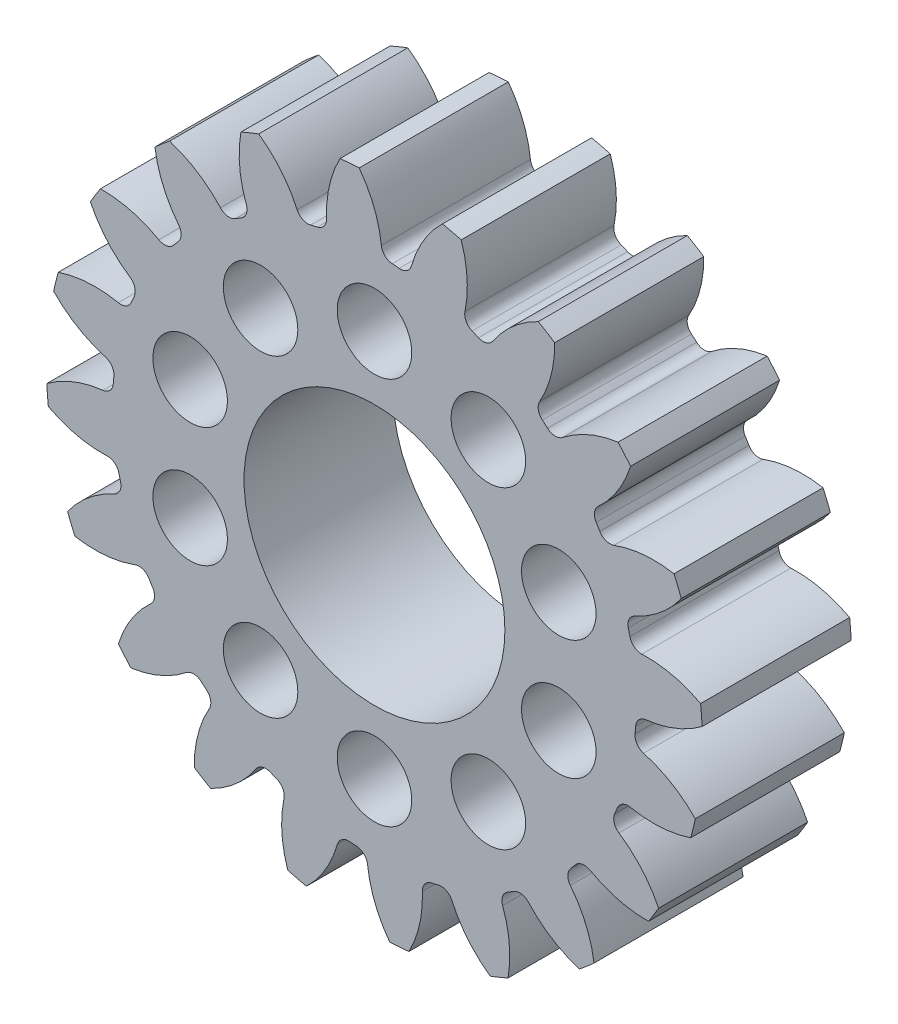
ISO-10303-21;
HEADER;
FILE_DESCRIPTION(('STEP AP214'),'2;1');
FILE_NAME('part.step','',(''),(''),'','','');
FILE_SCHEMA(('AUTOMOTIVE_DESIGN { 1 0 10303 214 1 1 1 1 }'));
ENDSEC;
DATA;
#1=APPLICATION_CONTEXT('core data for automotive mechanical design processes');
#2=APPLICATION_PROTOCOL_DEFINITION('international standard','automotive_design',2000,#1);
#3=PRODUCT_CONTEXT('',#1,'mechanical');
#4=PRODUCT('Part','Part','',(#3));
#5=PRODUCT_RELATED_PRODUCT_CATEGORY('part','',(#4));
#6=PRODUCT_DEFINITION_FORMATION('','',#4);
#7=PRODUCT_DEFINITION_CONTEXT('part definition',#1,'design');
#8=PRODUCT_DEFINITION('design','',#6,#7);
#9=PRODUCT_DEFINITION_SHAPE('','',#8);
#10=(LENGTH_UNIT() NAMED_UNIT(*) SI_UNIT(.MILLI.,.METRE.));
#11=(NAMED_UNIT(*) PLANE_ANGLE_UNIT() SI_UNIT($,.RADIAN.));
#12=(NAMED_UNIT(*) SI_UNIT($,.STERADIAN.) SOLID_ANGLE_UNIT());
#13=UNCERTAINTY_MEASURE_WITH_UNIT(LENGTH_MEASURE(1.E-05),#10,'distance_accuracy_value','');
#14=(GEOMETRIC_REPRESENTATION_CONTEXT(3) GLOBAL_UNCERTAINTY_ASSIGNED_CONTEXT((#13)) GLOBAL_UNIT_ASSIGNED_CONTEXT((#10,
#11,#12)) REPRESENTATION_CONTEXT('',''));
#15=CARTESIAN_POINT('',(0.,0.,0.));
#16=DIRECTION('',(0.,0.,1.));
#17=DIRECTION('',(1.,0.,0.));
#18=AXIS2_PLACEMENT_3D('',#15,#16,#17);
#19=CARTESIAN_POINT('',(0.,0.,12.7));
#20=DIRECTION('',(0.,0.,-1.));
#21=DIRECTION('',(-1.,0.,0.));
#22=AXIS2_PLACEMENT_3D('',#19,#20,#21);
#23=CYLINDRICAL_SURFACE('',#22,27.94);
#24=DIRECTION('',(0.,0.,-1.));
#25=VECTOR('',#24,1.);
#26=CARTESIAN_POINT('',(24.2037207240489,-13.957919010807,6.35));
#27=LINE('',#26,#25);
#28=CARTESIAN_POINT('',(24.2037207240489,-13.957919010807,12.7));
#29=VERTEX_POINT('',#28);
#30=CARTESIAN_POINT('',(24.2037207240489,-13.957919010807,0.));
#31=VERTEX_POINT('',#30);
#32=EDGE_CURVE('E1463',#29,#31,#27,.T.);
#33=ORIENTED_EDGE('',*,*,#32,.F.);
#34=CARTESIAN_POINT('',(0.,0.,12.7));
#35=DIRECTION('',(0.,0.,1.));
#36=DIRECTION('',(1.,0.,0.));
#37=AXIS2_PLACEMENT_3D('',#34,#35,#36);
#38=CIRCLE('',#37,27.94);
#39=CARTESIAN_POINT('',(23.3435396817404,-15.3532652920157,12.7));
#40=VERTEX_POINT('',#39);
#41=EDGE_CURVE('E1563',#40,#29,#38,.T.);
#42=ORIENTED_EDGE('',*,*,#41,.F.);
#43=DIRECTION('',(0.,0.,-1.));
#44=VECTOR('',#43,1.);
#45=CARTESIAN_POINT('',(23.3435396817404,-15.3532652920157,6.35));
#46=LINE('',#45,#44);
#47=CARTESIAN_POINT('',(23.3435396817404,-15.3532652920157,0.));
#48=VERTEX_POINT('',#47);
#49=EDGE_CURVE('E1459',#48,#40,#46,.F.);
#50=ORIENTED_EDGE('',*,*,#49,.F.);
#51=CARTESIAN_POINT('',(0.,0.,0.));
#52=DIRECTION('',(0.,0.,1.));
#53=DIRECTION('',(1.,0.,0.));
#54=AXIS2_PLACEMENT_3D('',#51,#52,#53);
#55=CIRCLE('',#54,27.94);
#56=EDGE_CURVE('E1562',#48,#31,#55,.T.);
#57=ORIENTED_EDGE('',*,*,#56,.T.);
#58=EDGE_LOOP('',(#33,#42,#50,#57));
#59=FACE_BOUND('',#58,.T.);
#60=ADVANCED_FACE('F34',(#59),#23,.T.);
#61=DIRECTION('',(0.,0.,-1.));
#62=VECTOR('',#61,1.);
#63=CARTESIAN_POINT('',(26.9454454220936,-7.38827253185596,6.35));
#64=LINE('',#63,#62);
#65=CARTESIAN_POINT('',(26.9454454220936,-7.38827253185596,0.));
#66=VERTEX_POINT('',#65);
#67=CARTESIAN_POINT('',(26.9454454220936,-7.38827253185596,12.7));
#68=VERTEX_POINT('',#67);
#69=EDGE_CURVE('E1461',#66,#68,#64,.F.);
#70=ORIENTED_EDGE('',*,*,#69,.F.);
#71=CARTESIAN_POINT('',(27.3323404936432,-5.7954087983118,0.));
#72=VERTEX_POINT('',#71);
#73=EDGE_CURVE('E1503',#66,#72,#55,.T.);
#74=ORIENTED_EDGE('',*,*,#73,.T.);
#75=DIRECTION('',(0.,0.,-1.));
#76=VECTOR('',#75,1.);
#77=CARTESIAN_POINT('',(27.3323404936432,-5.7954087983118,6.35));
#78=LINE('',#77,#76);
#79=CARTESIAN_POINT('',(27.3323404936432,-5.7954087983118,12.7));
#80=VERTEX_POINT('',#79);
#81=EDGE_CURVE('E1500',#80,#72,#78,.T.);
#82=ORIENTED_EDGE('',*,*,#81,.F.);
#83=EDGE_CURVE('E1509',#68,#80,#38,.T.);
#84=ORIENTED_EDGE('',*,*,#83,.F.);
#85=EDGE_LOOP('',(#70,#74,#82,#84));
#86=FACE_BOUND('',#85,.T.);
#87=ADVANCED_FACE('F1573',(#86),#23,.T.);
#88=DIRECTION('',(0.,0.,-1.));
#89=VECTOR('',#88,1.);
#90=CARTESIAN_POINT('',(18.7058721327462,-20.7541308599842,6.35));
#91=LINE('',#90,#89);
#92=CARTESIAN_POINT('',(18.7058721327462,-20.7541308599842,12.7));
#93=VERTEX_POINT('',#92);
#94=CARTESIAN_POINT('',(18.7058721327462,-20.7541308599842,0.));
#95=VERTEX_POINT('',#94);
#96=EDGE_CURVE('E1457',#93,#95,#91,.T.);
#97=ORIENTED_EDGE('',*,*,#96,.F.);
#98=CARTESIAN_POINT('',(17.4566056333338,-21.8153734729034,12.7));
#99=VERTEX_POINT('',#98);
#100=EDGE_CURVE('E1589',#99,#93,#38,.T.);
#101=ORIENTED_EDGE('',*,*,#100,.F.);
#102=DIRECTION('',(0.,0.,-1.));
#103=VECTOR('',#102,1.);
#104=CARTESIAN_POINT('',(17.4566056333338,-21.8153734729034,6.35));
#105=LINE('',#104,#103);
#106=CARTESIAN_POINT('',(17.4566056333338,-21.8153734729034,0.));
#107=VERTEX_POINT('',#106);
#108=EDGE_CURVE('E1455',#107,#99,#105,.F.);
#109=ORIENTED_EDGE('',*,*,#108,.F.);
#110=EDGE_CURVE('E1566',#107,#95,#55,.T.);
#111=ORIENTED_EDGE('',*,*,#110,.T.);
#112=EDGE_LOOP('',(#97,#101,#109,#111));
#113=FACE_BOUND('',#112,.T.);
#114=ADVANCED_FACE('F2108',(#113),#23,.T.);
#115=DIRECTION('',(0.,0.,-1.));
#116=VECTOR('',#115,1.);
#117=CARTESIAN_POINT('',(11.3769624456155,-25.5187837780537,6.35));
#118=LINE('',#117,#116);
#119=CARTESIAN_POINT('',(11.3769624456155,-25.5187837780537,12.7));
#120=VERTEX_POINT('',#119);
#121=CARTESIAN_POINT('',(11.3769624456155,-25.5187837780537,0.));
#122=VERTEX_POINT('',#121);
#123=EDGE_CURVE('E1453',#120,#122,#118,.T.);
#124=ORIENTED_EDGE('',*,*,#123,.F.);
#125=CARTESIAN_POINT('',(9.86089739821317,-26.1420409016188,12.7));
#126=VERTEX_POINT('',#125);
#127=EDGE_CURVE('E1592',#126,#120,#38,.T.);
#128=ORIENTED_EDGE('',*,*,#127,.F.);
#129=DIRECTION('',(0.,0.,-1.));
#130=VECTOR('',#129,1.);
#131=CARTESIAN_POINT('',(9.86089739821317,-26.1420409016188,6.35));
#132=LINE('',#131,#130);
#133=CARTESIAN_POINT('',(9.86089739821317,-26.1420409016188,0.));
#134=VERTEX_POINT('',#133);
#135=EDGE_CURVE('E1451',#134,#126,#132,.F.);
#136=ORIENTED_EDGE('',*,*,#135,.F.);
#137=EDGE_CURVE('E1568',#134,#122,#55,.T.);
#138=ORIENTED_EDGE('',*,*,#137,.T.);
#139=EDGE_LOOP('',(#124,#128,#136,#138));
#140=FACE_BOUND('',#139,.T.);
#141=ADVANCED_FACE('F2083',(#140),#23,.T.);
#142=DIRECTION('',(0.,0.,-1.));
#143=VECTOR('',#142,1.);
#144=CARTESIAN_POINT('',(2.93439640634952,-27.7854803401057,6.35));
#145=LINE('',#144,#143);
#146=CARTESIAN_POINT('',(2.93439640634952,-27.7854803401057,12.7));
#147=VERTEX_POINT('',#146);
#148=CARTESIAN_POINT('',(2.93439640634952,-27.7854803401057,0.));
#149=VERTEX_POINT('',#148);
#150=EDGE_CURVE('E1449',#147,#149,#145,.T.);
#151=ORIENTED_EDGE('',*,*,#150,.F.);
#152=CARTESIAN_POINT('',(1.29993582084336,-27.9097432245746,12.7));
#153=VERTEX_POINT('',#152);
#154=EDGE_CURVE('E1597',#153,#147,#38,.T.);
#155=ORIENTED_EDGE('',*,*,#154,.F.);
#156=DIRECTION('',(0.,0.,-1.));
#157=VECTOR('',#156,1.);
#158=CARTESIAN_POINT('',(1.29993582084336,-27.9097432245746,6.35));
#159=LINE('',#158,#157);
#160=CARTESIAN_POINT('',(1.29993582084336,-27.9097432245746,0.));
#161=VERTEX_POINT('',#160);
#162=EDGE_CURVE('E1447',#161,#153,#159,.F.);
#163=ORIENTED_EDGE('',*,*,#162,.F.);
#164=EDGE_CURVE('E2051',#161,#149,#55,.T.);
#165=ORIENTED_EDGE('',*,*,#164,.T.);
#166=EDGE_LOOP('',(#151,#155,#163,#165));
#167=FACE_BOUND('',#166,.T.);
#168=ADVANCED_FACE('F2057',(#167),#23,.T.);
#169=DIRECTION('',(0.,0.,-1.));
#170=VECTOR('',#169,1.);
#171=CARTESIAN_POINT('',(-5.7954087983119,-27.3323404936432,6.35));
#172=LINE('',#171,#170);
#173=CARTESIAN_POINT('',(-5.7954087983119,-27.3323404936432,12.7));
#174=VERTEX_POINT('',#173);
#175=CARTESIAN_POINT('',(-5.7954087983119,-27.3323404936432,0.));
#176=VERTEX_POINT('',#175);
#177=EDGE_CURVE('E1445',#174,#176,#172,.T.);
#178=ORIENTED_EDGE('',*,*,#177,.F.);
#179=CARTESIAN_POINT('',(-7.38827253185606,-26.9454454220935,12.7));
#180=VERTEX_POINT('',#179);
#181=EDGE_CURVE('E1602',#180,#174,#38,.T.);
#182=ORIENTED_EDGE('',*,*,#181,.F.);
#183=DIRECTION('',(0.,0.,-1.));
#184=VECTOR('',#183,1.);
#185=CARTESIAN_POINT('',(-7.38827253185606,-26.9454454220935,6.35));
#186=LINE('',#185,#184);
#187=CARTESIAN_POINT('',(-7.38827253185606,-26.9454454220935,0.));
#188=VERTEX_POINT('',#187);
#189=EDGE_CURVE('E1443',#188,#180,#186,.F.);
#190=ORIENTED_EDGE('',*,*,#189,.F.);
#191=EDGE_CURVE('E2024',#188,#176,#55,.T.);
#192=ORIENTED_EDGE('',*,*,#191,.T.);
#193=EDGE_LOOP('',(#178,#182,#190,#192));
#194=FACE_BOUND('',#193,.T.);
#195=ADVANCED_FACE('F2030',(#194),#23,.T.);
#196=DIRECTION('',(0.,0.,-1.));
#197=VECTOR('',#196,1.);
#198=CARTESIAN_POINT('',(-13.9579190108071,-24.2037207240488,6.35));
#199=LINE('',#198,#197);
#200=CARTESIAN_POINT('',(-13.9579190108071,-24.2037207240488,12.7));
#201=VERTEX_POINT('',#200);
#202=CARTESIAN_POINT('',(-13.9579190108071,-24.2037207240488,0.));
#203=VERTEX_POINT('',#202);
#204=EDGE_CURVE('E1441',#201,#203,#199,.T.);
#205=ORIENTED_EDGE('',*,*,#204,.F.);
#206=CARTESIAN_POINT('',(-15.3532652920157,-23.3435396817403,12.7));
#207=VERTEX_POINT('',#206);
#208=EDGE_CURVE('E1607',#207,#201,#38,.T.);
#209=ORIENTED_EDGE('',*,*,#208,.F.);
#210=DIRECTION('',(0.,0.,-1.));
#211=VECTOR('',#210,1.);
#212=CARTESIAN_POINT('',(-15.3532652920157,-23.3435396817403,6.35));
#213=LINE('',#212,#211);
#214=CARTESIAN_POINT('',(-15.3532652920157,-23.3435396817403,0.));
#215=VERTEX_POINT('',#214);
#216=EDGE_CURVE('E1439',#215,#207,#213,.F.);
#217=ORIENTED_EDGE('',*,*,#216,.F.);
#218=EDGE_CURVE('E1997',#215,#203,#55,.T.);
#219=ORIENTED_EDGE('',*,*,#218,.T.);
#220=EDGE_LOOP('',(#205,#209,#217,#219));
#221=FACE_BOUND('',#220,.T.);
#222=ADVANCED_FACE('F2003',(#221),#23,.T.);
#223=DIRECTION('',(0.,0.,-1.));
#224=VECTOR('',#223,1.);
#225=CARTESIAN_POINT('',(-20.7541308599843,-18.7058721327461,6.35));
#226=LINE('',#225,#224);
#227=CARTESIAN_POINT('',(-20.7541308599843,-18.7058721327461,12.7));
#228=VERTEX_POINT('',#227);
#229=CARTESIAN_POINT('',(-20.7541308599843,-18.7058721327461,0.));
#230=VERTEX_POINT('',#229);
#231=EDGE_CURVE('E1437',#228,#230,#226,.T.);
#232=ORIENTED_EDGE('',*,*,#231,.F.);
#233=CARTESIAN_POINT('',(-21.8153734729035,-17.4566056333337,12.7));
#234=VERTEX_POINT('',#233);
#235=EDGE_CURVE('E1612',#234,#228,#38,.T.);
#236=ORIENTED_EDGE('',*,*,#235,.F.);
#237=DIRECTION('',(0.,0.,-1.));
#238=VECTOR('',#237,1.);
#239=CARTESIAN_POINT('',(-21.8153734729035,-17.4566056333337,6.35));
#240=LINE('',#239,#238);
#241=CARTESIAN_POINT('',(-21.8153734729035,-17.4566056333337,0.));
#242=VERTEX_POINT('',#241);
#243=EDGE_CURVE('E1435',#242,#234,#240,.F.);
#244=ORIENTED_EDGE('',*,*,#243,.F.);
#245=EDGE_CURVE('E1970',#242,#230,#55,.T.);
#246=ORIENTED_EDGE('',*,*,#245,.T.);
#247=EDGE_LOOP('',(#232,#236,#244,#246));
#248=FACE_BOUND('',#247,.T.);
#249=ADVANCED_FACE('F1976',(#248),#23,.T.);
#250=DIRECTION('',(0.,0.,-1.));
#251=VECTOR('',#250,1.);
#252=CARTESIAN_POINT('',(-25.5187837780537,-11.3769624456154,6.35));
#253=LINE('',#252,#251);
#254=CARTESIAN_POINT('',(-25.5187837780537,-11.3769624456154,12.7));
#255=VERTEX_POINT('',#254);
#256=CARTESIAN_POINT('',(-25.5187837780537,-11.3769624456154,0.));
#257=VERTEX_POINT('',#256);
#258=EDGE_CURVE('E1433',#255,#257,#253,.T.);
#259=ORIENTED_EDGE('',*,*,#258,.F.);
#260=CARTESIAN_POINT('',(-26.1420409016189,-9.86089739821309,12.7));
#261=VERTEX_POINT('',#260);
#262=EDGE_CURVE('E1617',#261,#255,#38,.T.);
#263=ORIENTED_EDGE('',*,*,#262,.F.);
#264=DIRECTION('',(0.,0.,-1.));
#265=VECTOR('',#264,1.);
#266=CARTESIAN_POINT('',(-26.1420409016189,-9.86089739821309,6.35));
#267=LINE('',#266,#265);
#268=CARTESIAN_POINT('',(-26.1420409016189,-9.86089739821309,0.));
#269=VERTEX_POINT('',#268);
#270=EDGE_CURVE('E1431',#269,#261,#267,.F.);
#271=ORIENTED_EDGE('',*,*,#270,.F.);
#272=EDGE_CURVE('E1943',#269,#257,#55,.T.);
#273=ORIENTED_EDGE('',*,*,#272,.T.);
#274=EDGE_LOOP('',(#259,#263,#271,#273));
#275=FACE_BOUND('',#274,.T.);
#276=ADVANCED_FACE('F1949',(#275),#23,.T.);
#277=DIRECTION('',(0.,0.,-1.));
#278=VECTOR('',#277,1.);
#279=CARTESIAN_POINT('',(-27.7854803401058,-2.93439640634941,6.35));
#280=LINE('',#279,#278);
#281=CARTESIAN_POINT('',(-27.7854803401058,-2.93439640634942,12.7));
#282=VERTEX_POINT('',#281);
#283=CARTESIAN_POINT('',(-27.7854803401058,-2.93439640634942,0.));
#284=VERTEX_POINT('',#283);
#285=EDGE_CURVE('E1429',#282,#284,#280,.T.);
#286=ORIENTED_EDGE('',*,*,#285,.F.);
#287=CARTESIAN_POINT('',(-27.9097432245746,-1.29993582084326,12.7));
#288=VERTEX_POINT('',#287);
#289=EDGE_CURVE('E1622',#288,#282,#38,.T.);
#290=ORIENTED_EDGE('',*,*,#289,.F.);
#291=DIRECTION('',(0.,0.,-1.));
#292=VECTOR('',#291,1.);
#293=CARTESIAN_POINT('',(-27.9097432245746,-1.29993582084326,6.35));
#294=LINE('',#293,#292);
#295=CARTESIAN_POINT('',(-27.9097432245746,-1.29993582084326,0.));
#296=VERTEX_POINT('',#295);
#297=EDGE_CURVE('E1427',#296,#288,#294,.F.);
#298=ORIENTED_EDGE('',*,*,#297,.F.);
#299=EDGE_CURVE('E1916',#296,#284,#55,.T.);
#300=ORIENTED_EDGE('',*,*,#299,.T.);
#301=EDGE_LOOP('',(#286,#290,#298,#300));
#302=FACE_BOUND('',#301,.T.);
#303=ADVANCED_FACE('F1922',(#302),#23,.T.);
#304=DIRECTION('',(0.,0.,-1.));
#305=VECTOR('',#304,1.);
#306=CARTESIAN_POINT('',(-27.3323404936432,5.79540879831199,6.35));
#307=LINE('',#306,#305);
#308=CARTESIAN_POINT('',(-27.3323404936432,5.795408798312,12.7));
#309=VERTEX_POINT('',#308);
#310=CARTESIAN_POINT('',(-27.3323404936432,5.795408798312,0.));
#311=VERTEX_POINT('',#310);
#312=EDGE_CURVE('E1425',#309,#311,#307,.T.);
#313=ORIENTED_EDGE('',*,*,#312,.F.);
#314=CARTESIAN_POINT('',(-26.9454454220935,7.38827253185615,12.7));
#315=VERTEX_POINT('',#314);
#316=EDGE_CURVE('E1627',#315,#309,#38,.T.);
#317=ORIENTED_EDGE('',*,*,#316,.F.);
#318=DIRECTION('',(0.,0.,-1.));
#319=VECTOR('',#318,1.);
#320=CARTESIAN_POINT('',(-26.9454454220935,7.38827253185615,6.35));
#321=LINE('',#320,#319);
#322=CARTESIAN_POINT('',(-26.9454454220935,7.38827253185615,0.));
#323=VERTEX_POINT('',#322);
#324=EDGE_CURVE('E1423',#323,#315,#321,.F.);
#325=ORIENTED_EDGE('',*,*,#324,.F.);
#326=EDGE_CURVE('E1889',#323,#311,#55,.T.);
#327=ORIENTED_EDGE('',*,*,#326,.T.);
#328=EDGE_LOOP('',(#313,#317,#325,#327));
#329=FACE_BOUND('',#328,.T.);
#330=ADVANCED_FACE('F1895',(#329),#23,.T.);
#331=DIRECTION('',(0.,0.,-1.));
#332=VECTOR('',#331,1.);
#333=CARTESIAN_POINT('',(-24.2037207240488,13.9579190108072,6.35));
#334=LINE('',#333,#332);
#335=CARTESIAN_POINT('',(-24.2037207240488,13.9579190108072,12.7));
#336=VERTEX_POINT('',#335);
#337=CARTESIAN_POINT('',(-24.2037207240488,13.9579190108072,0.));
#338=VERTEX_POINT('',#337);
#339=EDGE_CURVE('E1421',#336,#338,#334,.T.);
#340=ORIENTED_EDGE('',*,*,#339,.F.);
#341=CARTESIAN_POINT('',(-23.3435396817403,15.3532652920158,12.7));
#342=VERTEX_POINT('',#341);
#343=EDGE_CURVE('E1632',#342,#336,#38,.T.);
#344=ORIENTED_EDGE('',*,*,#343,.F.);
#345=DIRECTION('',(0.,0.,-1.));
#346=VECTOR('',#345,1.);
#347=CARTESIAN_POINT('',(-23.3435396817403,15.3532652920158,6.35));
#348=LINE('',#347,#346);
#349=CARTESIAN_POINT('',(-23.3435396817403,15.3532652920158,0.));
#350=VERTEX_POINT('',#349);
#351=EDGE_CURVE('E1419',#350,#342,#348,.F.);
#352=ORIENTED_EDGE('',*,*,#351,.F.);
#353=EDGE_CURVE('E1862',#350,#338,#55,.T.);
#354=ORIENTED_EDGE('',*,*,#353,.T.);
#355=EDGE_LOOP('',(#340,#344,#352,#354));
#356=FACE_BOUND('',#355,.T.);
#357=ADVANCED_FACE('F1868',(#356),#23,.T.);
#358=DIRECTION('',(0.,0.,-1.));
#359=VECTOR('',#358,1.);
#360=CARTESIAN_POINT('',(-18.705872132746,20.7541308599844,6.35));
#361=LINE('',#360,#359);
#362=CARTESIAN_POINT('',(-18.705872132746,20.7541308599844,12.7));
#363=VERTEX_POINT('',#362);
#364=CARTESIAN_POINT('',(-18.705872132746,20.7541308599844,0.));
#365=VERTEX_POINT('',#364);
#366=EDGE_CURVE('E1417',#363,#365,#361,.T.);
#367=ORIENTED_EDGE('',*,*,#366,.F.);
#368=CARTESIAN_POINT('',(-17.4566056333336,21.8153734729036,12.7));
#369=VERTEX_POINT('',#368);
#370=EDGE_CURVE('E1637',#369,#363,#38,.T.);
#371=ORIENTED_EDGE('',*,*,#370,.F.);
#372=DIRECTION('',(0.,0.,-1.));
#373=VECTOR('',#372,1.);
#374=CARTESIAN_POINT('',(-17.4566056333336,21.8153734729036,6.35));
#375=LINE('',#374,#373);
#376=CARTESIAN_POINT('',(-17.4566056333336,21.8153734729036,0.));
#377=VERTEX_POINT('',#376);
#378=EDGE_CURVE('E1415',#377,#369,#375,.F.);
#379=ORIENTED_EDGE('',*,*,#378,.F.);
#380=EDGE_CURVE('E1835',#377,#365,#55,.T.);
#381=ORIENTED_EDGE('',*,*,#380,.T.);
#382=EDGE_LOOP('',(#367,#371,#379,#381));
#383=FACE_BOUND('',#382,.T.);
#384=ADVANCED_FACE('F1841',(#383),#23,.T.);
#385=DIRECTION('',(0.,0.,-1.));
#386=VECTOR('',#385,1.);
#387=CARTESIAN_POINT('',(-11.3769624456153,25.5187837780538,6.35));
#388=LINE('',#387,#386);
#389=CARTESIAN_POINT('',(-11.3769624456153,25.5187837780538,12.7));
#390=VERTEX_POINT('',#389);
#391=CARTESIAN_POINT('',(-11.3769624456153,25.5187837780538,0.));
#392=VERTEX_POINT('',#391);
#393=EDGE_CURVE('E1413',#390,#392,#388,.T.);
#394=ORIENTED_EDGE('',*,*,#393,.F.);
#395=CARTESIAN_POINT('',(-9.86089739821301,26.1420409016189,12.7));
#396=VERTEX_POINT('',#395);
#397=EDGE_CURVE('E1642',#396,#390,#38,.T.);
#398=ORIENTED_EDGE('',*,*,#397,.F.);
#399=DIRECTION('',(0.,0.,-1.));
#400=VECTOR('',#399,1.);
#401=CARTESIAN_POINT('',(-9.86089739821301,26.1420409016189,6.35));
#402=LINE('',#401,#400);
#403=CARTESIAN_POINT('',(-9.86089739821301,26.1420409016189,0.));
#404=VERTEX_POINT('',#403);
#405=EDGE_CURVE('E1411',#404,#396,#402,.F.);
#406=ORIENTED_EDGE('',*,*,#405,.F.);
#407=EDGE_CURVE('E1808',#404,#392,#55,.T.);
#408=ORIENTED_EDGE('',*,*,#407,.T.);
#409=EDGE_LOOP('',(#394,#398,#406,#408));
#410=FACE_BOUND('',#409,.T.);
#411=ADVANCED_FACE('F1814',(#410),#23,.T.);
#412=DIRECTION('',(0.,0.,-1.));
#413=VECTOR('',#412,1.);
#414=CARTESIAN_POINT('',(-2.93439640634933,27.7854803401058,6.35));
#415=LINE('',#414,#413);
#416=CARTESIAN_POINT('',(-2.93439640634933,27.7854803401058,12.7));
#417=VERTEX_POINT('',#416);
#418=CARTESIAN_POINT('',(-2.93439640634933,27.7854803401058,0.));
#419=VERTEX_POINT('',#418);
#420=EDGE_CURVE('E1409',#417,#419,#415,.T.);
#421=ORIENTED_EDGE('',*,*,#420,.F.);
#422=CARTESIAN_POINT('',(-1.29993582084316,27.9097432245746,12.7));
#423=VERTEX_POINT('',#422);
#424=EDGE_CURVE('E1647',#423,#417,#38,.T.);
#425=ORIENTED_EDGE('',*,*,#424,.F.);
#426=DIRECTION('',(0.,0.,-1.));
#427=VECTOR('',#426,1.);
#428=CARTESIAN_POINT('',(-1.29993582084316,27.9097432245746,6.35));
#429=LINE('',#428,#427);
#430=CARTESIAN_POINT('',(-1.29993582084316,27.9097432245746,0.));
#431=VERTEX_POINT('',#430);
#432=EDGE_CURVE('E1407',#431,#423,#429,.F.);
#433=ORIENTED_EDGE('',*,*,#432,.F.);
#434=EDGE_CURVE('E1781',#431,#419,#55,.T.);
#435=ORIENTED_EDGE('',*,*,#434,.T.);
#436=EDGE_LOOP('',(#421,#425,#433,#435));
#437=FACE_BOUND('',#436,.T.);
#438=ADVANCED_FACE('F1787',(#437),#23,.T.);
#439=DIRECTION('',(0.,0.,-1.));
#440=VECTOR('',#439,1.);
#441=CARTESIAN_POINT('',(5.79540879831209,27.3323404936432,6.35));
#442=LINE('',#441,#440);
#443=CARTESIAN_POINT('',(5.79540879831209,27.3323404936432,12.7));
#444=VERTEX_POINT('',#443);
#445=CARTESIAN_POINT('',(5.79540879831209,27.3323404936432,0.));
#446=VERTEX_POINT('',#445);
#447=EDGE_CURVE('E1405',#444,#446,#442,.T.);
#448=ORIENTED_EDGE('',*,*,#447,.F.);
#449=CARTESIAN_POINT('',(7.38827253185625,26.9454454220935,12.7));
#450=VERTEX_POINT('',#449);
#451=EDGE_CURVE('E1652',#450,#444,#38,.T.);
#452=ORIENTED_EDGE('',*,*,#451,.F.);
#453=DIRECTION('',(0.,0.,-1.));
#454=VECTOR('',#453,1.);
#455=CARTESIAN_POINT('',(7.38827253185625,26.9454454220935,6.35));
#456=LINE('',#455,#454);
#457=CARTESIAN_POINT('',(7.38827253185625,26.9454454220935,0.));
#458=VERTEX_POINT('',#457);
#459=EDGE_CURVE('E1403',#458,#450,#456,.F.);
#460=ORIENTED_EDGE('',*,*,#459,.F.);
#461=EDGE_CURVE('E1754',#458,#446,#55,.T.);
#462=ORIENTED_EDGE('',*,*,#461,.T.);
#463=EDGE_LOOP('',(#448,#452,#460,#462));
#464=FACE_BOUND('',#463,.T.);
#465=ADVANCED_FACE('F1760',(#464),#23,.T.);
#466=DIRECTION('',(0.,0.,-1.));
#467=VECTOR('',#466,1.);
#468=CARTESIAN_POINT('',(13.9579190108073,24.2037207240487,6.35));
#469=LINE('',#468,#467);
#470=CARTESIAN_POINT('',(13.9579190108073,24.2037207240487,12.7));
#471=VERTEX_POINT('',#470);
#472=CARTESIAN_POINT('',(13.9579190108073,24.2037207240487,0.));
#473=VERTEX_POINT('',#472);
#474=EDGE_CURVE('E1401',#471,#473,#469,.T.);
#475=ORIENTED_EDGE('',*,*,#474,.F.);
#476=CARTESIAN_POINT('',(15.3532652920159,23.3435396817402,12.7));
#477=VERTEX_POINT('',#476);
#478=EDGE_CURVE('E1657',#477,#471,#38,.T.);
#479=ORIENTED_EDGE('',*,*,#478,.F.);
#480=DIRECTION('',(0.,0.,-1.));
#481=VECTOR('',#480,1.);
#482=CARTESIAN_POINT('',(15.3532652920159,23.3435396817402,6.35));
#483=LINE('',#482,#481);
#484=CARTESIAN_POINT('',(15.3532652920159,23.3435396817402,0.));
#485=VERTEX_POINT('',#484);
#486=EDGE_CURVE('E1399',#485,#477,#483,.F.);
#487=ORIENTED_EDGE('',*,*,#486,.F.);
#488=EDGE_CURVE('E1727',#485,#473,#55,.T.);
#489=ORIENTED_EDGE('',*,*,#488,.T.);
#490=EDGE_LOOP('',(#475,#479,#487,#489));
#491=FACE_BOUND('',#490,.T.);
#492=ADVANCED_FACE('F1733',(#491),#23,.T.);
#493=DIRECTION('',(0.,0.,-1.));
#494=VECTOR('',#493,1.);
#495=CARTESIAN_POINT('',(20.7541308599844,18.705872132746,6.35));
#496=LINE('',#495,#494);
#497=CARTESIAN_POINT('',(20.7541308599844,18.705872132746,12.7));
#498=VERTEX_POINT('',#497);
#499=CARTESIAN_POINT('',(20.7541308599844,18.705872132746,0.));
#500=VERTEX_POINT('',#499);
#501=EDGE_CURVE('E1397',#498,#500,#496,.T.);
#502=ORIENTED_EDGE('',*,*,#501,.F.);
#503=CARTESIAN_POINT('',(21.8153734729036,17.4566056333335,12.7));
#504=VERTEX_POINT('',#503);
#505=EDGE_CURVE('E1662',#504,#498,#38,.T.);
#506=ORIENTED_EDGE('',*,*,#505,.F.);
#507=DIRECTION('',(0.,0.,-1.));
#508=VECTOR('',#507,1.);
#509=CARTESIAN_POINT('',(21.8153734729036,17.4566056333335,6.35));
#510=LINE('',#509,#508);
#511=CARTESIAN_POINT('',(21.8153734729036,17.4566056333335,0.));
#512=VERTEX_POINT('',#511);
#513=EDGE_CURVE('E1395',#512,#504,#510,.F.);
#514=ORIENTED_EDGE('',*,*,#513,.F.);
#515=EDGE_CURVE('E1700',#512,#500,#55,.T.);
#516=ORIENTED_EDGE('',*,*,#515,.T.);
#517=EDGE_LOOP('',(#502,#506,#514,#516));
#518=FACE_BOUND('',#517,.T.);
#519=ADVANCED_FACE('F1706',(#518),#23,.T.);
#520=DIRECTION('',(0.,0.,-1.));
#521=VECTOR('',#520,1.);
#522=CARTESIAN_POINT('',(25.5187837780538,11.3769624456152,6.35));
#523=LINE('',#522,#521);
#524=CARTESIAN_POINT('',(25.5187837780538,11.3769624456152,12.7));
#525=VERTEX_POINT('',#524);
#526=CARTESIAN_POINT('',(25.5187837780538,11.3769624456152,0.));
#527=VERTEX_POINT('',#526);
#528=EDGE_CURVE('E1393',#525,#527,#523,.T.);
#529=ORIENTED_EDGE('',*,*,#528,.F.);
#530=CARTESIAN_POINT('',(26.1420409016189,9.86089739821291,12.7));
#531=VERTEX_POINT('',#530);
#532=EDGE_CURVE('E1508',#531,#525,#38,.T.);
#533=ORIENTED_EDGE('',*,*,#532,.F.);
#534=DIRECTION('',(0.,0.,-1.));
#535=VECTOR('',#534,1.);
#536=CARTESIAN_POINT('',(26.1420409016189,9.86089739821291,6.35));
#537=LINE('',#536,#535);
#538=CARTESIAN_POINT('',(26.1420409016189,9.86089739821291,0.));
#539=VERTEX_POINT('',#538);
#540=EDGE_CURVE('E1391',#539,#531,#537,.F.);
#541=ORIENTED_EDGE('',*,*,#540,.F.);
#542=EDGE_CURVE('E1513',#539,#527,#55,.T.);
#543=ORIENTED_EDGE('',*,*,#542,.T.);
#544=EDGE_LOOP('',(#529,#533,#541,#543));
#545=FACE_BOUND('',#544,.T.);
#546=ADVANCED_FACE('F1677',(#545),#23,.T.);
#547=DIRECTION('',(0.,0.,-1.));
#548=VECTOR('',#547,1.);
#549=CARTESIAN_POINT('',(27.7854803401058,2.93439640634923,6.35));
#550=LINE('',#549,#548);
#551=CARTESIAN_POINT('',(27.7854803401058,2.93439640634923,12.7));
#552=VERTEX_POINT('',#551);
#553=CARTESIAN_POINT('',(27.7854803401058,2.93439640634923,0.));
#554=VERTEX_POINT('',#553);
#555=EDGE_CURVE('E1389',#552,#554,#550,.T.);
#556=ORIENTED_EDGE('',*,*,#555,.F.);
#557=CARTESIAN_POINT('',(27.9097432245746,1.29993582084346,12.7));
#558=VERTEX_POINT('',#557);
#559=EDGE_CURVE('E1504',#558,#552,#38,.T.);
#560=ORIENTED_EDGE('',*,*,#559,.F.);
#561=DIRECTION('',(0.,0.,-1.));
#562=VECTOR('',#561,1.);
#563=CARTESIAN_POINT('',(27.9097432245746,1.29993582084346,6.35));
#564=LINE('',#563,#562);
#565=CARTESIAN_POINT('',(27.9097432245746,1.29993582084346,0.));
#566=VERTEX_POINT('',#565);
#567=EDGE_CURVE('E1498',#566,#558,#564,.F.);
#568=ORIENTED_EDGE('',*,*,#567,.F.);
#569=EDGE_CURVE('E1510',#566,#554,#55,.T.);
#570=ORIENTED_EDGE('',*,*,#569,.T.);
#571=EDGE_LOOP('',(#556,#560,#568,#570));
#572=FACE_BOUND('',#571,.T.);
#573=ADVANCED_FACE('F2132',(#572),#23,.T.);
#574=CARTESIAN_POINT('',(0.,0.,12.7));
#575=DIRECTION('',(0.,0.,1.));
#576=DIRECTION('',(1.,0.,0.));
#577=AXIS2_PLACEMENT_3D('',#574,#575,#576);
#578=PLANE('',#577);
#579=CARTESIAN_POINT('',(9.70433451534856,-13.3568705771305,12.7));
#580=DIRECTION('',(0.,0.,1.));
#581=DIRECTION('',(1.,0.,0.));
#582=AXIS2_PLACEMENT_3D('',#579,#580,#581);
#583=CIRCLE('',#582,3.175);
#584=CARTESIAN_POINT('',(12.8793345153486,-13.3568705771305,12.7));
#585=VERTEX_POINT('',#584);
#586=EDGE_CURVE('E2551',#585,#585,#583,.T.);
#587=ORIENTED_EDGE('',*,*,#586,.F.);
#588=EDGE_LOOP('',(#587));
#589=FACE_BOUND('',#588,.T.);
#590=CARTESIAN_POINT('',(15.7019430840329,-5.10187057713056,12.7));
#591=DIRECTION('',(0.,0.,1.));
#592=DIRECTION('',(1.,0.,0.));
#593=AXIS2_PLACEMENT_3D('',#590,#591,#592);
#594=CIRCLE('',#593,3.175);
#595=CARTESIAN_POINT('',(18.8769430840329,-5.10187057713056,12.7));
#596=VERTEX_POINT('',#595);
#597=EDGE_CURVE('E2553',#596,#596,#594,.T.);
#598=ORIENTED_EDGE('',*,*,#597,.F.);
#599=EDGE_LOOP('',(#598));
#600=FACE_BOUND('',#599,.T.);
#601=CARTESIAN_POINT('',(15.701943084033,5.10187057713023,12.7));
#602=DIRECTION('',(0.,0.,1.));
#603=DIRECTION('',(1.,0.,0.));
#604=AXIS2_PLACEMENT_3D('',#601,#602,#603);
#605=CIRCLE('',#604,3.175);
#606=CARTESIAN_POINT('',(18.876943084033,5.10187057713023,12.7));
#607=VERTEX_POINT('',#606);
#608=EDGE_CURVE('E2559',#607,#607,#605,.T.);
#609=ORIENTED_EDGE('',*,*,#608,.F.);
#610=EDGE_LOOP('',(#609));
#611=FACE_BOUND('',#610,.T.);
#612=CARTESIAN_POINT('',(9.70433451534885,13.3568705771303,12.7));
#613=DIRECTION('',(0.,0.,1.));
#614=DIRECTION('',(1.,0.,0.));
#615=AXIS2_PLACEMENT_3D('',#612,#613,#614);
#616=CIRCLE('',#615,3.175);
#617=CARTESIAN_POINT('',(12.8793345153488,13.3568705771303,12.7));
#618=VERTEX_POINT('',#617);
#619=EDGE_CURVE('E2565',#618,#618,#616,.T.);
#620=ORIENTED_EDGE('',*,*,#619,.F.);
#621=EDGE_LOOP('',(#620));
#622=FACE_BOUND('',#621,.T.);
#623=CARTESIAN_POINT('',(1.13266821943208E-13,16.51,12.7));
#624=DIRECTION('',(0.,0.,1.));
#625=DIRECTION('',(1.,0.,0.));
#626=AXIS2_PLACEMENT_3D('',#623,#624,#625);
#627=CIRCLE('',#626,3.175);
#628=CARTESIAN_POINT('',(3.17500000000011,16.51,12.7));
#629=VERTEX_POINT('',#628);
#630=EDGE_CURVE('E2571',#629,#629,#627,.T.);
#631=ORIENTED_EDGE('',*,*,#630,.F.);
#632=EDGE_LOOP('',(#631));
#633=FACE_BOUND('',#632,.T.);
#634=CARTESIAN_POINT('',(-9.70433451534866,13.3568705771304,12.7));
#635=DIRECTION('',(0.,0.,1.));
#636=DIRECTION('',(1.,0.,0.));
#637=AXIS2_PLACEMENT_3D('',#634,#635,#636);
#638=CIRCLE('',#637,3.175);
#639=CARTESIAN_POINT('',(-6.52933451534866,13.3568705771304,12.7));
#640=VERTEX_POINT('',#639);
#641=EDGE_CURVE('E2577',#640,#640,#638,.T.);
#642=ORIENTED_EDGE('',*,*,#641,.F.);
#643=EDGE_LOOP('',(#642));
#644=FACE_BOUND('',#643,.T.);
#645=CARTESIAN_POINT('',(-15.701943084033,5.10187057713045,12.7));
#646=DIRECTION('',(0.,0.,1.));
#647=DIRECTION('',(1.,0.,0.));
#648=AXIS2_PLACEMENT_3D('',#645,#646,#647);
#649=CIRCLE('',#648,3.175);
#650=CARTESIAN_POINT('',(-12.526943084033,5.10187057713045,12.7));
#651=VERTEX_POINT('',#650);
#652=EDGE_CURVE('E2583',#651,#651,#649,.T.);
#653=ORIENTED_EDGE('',*,*,#652,.F.);
#654=EDGE_LOOP('',(#653));
#655=FACE_BOUND('',#654,.T.);
#656=CARTESIAN_POINT('',(-15.701943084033,-5.10187057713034,12.7));
#657=DIRECTION('',(0.,0.,1.));
#658=DIRECTION('',(1.,0.,0.));
#659=AXIS2_PLACEMENT_3D('',#656,#657,#658);
#660=CIRCLE('',#659,3.175);
#661=CARTESIAN_POINT('',(-12.526943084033,-5.10187057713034,12.7));
#662=VERTEX_POINT('',#661);
#663=EDGE_CURVE('E2589',#662,#662,#660,.T.);
#664=ORIENTED_EDGE('',*,*,#663,.F.);
#665=EDGE_LOOP('',(#664));
#666=FACE_BOUND('',#665,.T.);
#667=CARTESIAN_POINT('',(-9.70433451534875,-13.3568705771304,12.7));
#668=DIRECTION('',(0.,0.,1.));
#669=DIRECTION('',(1.,0.,0.));
#670=AXIS2_PLACEMENT_3D('',#667,#668,#669);
#671=CIRCLE('',#670,3.175);
#672=CARTESIAN_POINT('',(-6.52933451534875,-13.3568705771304,12.7));
#673=VERTEX_POINT('',#672);
#674=EDGE_CURVE('E2595',#673,#673,#671,.T.);
#675=ORIENTED_EDGE('',*,*,#674,.F.);
#676=EDGE_LOOP('',(#675));
#677=FACE_BOUND('',#676,.T.);
#678=CARTESIAN_POINT('',(0.,-16.51,12.7));
#679=DIRECTION('',(0.,0.,1.));
#680=DIRECTION('',(1.,0.,0.));
#681=AXIS2_PLACEMENT_3D('',#678,#679,#680);
#682=CIRCLE('',#681,3.175);
#683=CARTESIAN_POINT('',(3.175,-16.51,12.7));
#684=VERTEX_POINT('',#683);
#685=EDGE_CURVE('E2601',#684,#684,#682,.T.);
#686=ORIENTED_EDGE('',*,*,#685,.F.);
#687=EDGE_LOOP('',(#686));
#688=FACE_BOUND('',#687,.T.);
#689=CARTESIAN_POINT('',(0.,0.,12.7000000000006));
#690=DIRECTION('',(0.,0.,1.));
#691=DIRECTION('',(1.,0.,0.));
#692=AXIS2_PLACEMENT_3D('',#689,#690,#691);
#693=CIRCLE('',#692,11.1125);
#694=CARTESIAN_POINT('',(11.1125,0.,12.7000000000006));
#695=VERTEX_POINT('',#694);
#696=EDGE_CURVE('E810',#695,#695,#693,.T.);
#697=ORIENTED_EDGE('',*,*,#696,.F.);
#698=EDGE_LOOP('',(#697));
#699=FACE_BOUND('',#698,.T.);
#700=ORIENTED_EDGE('',*,*,#41,.T.);
#701=CARTESIAN_POINT('',(15.4044153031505,-18.2316923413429,12.7));
#702=DIRECTION('',(0.,0.,-1.));
#703=DIRECTION('',(0.951056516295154,-0.309016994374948,0.));
#704=AXIS2_PLACEMENT_3D('',#701,#702,#703);
#705=CIRCLE('',#704,9.78227552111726);
#706=CARTESIAN_POINT('',(20.8272149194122,-10.0900611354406,12.7));
#707=VERTEX_POINT('',#706);
#708=EDGE_CURVE('E1368',#707,#29,#705,.T.);
#709=ORIENTED_EDGE('',*,*,#708,.F.);
#710=CARTESIAN_POINT('',(21.3805776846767,-9.25925862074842,12.7));
#711=DIRECTION('',(0.,0.,1.));
#712=DIRECTION('',(-0.951056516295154,0.309016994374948,0.));
#713=AXIS2_PLACEMENT_3D('',#710,#711,#712);
#714=CIRCLE('',#713,0.998220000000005);
#715=CARTESIAN_POINT('',(20.4645668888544,-8.8625630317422,12.7));
#716=VERTEX_POINT('',#715);
#717=EDGE_CURVE('E1366',#716,#707,#714,.T.);
#718=ORIENTED_EDGE('',*,*,#717,.F.);
#719=CARTESIAN_POINT('',(0.,0.,12.7));
#720=DIRECTION('',(0.,0.,-1.));
#721=DIRECTION('',(0.951056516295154,-0.309016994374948,0.));
#722=AXIS2_PLACEMENT_3D('',#719,#720,#721);
#723=CIRCLE('',#722,22.3012);
#724=CARTESIAN_POINT('',(20.6934922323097,-8.31401832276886,12.7));
#725=VERTEX_POINT('',#724);
#726=EDGE_CURVE('E1363',#725,#716,#723,.T.);
#727=ORIENTED_EDGE('',*,*,#726,.F.);
#728=CARTESIAN_POINT('',(21.6197499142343,-8.68616060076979,12.7));
#729=DIRECTION('',(0.,0.,1.));
#730=DIRECTION('',(-0.951056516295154,0.309016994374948,0.));
#731=AXIS2_PLACEMENT_3D('',#728,#729,#730);
#732=CIRCLE('',#731,0.998220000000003);
#733=CARTESIAN_POINT('',(21.8211315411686,-7.70846504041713,12.7));
#734=VERTEX_POINT('',#733);
#735=EDGE_CURVE('E1361',#734,#725,#732,.T.);
#736=ORIENTED_EDGE('',*,*,#735,.F.);
#737=CARTESIAN_POINT('',(23.7946149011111,1.87267673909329,12.7));
#738=DIRECTION('',(0.,0.,-1.));
#739=DIRECTION('',(-0.951056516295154,0.309016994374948,0.));
#740=AXIS2_PLACEMENT_3D('',#737,#738,#739);
#741=CIRCLE('',#740,9.78227552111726);
#742=EDGE_CURVE('E1370',#68,#734,#741,.T.);
#743=ORIENTED_EDGE('',*,*,#742,.F.);
#744=ORIENTED_EDGE('',*,*,#83,.T.);
#745=CARTESIAN_POINT('',(20.2843723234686,-12.5791436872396,12.7));
#746=DIRECTION('',(0.,0.,-1.));
#747=DIRECTION('',(1.,0.,0.));
#748=AXIS2_PLACEMENT_3D('',#745,#746,#747);
#749=CIRCLE('',#748,9.78227552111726);
#750=CARTESIAN_POINT('',(22.92585883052,-3.16025503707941,12.7));
#751=VERTEX_POINT('',#750);
#752=EDGE_CURVE('E1473',#751,#80,#749,.T.);
#753=ORIENTED_EDGE('',*,*,#752,.F.);
#754=CARTESIAN_POINT('',(23.1954059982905,-2.19911639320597,12.7));
#755=DIRECTION('',(0.,0.,1.));
#756=DIRECTION('',(-1.,0.,0.));
#757=AXIS2_PLACEMENT_3D('',#754,#755,#756);
#758=CIRCLE('',#757,0.998220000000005);
#759=CARTESIAN_POINT('',(22.2016422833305,-2.10489937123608,12.7));
#760=VERTEX_POINT('',#759);
#761=EDGE_CURVE('E1471',#760,#751,#758,.T.);
#762=ORIENTED_EDGE('',*,*,#761,.F.);
#763=CARTESIAN_POINT('',(0.,0.,12.7));
#764=DIRECTION('',(0.,0.,-1.));
#765=DIRECTION('',(1.,0.,0.));
#766=AXIS2_PLACEMENT_3D('',#763,#764,#765);
#767=CIRCLE('',#766,22.3012);
#768=CARTESIAN_POINT('',(22.2498535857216,-1.51246052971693,12.7));
#769=VERTEX_POINT('',#768);
#770=EDGE_CURVE('E1468',#769,#760,#767,.T.);
#771=ORIENTED_EDGE('',*,*,#770,.F.);
#772=CARTESIAN_POINT('',(23.2457752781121,-1.5801595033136,12.7));
#773=DIRECTION('',(0.,0.,1.));
#774=DIRECTION('',(-1.,0.,0.));
#775=AXIS2_PLACEMENT_3D('',#772,#773,#774);
#776=CIRCLE('',#775,0.998220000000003);
#777=CARTESIAN_POINT('',(23.1351760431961,-0.588085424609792,12.7));
#778=VERTEX_POINT('',#777);
#779=EDGE_CURVE('E1466',#778,#769,#776,.T.);
#780=ORIENTED_EDGE('',*,*,#779,.F.);
#781=CARTESIAN_POINT('',(22.051334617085,9.13396179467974,12.7));
#782=DIRECTION('',(0.,0.,-1.));
#783=DIRECTION('',(-1.,0.,0.));
#784=AXIS2_PLACEMENT_3D('',#781,#782,#783);
#785=CIRCLE('',#784,9.78227552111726);
#786=EDGE_CURVE('E1476',#558,#778,#785,.T.);
#787=ORIENTED_EDGE('',*,*,#786,.F.);
#788=ORIENTED_EDGE('',*,*,#559,.T.);
#789=CARTESIAN_POINT('',(23.1787536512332,-5.69526080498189,12.7));
#790=DIRECTION('',(0.,0.,-1.));
#791=DIRECTION('',(0.951056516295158,0.309016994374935,0.));
#792=AXIS2_PLACEMENT_3D('',#789,#790,#791);
#793=CIRCLE('',#792,9.78227552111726);
#794=CARTESIAN_POINT('',(22.7803599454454,4.07889884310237,12.7));
#795=VERTEX_POINT('',#794);
#796=EDGE_CURVE('E801',#795,#552,#793,.T.);
#797=ORIENTED_EDGE('',*,*,#796,.F.);
#798=CARTESIAN_POINT('',(22.7397063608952,5.07629066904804,12.7));
#799=DIRECTION('',(0.,0.,1.));
#800=DIRECTION('',(-0.951056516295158,-0.309016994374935,0.));
#801=AXIS2_PLACEMENT_3D('',#798,#799,#800);
#802=CIRCLE('',#801,0.998220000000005);
#803=CARTESIAN_POINT('',(21.7654662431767,4.85880650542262,12.7));
#804=VERTEX_POINT('',#803);
#805=EDGE_CURVE('E799',#804,#795,#802,.T.);
#806=ORIENTED_EDGE('',*,*,#805,.F.);
#807=CARTESIAN_POINT('',(0.,0.,12.7));
#808=DIRECTION('',(0.,0.,-1.));
#809=DIRECTION('',(0.951056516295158,0.309016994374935,0.));
#810=AXIS2_PLACEMENT_3D('',#807,#808,#809);
#811=CIRCLE('',#810,22.3012);
#812=CARTESIAN_POINT('',(21.6282442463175,5.43714743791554,12.7));
#813=VERTEX_POINT('',#812);
#814=EDGE_CURVE('E784',#813,#804,#811,.T.);
#815=ORIENTED_EDGE('',*,*,#814,.F.);
#816=CARTESIAN_POINT('',(22.5963421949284,5.68051861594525,12.7));
#817=DIRECTION('',(0.,0.,1.));
#818=DIRECTION('',(-0.951056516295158,-0.309016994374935,0.));
#819=AXIS2_PLACEMENT_3D('',#816,#817,#818);
#820=CIRCLE('',#819,0.998220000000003);
#821=CARTESIAN_POINT('',(22.1845883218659,6.58986008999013,12.7));
#822=VERTEX_POINT('',#821);
#823=EDGE_CURVE('E774',#822,#813,#820,.T.);
#824=ORIENTED_EDGE('',*,*,#823,.F.);
#825=CARTESIAN_POINT('',(18.1495160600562,15.5011510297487,12.7));
#826=DIRECTION('',(0.,0.,-1.));
#827=DIRECTION('',(-0.951056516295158,-0.309016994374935,0.));
#828=AXIS2_PLACEMENT_3D('',#825,#826,#827);
#829=CIRCLE('',#828,9.78227552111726);
#830=EDGE_CURVE('E806',#531,#822,#829,.T.);
#831=ORIENTED_EDGE('',*,*,#830,.F.);
#832=ORIENTED_EDGE('',*,*,#532,.T.);
#833=CARTESIAN_POINT('',(23.8042370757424,1.74611388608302,12.7));
#834=DIRECTION('',(0.,0.,-1.));
#835=DIRECTION('',(0.809016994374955,0.587785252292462,0.));
#836=AXIS2_PLACEMENT_3D('',#833,#834,#835);
#837=CIRCLE('',#836,9.78227552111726);
#838=CARTESIAN_POINT('',(20.40496070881,10.9187816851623,12.7));
#839=VERTEX_POINT('',#838);
#840=EDGE_CURVE('E828',#839,#525,#837,.T.);
#841=ORIENTED_EDGE('',*,*,#840,.F.);
#842=CARTESIAN_POINT('',(20.0580858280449,11.8547950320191,12.7));
#843=DIRECTION('',(0.,0.,1.));
#844=DIRECTION('',(-0.809016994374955,-0.587785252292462,0.));
#845=AXIS2_PLACEMENT_3D('',#842,#843,#844);
#846=CIRCLE('',#845,0.998220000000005);
#847=CARTESIAN_POINT('',(19.1987347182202,11.3468985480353,12.7));
#848=VERTEX_POINT('',#847);
#849=EDGE_CURVE('E826',#848,#839,#846,.T.);
#850=ORIENTED_EDGE('',*,*,#849,.F.);
#851=CARTESIAN_POINT('',(0.,0.,12.7));
#852=DIRECTION('',(0.,0.,-1.));
#853=DIRECTION('',(0.809016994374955,0.587785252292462,0.));
#854=AXIS2_PLACEMENT_3D('',#851,#852,#853);
#855=CIRCLE('',#854,22.3012);
#856=CARTESIAN_POINT('',(18.8895116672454,11.8545295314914,12.7));
#857=VERTEX_POINT('',#856);
#858=EDGE_CURVE('E823',#857,#848,#855,.T.);
#859=ORIENTED_EDGE('',*,*,#858,.F.);
#860=CARTESIAN_POINT('',(19.7350216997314,12.3851479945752,12.7));
#861=DIRECTION('',(0.,0.,1.));
#862=DIRECTION('',(-0.809016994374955,-0.587785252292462,0.));
#863=AXIS2_PLACEMENT_3D('',#860,#861,#862);
#864=CIRCLE('',#863,0.998220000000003);
#865=CARTESIAN_POINT('',(19.0624185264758,13.122744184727,12.7));
#866=VERTEX_POINT('',#865);
#867=EDGE_CURVE('E821',#866,#857,#864,.T.);
#868=ORIENTED_EDGE('',*,*,#867,.F.);
#869=CARTESIAN_POINT('',(12.471096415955,20.3509795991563,12.7));
#870=DIRECTION('',(0.,0.,-1.));
#871=DIRECTION('',(-0.809016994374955,-0.587785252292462,0.));
#872=AXIS2_PLACEMENT_3D('',#869,#870,#871);
#873=CIRCLE('',#872,9.78227552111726);
#874=EDGE_CURVE('E830',#504,#866,#873,.T.);
#875=ORIENTED_EDGE('',*,*,#874,.F.);
#876=ORIENTED_EDGE('',*,*,#505,.T.);
#877=CARTESIAN_POINT('',(22.0995959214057,9.01656678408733,12.7));
#878=DIRECTION('',(0.,0.,-1.));
#879=DIRECTION('',(0.587785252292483,0.80901699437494,0.));
#880=AXIS2_PLACEMENT_3D('',#877,#878,#879);
#881=CIRCLE('',#880,9.78227552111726);
#882=CARTESIAN_POINT('',(16.0321817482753,16.6898581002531,12.7));
#883=VERTEX_POINT('',#882);
#884=EDGE_CURVE('E860',#883,#498,#881,.T.);
#885=ORIENTED_EDGE('',*,*,#884,.F.);
#886=CARTESIAN_POINT('',(15.4130401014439,17.4728694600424,12.7));
#887=DIRECTION('',(0.,0.,1.));
#888=DIRECTION('',(-0.587785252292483,-0.80901699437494,0.));
#889=AXIS2_PLACEMENT_3D('',#886,#887,#888);
#890=CIRCLE('',#889,0.998220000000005);
#891=CARTESIAN_POINT('',(14.752697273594,16.7242771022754,12.7));
#892=VERTEX_POINT('',#891);
#893=EDGE_CURVE('E858',#892,#883,#890,.T.);
#894=ORIENTED_EDGE('',*,*,#893,.F.);
#895=CARTESIAN_POINT('',(0.,0.,12.7));
#896=DIRECTION('',(0.,0.,-1.));
#897=DIRECTION('',(0.587785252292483,0.80901699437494,0.));
#898=AXIS2_PLACEMENT_3D('',#895,#896,#897);
#899=CIRCLE('',#898,22.3012);
#900=CARTESIAN_POINT('',(14.3017420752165,17.1115076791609,12.7));
#901=VERTEX_POINT('',#900);
#902=EDGE_CURVE('E855',#901,#892,#899,.T.);
#903=ORIENTED_EDGE('',*,*,#902,.F.);
#904=CARTESIAN_POINT('',(14.9418997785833,17.877432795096,12.7));
#905=DIRECTION('',(0.,0.,1.));
#906=DIRECTION('',(-0.587785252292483,-0.80901699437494,0.));
#907=AXIS2_PLACEMENT_3D('',#904,#905,#906);
#908=CIRCLE('',#907,0.998220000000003);
#909=CARTESIAN_POINT('',(14.0742863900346,18.3710826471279,12.7));
#910=VERTEX_POINT('',#909);
#911=EDGE_CURVE('E853',#910,#901,#908,.T.);
#912=ORIENTED_EDGE('',*,*,#911,.F.);
#913=CARTESIAN_POINT('',(5.57191896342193,23.2087124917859,12.7));
#914=DIRECTION('',(0.,0.,-1.));
#915=DIRECTION('',(-0.587785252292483,-0.80901699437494,0.));
#916=AXIS2_PLACEMENT_3D('',#913,#914,#915);
#917=CIRCLE('',#916,9.78227552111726);
#918=EDGE_CURVE('E862',#477,#910,#917,.T.);
#919=ORIENTED_EDGE('',*,*,#918,.F.);
#920=ORIENTED_EDGE('',*,*,#478,.T.);
#921=CARTESIAN_POINT('',(18.2316923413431,15.4044153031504,12.7));
#922=DIRECTION('',(0.,0.,-1.));
#923=DIRECTION('',(0.309016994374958,0.95105651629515,0.));
#924=AXIS2_PLACEMENT_3D('',#921,#922,#923);
#925=CIRCLE('',#924,9.78227552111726);
#926=CARTESIAN_POINT('',(10.0900611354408,20.8272149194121,12.7));
#927=VERTEX_POINT('',#926);
#928=EDGE_CURVE('E892',#927,#471,#925,.T.);
#929=ORIENTED_EDGE('',*,*,#928,.F.);
#930=CARTESIAN_POINT('',(9.25925862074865,21.3805776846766,12.7));
#931=DIRECTION('',(0.,0.,1.));
#932=DIRECTION('',(-0.309016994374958,-0.95105651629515,0.));
#933=AXIS2_PLACEMENT_3D('',#930,#931,#932);
#934=CIRCLE('',#933,0.998220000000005);
#935=CARTESIAN_POINT('',(8.86256303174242,20.4645668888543,12.7));
#936=VERTEX_POINT('',#935);
#937=EDGE_CURVE('E890',#936,#927,#934,.T.);
#938=ORIENTED_EDGE('',*,*,#937,.F.);
#939=CARTESIAN_POINT('',(0.,0.,12.7));
#940=DIRECTION('',(0.,0.,-1.));
#941=DIRECTION('',(0.309016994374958,0.95105651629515,0.));
#942=AXIS2_PLACEMENT_3D('',#939,#940,#941);
#943=CIRCLE('',#942,22.3012);
#944=CARTESIAN_POINT('',(8.31401832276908,20.6934922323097,12.7));
#945=VERTEX_POINT('',#944);
#946=EDGE_CURVE('E887',#945,#936,#943,.T.);
#947=ORIENTED_EDGE('',*,*,#946,.F.);
#948=CARTESIAN_POINT('',(8.68616060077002,21.6197499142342,12.7));
#949=DIRECTION('',(0.,0.,1.));
#950=DIRECTION('',(-0.309016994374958,-0.95105651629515,0.));
#951=AXIS2_PLACEMENT_3D('',#948,#949,#950);
#952=CIRCLE('',#951,0.998220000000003);
#953=CARTESIAN_POINT('',(7.70846504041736,21.8211315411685,12.7));
#954=VERTEX_POINT('',#953);
#955=EDGE_CURVE('E885',#954,#945,#952,.T.);
#956=ORIENTED_EDGE('',*,*,#955,.F.);
#957=CARTESIAN_POINT('',(-1.87267673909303,23.7946149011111,12.7));
#958=DIRECTION('',(0.,0.,-1.));
#959=DIRECTION('',(-0.309016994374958,-0.95105651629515,0.));
#960=AXIS2_PLACEMENT_3D('',#957,#958,#959);
#961=CIRCLE('',#960,9.78227552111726);
#962=EDGE_CURVE('E894',#450,#954,#961,.T.);
#963=ORIENTED_EDGE('',*,*,#962,.F.);
#964=ORIENTED_EDGE('',*,*,#451,.T.);
#965=CARTESIAN_POINT('',(12.5791436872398,20.2843723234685,12.7));
#966=DIRECTION('',(0.,0.,-1.));
#967=DIRECTION('',(0.,1.,0.));
#968=AXIS2_PLACEMENT_3D('',#965,#966,#967);
#969=CIRCLE('',#968,9.78227552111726);
#970=CARTESIAN_POINT('',(3.16025503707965,22.9258588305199,12.7));
#971=VERTEX_POINT('',#970);
#972=EDGE_CURVE('E924',#971,#444,#969,.T.);
#973=ORIENTED_EDGE('',*,*,#972,.F.);
#974=CARTESIAN_POINT('',(2.19911639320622,23.1954059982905,12.7));
#975=DIRECTION('',(0.,0.,1.));
#976=DIRECTION('',(0.,-1.,0.));
#977=AXIS2_PLACEMENT_3D('',#974,#975,#976);
#978=CIRCLE('',#977,0.998220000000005);
#979=CARTESIAN_POINT('',(2.10489937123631,22.2016422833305,12.7));
#980=VERTEX_POINT('',#979);
#981=EDGE_CURVE('E922',#980,#971,#978,.T.);
#982=ORIENTED_EDGE('',*,*,#981,.F.);
#983=CARTESIAN_POINT('',(0.,0.,12.7));
#984=DIRECTION('',(0.,0.,-1.));
#985=DIRECTION('',(0.,1.,0.));
#986=AXIS2_PLACEMENT_3D('',#983,#984,#985);
#987=CIRCLE('',#986,22.3012);
#988=CARTESIAN_POINT('',(1.51246052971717,22.2498535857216,12.7));
#989=VERTEX_POINT('',#988);
#990=EDGE_CURVE('E919',#989,#980,#987,.T.);
#991=ORIENTED_EDGE('',*,*,#990,.F.);
#992=CARTESIAN_POINT('',(1.58015950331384,23.2457752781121,12.7));
#993=DIRECTION('',(0.,0.,1.));
#994=DIRECTION('',(0.,-1.,0.));
#995=AXIS2_PLACEMENT_3D('',#992,#993,#994);
#996=CIRCLE('',#995,0.998220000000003);
#997=CARTESIAN_POINT('',(0.588085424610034,23.1351760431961,12.7));
#998=VERTEX_POINT('',#997);
#999=EDGE_CURVE('E917',#998,#989,#996,.T.);
#1000=ORIENTED_EDGE('',*,*,#999,.F.);
#1001=CARTESIAN_POINT('',(-9.13396179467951,22.0513346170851,12.7));
#1002=DIRECTION('',(0.,0.,-1.));
#1003=DIRECTION('',(0.,-1.,0.));
#1004=AXIS2_PLACEMENT_3D('',#1001,#1002,#1003);
#1005=CIRCLE('',#1004,9.78227552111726);
#1006=EDGE_CURVE('E926',#423,#998,#1005,.T.);
#1007=ORIENTED_EDGE('',*,*,#1006,.F.);
#1008=ORIENTED_EDGE('',*,*,#424,.T.);
#1009=CARTESIAN_POINT('',(5.6952608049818,23.1787536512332,12.7));
#1010=DIRECTION('',(0.,0.,-1.));
#1011=DIRECTION('',(-0.309016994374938,0.951056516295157,0.));
#1012=AXIS2_PLACEMENT_3D('',#1009,#1010,#1011);
#1013=CIRCLE('',#1012,9.78227552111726);
#1014=CARTESIAN_POINT('',(-4.07889884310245,22.7803599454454,12.7));
#1015=VERTEX_POINT('',#1014);
#1016=EDGE_CURVE('E956',#1015,#417,#1013,.T.);
#1017=ORIENTED_EDGE('',*,*,#1016,.F.);
#1018=CARTESIAN_POINT('',(-5.07629066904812,22.7397063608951,12.7));
#1019=DIRECTION('',(0.,0.,1.));
#1020=DIRECTION('',(0.309016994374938,-0.951056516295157,0.));
#1021=AXIS2_PLACEMENT_3D('',#1018,#1019,#1020);
#1022=CIRCLE('',#1021,0.998220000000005);
#1023=CARTESIAN_POINT('',(-4.85880650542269,21.7654662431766,12.7));
#1024=VERTEX_POINT('',#1023);
#1025=EDGE_CURVE('E954',#1024,#1015,#1022,.T.);
#1026=ORIENTED_EDGE('',*,*,#1025,.F.);
#1027=CARTESIAN_POINT('',(0.,0.,12.7));
#1028=DIRECTION('',(0.,0.,-1.));
#1029=DIRECTION('',(-0.309016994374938,0.951056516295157,0.));
#1030=AXIS2_PLACEMENT_3D('',#1027,#1028,#1029);
#1031=CIRCLE('',#1030,22.3012);
#1032=CARTESIAN_POINT('',(-5.43714743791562,21.6282442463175,12.7));
#1033=VERTEX_POINT('',#1032);
#1034=EDGE_CURVE('E951',#1033,#1024,#1031,.T.);
#1035=ORIENTED_EDGE('',*,*,#1034,.F.);
#1036=CARTESIAN_POINT('',(-5.68051861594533,22.5963421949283,12.7));
#1037=DIRECTION('',(0.,0.,1.));
#1038=DIRECTION('',(0.309016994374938,-0.951056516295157,0.));
#1039=AXIS2_PLACEMENT_3D('',#1036,#1037,#1038);
#1040=CIRCLE('',#1039,0.998220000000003);
#1041=CARTESIAN_POINT('',(-6.5898600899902,22.1845883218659,12.7));
#1042=VERTEX_POINT('',#1041);
#1043=EDGE_CURVE('E949',#1042,#1033,#1040,.T.);
#1044=ORIENTED_EDGE('',*,*,#1043,.F.);
#1045=CARTESIAN_POINT('',(-15.5011510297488,18.1495160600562,12.7));
#1046=DIRECTION('',(0.,0.,-1.));
#1047=DIRECTION('',(0.309016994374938,-0.951056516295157,0.));
#1048=AXIS2_PLACEMENT_3D('',#1045,#1046,#1047);
#1049=CIRCLE('',#1048,9.78227552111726);
#1050=EDGE_CURVE('E958',#396,#1042,#1049,.T.);
#1051=ORIENTED_EDGE('',*,*,#1050,.F.);
#1052=ORIENTED_EDGE('',*,*,#397,.T.);
#1053=CARTESIAN_POINT('',(-1.7461138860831,23.8042370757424,12.7));
#1054=DIRECTION('',(0.,0.,-1.));
#1055=DIRECTION('',(-0.587785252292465,0.809016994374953,0.));
#1056=AXIS2_PLACEMENT_3D('',#1053,#1054,#1055);
#1057=CIRCLE('',#1056,9.78227552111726);
#1058=CARTESIAN_POINT('',(-10.9187816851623,20.40496070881,12.7));
#1059=VERTEX_POINT('',#1058);
#1060=EDGE_CURVE('E988',#1059,#390,#1057,.T.);
#1061=ORIENTED_EDGE('',*,*,#1060,.F.);
#1062=CARTESIAN_POINT('',(-11.8547950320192,20.0580858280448,12.7));
#1063=DIRECTION('',(0.,0.,1.));
#1064=DIRECTION('',(0.587785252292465,-0.809016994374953,0.));
#1065=AXIS2_PLACEMENT_3D('',#1062,#1063,#1064);
#1066=CIRCLE('',#1065,0.998220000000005);
#1067=CARTESIAN_POINT('',(-11.3468985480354,19.1987347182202,12.7));
#1068=VERTEX_POINT('',#1067);
#1069=EDGE_CURVE('E986',#1068,#1059,#1066,.T.);
#1070=ORIENTED_EDGE('',*,*,#1069,.F.);
#1071=CARTESIAN_POINT('',(0.,0.,12.7));
#1072=DIRECTION('',(0.,0.,-1.));
#1073=DIRECTION('',(-0.587785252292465,0.809016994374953,0.));
#1074=AXIS2_PLACEMENT_3D('',#1071,#1072,#1073);
#1075=CIRCLE('',#1074,22.3012);
#1076=CARTESIAN_POINT('',(-11.8545295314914,18.8895116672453,12.7));
#1077=VERTEX_POINT('',#1076);
#1078=EDGE_CURVE('E983',#1077,#1068,#1075,.T.);
#1079=ORIENTED_EDGE('',*,*,#1078,.F.);
#1080=CARTESIAN_POINT('',(-12.3851479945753,19.7350216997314,12.7));
#1081=DIRECTION('',(0.,0.,1.));
#1082=DIRECTION('',(0.587785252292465,-0.809016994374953,0.));
#1083=AXIS2_PLACEMENT_3D('',#1080,#1081,#1082);
#1084=CIRCLE('',#1083,0.998220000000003);
#1085=CARTESIAN_POINT('',(-13.1227441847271,19.0624185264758,12.7));
#1086=VERTEX_POINT('',#1085);
#1087=EDGE_CURVE('E981',#1086,#1077,#1084,.T.);
#1088=ORIENTED_EDGE('',*,*,#1087,.F.);
#1089=CARTESIAN_POINT('',(-20.3509795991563,12.4710964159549,12.7));
#1090=DIRECTION('',(0.,0.,-1.));
#1091=DIRECTION('',(0.587785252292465,-0.809016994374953,0.));
#1092=AXIS2_PLACEMENT_3D('',#1089,#1090,#1091);
#1093=CIRCLE('',#1092,9.78227552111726);
#1094=EDGE_CURVE('E990',#369,#1086,#1093,.T.);
#1095=ORIENTED_EDGE('',*,*,#1094,.F.);
#1096=ORIENTED_EDGE('',*,*,#370,.T.);
#1097=CARTESIAN_POINT('',(-9.0165667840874,22.0995959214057,12.7));
#1098=DIRECTION('',(0.,0.,-1.));
#1099=DIRECTION('',(-0.809016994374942,0.58778525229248,0.));
#1100=AXIS2_PLACEMENT_3D('',#1097,#1098,#1099);
#1101=CIRCLE('',#1100,9.78227552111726);
#1102=CARTESIAN_POINT('',(-16.6898581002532,16.0321817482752,12.7));
#1103=VERTEX_POINT('',#1102);
#1104=EDGE_CURVE('E1020',#1103,#363,#1101,.T.);
#1105=ORIENTED_EDGE('',*,*,#1104,.F.);
#1106=CARTESIAN_POINT('',(-17.4728694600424,15.4130401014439,12.7));
#1107=DIRECTION('',(0.,0.,1.));
#1108=DIRECTION('',(0.809016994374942,-0.58778525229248,0.));
#1109=AXIS2_PLACEMENT_3D('',#1106,#1107,#1108);
#1110=CIRCLE('',#1109,0.998220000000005);
#1111=CARTESIAN_POINT('',(-16.7242771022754,14.7526972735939,12.7));
#1112=VERTEX_POINT('',#1111);
#1113=EDGE_CURVE('E1018',#1112,#1103,#1110,.T.);
#1114=ORIENTED_EDGE('',*,*,#1113,.F.);
#1115=CARTESIAN_POINT('',(0.,0.,12.7));
#1116=DIRECTION('',(0.,0.,-1.));
#1117=DIRECTION('',(-0.809016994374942,0.58778525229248,0.));
#1118=AXIS2_PLACEMENT_3D('',#1115,#1116,#1117);
#1119=CIRCLE('',#1118,22.3012);
#1120=CARTESIAN_POINT('',(-17.1115076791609,14.3017420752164,12.7));
#1121=VERTEX_POINT('',#1120);
#1122=EDGE_CURVE('E1015',#1121,#1112,#1119,.T.);
#1123=ORIENTED_EDGE('',*,*,#1122,.F.);
#1124=CARTESIAN_POINT('',(-17.877432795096,14.9418997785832,12.7));
#1125=DIRECTION('',(0.,0.,1.));
#1126=DIRECTION('',(0.809016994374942,-0.58778525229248,0.));
#1127=AXIS2_PLACEMENT_3D('',#1124,#1125,#1126);
#1128=CIRCLE('',#1127,0.998220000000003);
#1129=CARTESIAN_POINT('',(-18.3710826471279,14.0742863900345,12.7));
#1130=VERTEX_POINT('',#1129);
#1131=EDGE_CURVE('E1013',#1130,#1121,#1128,.T.);
#1132=ORIENTED_EDGE('',*,*,#1131,.F.);
#1133=CARTESIAN_POINT('',(-23.2087124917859,5.57191896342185,12.7));
#1134=DIRECTION('',(0.,0.,-1.));
#1135=DIRECTION('',(0.809016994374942,-0.58778525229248,0.));
#1136=AXIS2_PLACEMENT_3D('',#1133,#1134,#1135);
#1137=CIRCLE('',#1136,9.78227552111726);
#1138=EDGE_CURVE('E1022',#342,#1130,#1137,.T.);
#1139=ORIENTED_EDGE('',*,*,#1138,.F.);
#1140=ORIENTED_EDGE('',*,*,#343,.T.);
#1141=CARTESIAN_POINT('',(-15.4044153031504,18.231692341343,12.7));
#1142=DIRECTION('',(0.,0.,-1.));
#1143=DIRECTION('',(-0.951056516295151,0.309016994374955,0.));
#1144=AXIS2_PLACEMENT_3D('',#1141,#1142,#1143);
#1145=CIRCLE('',#1144,9.78227552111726);
#1146=CARTESIAN_POINT('',(-20.8272149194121,10.0900611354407,12.7));
#1147=VERTEX_POINT('',#1146);
#1148=EDGE_CURVE('E1052',#1147,#336,#1145,.T.);
#1149=ORIENTED_EDGE('',*,*,#1148,.F.);
#1150=CARTESIAN_POINT('',(-21.3805776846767,9.25925862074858,12.7));
#1151=DIRECTION('',(0.,0.,1.));
#1152=DIRECTION('',(0.951056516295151,-0.309016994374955,0.));
#1153=AXIS2_PLACEMENT_3D('',#1150,#1151,#1152);
#1154=CIRCLE('',#1153,0.998220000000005);
#1155=CARTESIAN_POINT('',(-20.4645668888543,8.86256303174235,12.7));
#1156=VERTEX_POINT('',#1155);
#1157=EDGE_CURVE('E1050',#1156,#1147,#1154,.T.);
#1158=ORIENTED_EDGE('',*,*,#1157,.F.);
#1159=CARTESIAN_POINT('',(0.,0.,12.7));
#1160=DIRECTION('',(0.,0.,-1.));
#1161=DIRECTION('',(-0.951056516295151,0.309016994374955,0.));
#1162=AXIS2_PLACEMENT_3D('',#1159,#1160,#1161);
#1163=CIRCLE('',#1162,22.3012);
#1164=CARTESIAN_POINT('',(-20.6934922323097,8.31401832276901,12.7));
#1165=VERTEX_POINT('',#1164);
#1166=EDGE_CURVE('E1047',#1165,#1156,#1163,.T.);
#1167=ORIENTED_EDGE('',*,*,#1166,.F.);
#1168=CARTESIAN_POINT('',(-21.6197499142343,8.68616060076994,12.7));
#1169=DIRECTION('',(0.,0.,1.));
#1170=DIRECTION('',(0.951056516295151,-0.309016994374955,0.));
#1171=AXIS2_PLACEMENT_3D('',#1168,#1169,#1170);
#1172=CIRCLE('',#1171,0.998220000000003);
#1173=CARTESIAN_POINT('',(-21.8211315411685,7.70846504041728,12.7));
#1174=VERTEX_POINT('',#1173);
#1175=EDGE_CURVE('E1045',#1174,#1165,#1172,.T.);
#1176=ORIENTED_EDGE('',*,*,#1175,.F.);
#1177=CARTESIAN_POINT('',(-23.7946149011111,-1.87267673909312,12.7));
#1178=DIRECTION('',(0.,0.,-1.));
#1179=DIRECTION('',(0.951056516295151,-0.309016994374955,0.));
#1180=AXIS2_PLACEMENT_3D('',#1177,#1178,#1179);
#1181=CIRCLE('',#1180,9.78227552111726);
#1182=EDGE_CURVE('E1054',#315,#1174,#1181,.T.);
#1183=ORIENTED_EDGE('',*,*,#1182,.F.);
#1184=ORIENTED_EDGE('',*,*,#316,.T.);
#1185=CARTESIAN_POINT('',(-20.2843723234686,12.5791436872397,12.7));
#1186=DIRECTION('',(0.,0.,-1.));
#1187=DIRECTION('',(-1.,0.,0.));
#1188=AXIS2_PLACEMENT_3D('',#1185,#1186,#1187);
#1189=CIRCLE('',#1188,9.78227552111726);
#1190=CARTESIAN_POINT('',(-22.9258588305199,3.16025503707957,12.7));
#1191=VERTEX_POINT('',#1190);
#1192=EDGE_CURVE('E1084',#1191,#309,#1189,.T.);
#1193=ORIENTED_EDGE('',*,*,#1192,.F.);
#1194=CARTESIAN_POINT('',(-23.1954059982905,2.19911639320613,12.7));
#1195=DIRECTION('',(0.,0.,1.));
#1196=DIRECTION('',(1.,0.,0.));
#1197=AXIS2_PLACEMENT_3D('',#1194,#1195,#1196);
#1198=CIRCLE('',#1197,0.998220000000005);
#1199=CARTESIAN_POINT('',(-22.2016422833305,2.10489937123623,12.7));
#1200=VERTEX_POINT('',#1199);
#1201=EDGE_CURVE('E1082',#1200,#1191,#1198,.T.);
#1202=ORIENTED_EDGE('',*,*,#1201,.F.);
#1203=CARTESIAN_POINT('',(0.,0.,12.7));
#1204=DIRECTION('',(0.,0.,-1.));
#1205=DIRECTION('',(-1.,0.,0.));
#1206=AXIS2_PLACEMENT_3D('',#1203,#1204,#1205);
#1207=CIRCLE('',#1206,22.3012);
#1208=CARTESIAN_POINT('',(-22.2498535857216,1.51246052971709,12.7));
#1209=VERTEX_POINT('',#1208);
#1210=EDGE_CURVE('E1079',#1209,#1200,#1207,.T.);
#1211=ORIENTED_EDGE('',*,*,#1210,.F.);
#1212=CARTESIAN_POINT('',(-23.2457752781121,1.58015950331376,12.7));
#1213=DIRECTION('',(0.,0.,1.));
#1214=DIRECTION('',(1.,0.,0.));
#1215=AXIS2_PLACEMENT_3D('',#1212,#1213,#1214);
#1216=CIRCLE('',#1215,0.998220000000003);
#1217=CARTESIAN_POINT('',(-23.1351760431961,0.588085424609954,12.7));
#1218=VERTEX_POINT('',#1217);
#1219=EDGE_CURVE('E1077',#1218,#1209,#1216,.T.);
#1220=ORIENTED_EDGE('',*,*,#1219,.F.);
#1221=CARTESIAN_POINT('',(-22.0513346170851,-9.13396179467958,12.7));
#1222=DIRECTION('',(0.,0.,-1.));
#1223=DIRECTION('',(1.,0.,0.));
#1224=AXIS2_PLACEMENT_3D('',#1221,#1222,#1223);
#1225=CIRCLE('',#1224,9.78227552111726);
#1226=EDGE_CURVE('E1086',#288,#1218,#1225,.T.);
#1227=ORIENTED_EDGE('',*,*,#1226,.F.);
#1228=ORIENTED_EDGE('',*,*,#289,.T.);
#1229=CARTESIAN_POINT('',(-23.1787536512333,5.69526080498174,12.7));
#1230=DIRECTION('',(0.,0.,-1.));
#1231=DIRECTION('',(-0.951056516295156,-0.309016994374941,0.));
#1232=AXIS2_PLACEMENT_3D('',#1229,#1230,#1231);
#1233=CIRCLE('',#1232,9.78227552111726);
#1234=CARTESIAN_POINT('',(-22.7803599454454,-4.07889884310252,12.7));
#1235=VERTEX_POINT('',#1234);
#1236=EDGE_CURVE('E1116',#1235,#282,#1233,.T.);
#1237=ORIENTED_EDGE('',*,*,#1236,.F.);
#1238=CARTESIAN_POINT('',(-22.7397063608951,-5.07629066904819,12.7));
#1239=DIRECTION('',(0.,0.,1.));
#1240=DIRECTION('',(0.951056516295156,0.309016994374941,0.));
#1241=AXIS2_PLACEMENT_3D('',#1238,#1239,#1240);
#1242=CIRCLE('',#1241,0.998220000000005);
#1243=CARTESIAN_POINT('',(-21.7654662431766,-4.85880650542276,12.7));
#1244=VERTEX_POINT('',#1243);
#1245=EDGE_CURVE('E1114',#1244,#1235,#1242,.T.);
#1246=ORIENTED_EDGE('',*,*,#1245,.F.);
#1247=CARTESIAN_POINT('',(0.,0.,12.7));
#1248=DIRECTION('',(0.,0.,-1.));
#1249=DIRECTION('',(-0.951056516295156,-0.309016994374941,0.));
#1250=AXIS2_PLACEMENT_3D('',#1247,#1248,#1249);
#1251=CIRCLE('',#1250,22.3012);
#1252=CARTESIAN_POINT('',(-21.6282442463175,-5.43714743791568,12.7));
#1253=VERTEX_POINT('',#1252);
#1254=EDGE_CURVE('E1111',#1253,#1244,#1251,.T.);
#1255=ORIENTED_EDGE('',*,*,#1254,.F.);
#1256=CARTESIAN_POINT('',(-22.5963421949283,-5.6805186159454,12.7));
#1257=DIRECTION('',(0.,0.,1.));
#1258=DIRECTION('',(0.951056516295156,0.309016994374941,0.));
#1259=AXIS2_PLACEMENT_3D('',#1256,#1257,#1258);
#1260=CIRCLE('',#1259,0.998220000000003);
#1261=CARTESIAN_POINT('',(-22.1845883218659,-6.58986008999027,12.7));
#1262=VERTEX_POINT('',#1261);
#1263=EDGE_CURVE('E1109',#1262,#1253,#1260,.T.);
#1264=ORIENTED_EDGE('',*,*,#1263,.F.);
#1265=CARTESIAN_POINT('',(-18.1495160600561,-15.5011510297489,12.7));
#1266=DIRECTION('',(0.,0.,-1.));
#1267=DIRECTION('',(0.951056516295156,0.309016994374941,0.));
#1268=AXIS2_PLACEMENT_3D('',#1265,#1266,#1267);
#1269=CIRCLE('',#1268,9.78227552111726);
#1270=EDGE_CURVE('E1118',#261,#1262,#1269,.T.);
#1271=ORIENTED_EDGE('',*,*,#1270,.F.);
#1272=ORIENTED_EDGE('',*,*,#262,.T.);
#1273=CARTESIAN_POINT('',(-23.8042370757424,-1.7461138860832,12.7));
#1274=DIRECTION('',(0.,0.,-1.));
#1275=DIRECTION('',(-0.809016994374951,-0.587785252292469,0.));
#1276=AXIS2_PLACEMENT_3D('',#1273,#1274,#1275);
#1277=CIRCLE('',#1276,9.78227552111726);
#1278=CARTESIAN_POINT('',(-20.4049607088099,-10.9187816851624,12.7));
#1279=VERTEX_POINT('',#1278);
#1280=EDGE_CURVE('E1148',#1279,#255,#1277,.T.);
#1281=ORIENTED_EDGE('',*,*,#1280,.F.);
#1282=CARTESIAN_POINT('',(-20.0580858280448,-11.8547950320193,12.7));
#1283=DIRECTION('',(0.,0.,1.));
#1284=DIRECTION('',(0.809016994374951,0.587785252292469,0.));
#1285=AXIS2_PLACEMENT_3D('',#1282,#1283,#1284);
#1286=CIRCLE('',#1285,0.998220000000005);
#1287=CARTESIAN_POINT('',(-19.1987347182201,-11.3468985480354,12.7));
#1288=VERTEX_POINT('',#1287);
#1289=EDGE_CURVE('E1146',#1288,#1279,#1286,.T.);
#1290=ORIENTED_EDGE('',*,*,#1289,.F.);
#1291=CARTESIAN_POINT('',(0.,0.,12.7));
#1292=DIRECTION('',(0.,0.,-1.));
#1293=DIRECTION('',(-0.809016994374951,-0.587785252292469,0.));
#1294=AXIS2_PLACEMENT_3D('',#1291,#1292,#1293);
#1295=CIRCLE('',#1294,22.3012);
#1296=CARTESIAN_POINT('',(-18.8895116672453,-11.8545295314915,12.7));
#1297=VERTEX_POINT('',#1296);
#1298=EDGE_CURVE('E1143',#1297,#1288,#1295,.T.);
#1299=ORIENTED_EDGE('',*,*,#1298,.F.);
#1300=CARTESIAN_POINT('',(-19.7350216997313,-12.3851479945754,12.7));
#1301=DIRECTION('',(0.,0.,1.));
#1302=DIRECTION('',(0.809016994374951,0.587785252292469,0.));
#1303=AXIS2_PLACEMENT_3D('',#1300,#1301,#1302);
#1304=CIRCLE('',#1303,0.998220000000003);
#1305=CARTESIAN_POINT('',(-19.0624185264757,-13.1227441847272,12.7));
#1306=VERTEX_POINT('',#1305);
#1307=EDGE_CURVE('E1141',#1306,#1297,#1304,.T.);
#1308=ORIENTED_EDGE('',*,*,#1307,.F.);
#1309=CARTESIAN_POINT('',(-12.4710964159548,-20.3509795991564,12.7));
#1310=DIRECTION('',(0.,0.,-1.));
#1311=DIRECTION('',(0.809016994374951,0.587785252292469,0.));
#1312=AXIS2_PLACEMENT_3D('',#1309,#1310,#1311);
#1313=CIRCLE('',#1312,9.78227552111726);
#1314=EDGE_CURVE('E1150',#234,#1306,#1313,.T.);
#1315=ORIENTED_EDGE('',*,*,#1314,.F.);
#1316=ORIENTED_EDGE('',*,*,#235,.T.);
#1317=CARTESIAN_POINT('',(-22.0995959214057,-9.01656678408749,12.7));
#1318=DIRECTION('',(0.,0.,-1.));
#1319=DIRECTION('',(-0.587785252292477,-0.809016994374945,0.));
#1320=AXIS2_PLACEMENT_3D('',#1317,#1318,#1319);
#1321=CIRCLE('',#1320,9.78227552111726);
#1322=CARTESIAN_POINT('',(-16.0321817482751,-16.6898581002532,12.7));
#1323=VERTEX_POINT('',#1322);
#1324=EDGE_CURVE('E1180',#1323,#228,#1321,.T.);
#1325=ORIENTED_EDGE('',*,*,#1324,.F.);
#1326=CARTESIAN_POINT('',(-15.4130401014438,-17.4728694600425,12.7));
#1327=DIRECTION('',(0.,0.,1.));
#1328=DIRECTION('',(0.587785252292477,0.809016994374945,0.));
#1329=AXIS2_PLACEMENT_3D('',#1326,#1327,#1328);
#1330=CIRCLE('',#1329,0.998220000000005);
#1331=CARTESIAN_POINT('',(-14.7526972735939,-16.7242771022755,12.7));
#1332=VERTEX_POINT('',#1331);
#1333=EDGE_CURVE('E1178',#1332,#1323,#1330,.T.);
#1334=ORIENTED_EDGE('',*,*,#1333,.F.);
#1335=CARTESIAN_POINT('',(0.,0.,12.7));
#1336=DIRECTION('',(0.,0.,-1.));
#1337=DIRECTION('',(-0.587785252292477,-0.809016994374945,0.));
#1338=AXIS2_PLACEMENT_3D('',#1335,#1336,#1337);
#1339=CIRCLE('',#1338,22.3012);
#1340=CARTESIAN_POINT('',(-14.3017420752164,-17.111507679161,12.7));
#1341=VERTEX_POINT('',#1340);
#1342=EDGE_CURVE('E1175',#1341,#1332,#1339,.T.);
#1343=ORIENTED_EDGE('',*,*,#1342,.F.);
#1344=CARTESIAN_POINT('',(-14.9418997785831,-17.8774327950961,12.7));
#1345=DIRECTION('',(0.,0.,1.));
#1346=DIRECTION('',(0.587785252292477,0.809016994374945,0.));
#1347=AXIS2_PLACEMENT_3D('',#1344,#1345,#1346);
#1348=CIRCLE('',#1347,0.998220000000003);
#1349=CARTESIAN_POINT('',(-14.0742863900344,-18.371082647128,12.7));
#1350=VERTEX_POINT('',#1349);
#1351=EDGE_CURVE('E1173',#1350,#1341,#1348,.T.);
#1352=ORIENTED_EDGE('',*,*,#1351,.F.);
#1353=CARTESIAN_POINT('',(-5.57191896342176,-23.2087124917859,12.7));
#1354=DIRECTION('',(0.,0.,-1.));
#1355=DIRECTION('',(0.587785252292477,0.809016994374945,0.));
#1356=AXIS2_PLACEMENT_3D('',#1353,#1354,#1355);
#1357=CIRCLE('',#1356,9.78227552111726);
#1358=EDGE_CURVE('E1182',#207,#1350,#1357,.T.);
#1359=ORIENTED_EDGE('',*,*,#1358,.F.);
#1360=ORIENTED_EDGE('',*,*,#208,.T.);
#1361=CARTESIAN_POINT('',(-18.231692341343,-15.4044153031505,12.7));
#1362=DIRECTION('',(0.,0.,-1.));
#1363=DIRECTION('',(-0.309016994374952,-0.951056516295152,0.));
#1364=AXIS2_PLACEMENT_3D('',#1361,#1362,#1363);
#1365=CIRCLE('',#1364,9.78227552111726);
#1366=CARTESIAN_POINT('',(-10.0900611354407,-20.8272149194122,12.7));
#1367=VERTEX_POINT('',#1366);
#1368=EDGE_CURVE('E1212',#1367,#201,#1365,.T.);
#1369=ORIENTED_EDGE('',*,*,#1368,.F.);
#1370=CARTESIAN_POINT('',(-9.2592586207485,-21.3805776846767,12.7));
#1371=DIRECTION('',(0.,0.,1.));
#1372=DIRECTION('',(0.309016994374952,0.951056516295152,0.));
#1373=AXIS2_PLACEMENT_3D('',#1370,#1371,#1372);
#1374=CIRCLE('',#1373,0.998220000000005);
#1375=CARTESIAN_POINT('',(-8.86256303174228,-20.4645668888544,12.7));
#1376=VERTEX_POINT('',#1375);
#1377=EDGE_CURVE('E1210',#1376,#1367,#1374,.T.);
#1378=ORIENTED_EDGE('',*,*,#1377,.F.);
#1379=CARTESIAN_POINT('',(0.,0.,12.7));
#1380=DIRECTION('',(0.,0.,-1.));
#1381=DIRECTION('',(-0.309016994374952,-0.951056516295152,0.));
#1382=AXIS2_PLACEMENT_3D('',#1379,#1380,#1381);
#1383=CIRCLE('',#1382,22.3012);
#1384=CARTESIAN_POINT('',(-8.31401832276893,-20.6934922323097,12.7));
#1385=VERTEX_POINT('',#1384);
#1386=EDGE_CURVE('E1207',#1385,#1376,#1383,.T.);
#1387=ORIENTED_EDGE('',*,*,#1386,.F.);
#1388=CARTESIAN_POINT('',(-8.68616060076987,-21.6197499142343,12.7));
#1389=DIRECTION('',(0.,0.,1.));
#1390=DIRECTION('',(0.309016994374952,0.951056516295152,0.));
#1391=AXIS2_PLACEMENT_3D('',#1388,#1389,#1390);
#1392=CIRCLE('',#1391,0.998220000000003);
#1393=CARTESIAN_POINT('',(-7.7084650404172,-21.8211315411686,12.7));
#1394=VERTEX_POINT('',#1393);
#1395=EDGE_CURVE('E1205',#1394,#1385,#1392,.T.);
#1396=ORIENTED_EDGE('',*,*,#1395,.F.);
#1397=CARTESIAN_POINT('',(1.8726767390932,-23.7946149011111,12.7));
#1398=DIRECTION('',(0.,0.,-1.));
#1399=DIRECTION('',(0.309016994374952,0.951056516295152,0.));
#1400=AXIS2_PLACEMENT_3D('',#1397,#1398,#1399);
#1401=CIRCLE('',#1400,9.78227552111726);
#1402=EDGE_CURVE('E1214',#180,#1394,#1401,.T.);
#1403=ORIENTED_EDGE('',*,*,#1402,.F.);
#1404=ORIENTED_EDGE('',*,*,#181,.T.);
#1405=CARTESIAN_POINT('',(-12.5791436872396,-20.2843723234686,12.7));
#1406=DIRECTION('',(0.,0.,-1.));
#1407=DIRECTION('',(0.,-1.,0.));
#1408=AXIS2_PLACEMENT_3D('',#1405,#1406,#1407);
#1409=CIRCLE('',#1408,9.78227552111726);
#1410=CARTESIAN_POINT('',(-3.16025503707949,-22.9258588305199,12.7));
#1411=VERTEX_POINT('',#1410);
#1412=EDGE_CURVE('E1244',#1411,#174,#1409,.T.);
#1413=ORIENTED_EDGE('',*,*,#1412,.F.);
#1414=CARTESIAN_POINT('',(-2.19911639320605,-23.1954059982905,12.7));
#1415=DIRECTION('',(0.,0.,1.));
#1416=DIRECTION('',(0.,1.,0.));
#1417=AXIS2_PLACEMENT_3D('',#1414,#1415,#1416);
#1418=CIRCLE('',#1417,0.998220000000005);
#1419=CARTESIAN_POINT('',(-2.10489937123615,-22.2016422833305,12.7));
#1420=VERTEX_POINT('',#1419);
#1421=EDGE_CURVE('E1242',#1420,#1411,#1418,.T.);
#1422=ORIENTED_EDGE('',*,*,#1421,.F.);
#1423=CARTESIAN_POINT('',(0.,0.,12.7));
#1424=DIRECTION('',(0.,0.,-1.));
#1425=DIRECTION('',(0.,-1.,0.));
#1426=AXIS2_PLACEMENT_3D('',#1423,#1424,#1425);
#1427=CIRCLE('',#1426,22.3012);
#1428=CARTESIAN_POINT('',(-1.51246052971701,-22.2498535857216,12.7));
#1429=VERTEX_POINT('',#1428);
#1430=EDGE_CURVE('E1239',#1429,#1420,#1427,.T.);
#1431=ORIENTED_EDGE('',*,*,#1430,.F.);
#1432=CARTESIAN_POINT('',(-1.58015950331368,-23.2457752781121,12.7));
#1433=DIRECTION('',(0.,0.,1.));
#1434=DIRECTION('',(0.,1.,0.));
#1435=AXIS2_PLACEMENT_3D('',#1432,#1433,#1434);
#1436=CIRCLE('',#1435,0.998220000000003);
#1437=CARTESIAN_POINT('',(-0.588085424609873,-23.1351760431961,12.7));
#1438=VERTEX_POINT('',#1437);
#1439=EDGE_CURVE('E1237',#1438,#1429,#1436,.T.);
#1440=ORIENTED_EDGE('',*,*,#1439,.F.);
#1441=CARTESIAN_POINT('',(9.13396179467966,-22.051334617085,12.7));
#1442=DIRECTION('',(0.,0.,-1.));
#1443=DIRECTION('',(0.,1.,0.));
#1444=AXIS2_PLACEMENT_3D('',#1441,#1442,#1443);
#1445=CIRCLE('',#1444,9.78227552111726);
#1446=EDGE_CURVE('E1246',#153,#1438,#1445,.T.);
#1447=ORIENTED_EDGE('',*,*,#1446,.F.);
#1448=ORIENTED_EDGE('',*,*,#154,.T.);
#1449=CARTESIAN_POINT('',(-5.69526080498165,-23.1787536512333,12.7));
#1450=DIRECTION('',(0.,0.,-1.));
#1451=DIRECTION('',(0.309016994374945,-0.951056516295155,0.));
#1452=AXIS2_PLACEMENT_3D('',#1449,#1450,#1451);
#1453=CIRCLE('',#1452,9.78227552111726);
#1454=CARTESIAN_POINT('',(4.07889884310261,-22.7803599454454,12.7));
#1455=VERTEX_POINT('',#1454);
#1456=EDGE_CURVE('E1276',#1455,#147,#1453,.T.);
#1457=ORIENTED_EDGE('',*,*,#1456,.F.);
#1458=CARTESIAN_POINT('',(5.07629066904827,-22.7397063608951,12.7));
#1459=DIRECTION('',(0.,0.,1.));
#1460=DIRECTION('',(-0.309016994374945,0.951056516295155,0.));
#1461=AXIS2_PLACEMENT_3D('',#1458,#1459,#1460);
#1462=CIRCLE('',#1461,0.998220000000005);
#1463=CARTESIAN_POINT('',(4.85880650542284,-21.7654662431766,12.7));
#1464=VERTEX_POINT('',#1463);
#1465=EDGE_CURVE('E1274',#1464,#1455,#1462,.T.);
#1466=ORIENTED_EDGE('',*,*,#1465,.F.);
#1467=CARTESIAN_POINT('',(0.,0.,12.7));
#1468=DIRECTION('',(0.,0.,-1.));
#1469=DIRECTION('',(0.309016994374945,-0.951056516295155,0.));
#1470=AXIS2_PLACEMENT_3D('',#1467,#1468,#1469);
#1471=CIRCLE('',#1470,22.3012);
#1472=CARTESIAN_POINT('',(5.43714743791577,-21.6282442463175,12.7));
#1473=VERTEX_POINT('',#1472);
#1474=EDGE_CURVE('E1271',#1473,#1464,#1471,.T.);
#1475=ORIENTED_EDGE('',*,*,#1474,.F.);
#1476=CARTESIAN_POINT('',(5.68051861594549,-22.5963421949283,12.7));
#1477=DIRECTION('',(0.,0.,1.));
#1478=DIRECTION('',(-0.309016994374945,0.951056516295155,0.));
#1479=AXIS2_PLACEMENT_3D('',#1476,#1477,#1478);
#1480=CIRCLE('',#1479,0.998220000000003);
#1481=CARTESIAN_POINT('',(6.58986008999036,-22.1845883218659,12.7));
#1482=VERTEX_POINT('',#1481);
#1483=EDGE_CURVE('E1269',#1482,#1473,#1480,.T.);
#1484=ORIENTED_EDGE('',*,*,#1483,.F.);
#1485=CARTESIAN_POINT('',(15.5011510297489,-18.1495160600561,12.7));
#1486=DIRECTION('',(0.,0.,-1.));
#1487=DIRECTION('',(-0.309016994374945,0.951056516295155,0.));
#1488=AXIS2_PLACEMENT_3D('',#1485,#1486,#1487);
#1489=CIRCLE('',#1488,9.78227552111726);
#1490=EDGE_CURVE('E1278',#126,#1482,#1489,.T.);
#1491=ORIENTED_EDGE('',*,*,#1490,.F.);
#1492=ORIENTED_EDGE('',*,*,#127,.T.);
#1493=CARTESIAN_POINT('',(1.74611388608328,-23.8042370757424,12.7));
#1494=DIRECTION('',(0.,0.,-1.));
#1495=DIRECTION('',(0.587785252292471,-0.809016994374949,0.));
#1496=AXIS2_PLACEMENT_3D('',#1493,#1494,#1495);
#1497=CIRCLE('',#1496,9.78227552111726);
#1498=CARTESIAN_POINT('',(10.9187816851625,-20.4049607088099,12.7));
#1499=VERTEX_POINT('',#1498);
#1500=EDGE_CURVE('E1308',#1499,#120,#1497,.T.);
#1501=ORIENTED_EDGE('',*,*,#1500,.F.);
#1502=CARTESIAN_POINT('',(11.8547950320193,-20.0580858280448,12.7));
#1503=DIRECTION('',(0.,0.,1.));
#1504=DIRECTION('',(-0.587785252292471,0.809016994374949,0.));
#1505=AXIS2_PLACEMENT_3D('',#1502,#1503,#1504);
#1506=CIRCLE('',#1505,0.998220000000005);
#1507=CARTESIAN_POINT('',(11.3468985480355,-19.1987347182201,12.7));
#1508=VERTEX_POINT('',#1507);
#1509=EDGE_CURVE('E1306',#1508,#1499,#1506,.T.);
#1510=ORIENTED_EDGE('',*,*,#1509,.F.);
#1511=CARTESIAN_POINT('',(0.,0.,12.7));
#1512=DIRECTION('',(0.,0.,-1.));
#1513=DIRECTION('',(0.587785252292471,-0.809016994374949,0.));
#1514=AXIS2_PLACEMENT_3D('',#1511,#1512,#1513);
#1515=CIRCLE('',#1514,22.3012);
#1516=CARTESIAN_POINT('',(11.8545295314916,-18.8895116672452,12.7));
#1517=VERTEX_POINT('',#1516);
#1518=EDGE_CURVE('E1303',#1517,#1508,#1515,.T.);
#1519=ORIENTED_EDGE('',*,*,#1518,.F.);
#1520=CARTESIAN_POINT('',(12.3851479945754,-19.7350216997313,12.7));
#1521=DIRECTION('',(0.,0.,1.));
#1522=DIRECTION('',(-0.587785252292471,0.809016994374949,0.));
#1523=AXIS2_PLACEMENT_3D('',#1520,#1521,#1522);
#1524=CIRCLE('',#1523,0.998220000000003);
#1525=CARTESIAN_POINT('',(13.1227441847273,-19.0624185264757,12.7));
#1526=VERTEX_POINT('',#1525);
#1527=EDGE_CURVE('E1301',#1526,#1517,#1524,.T.);
#1528=ORIENTED_EDGE('',*,*,#1527,.F.);
#1529=CARTESIAN_POINT('',(20.3509795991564,-12.4710964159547,12.7));
#1530=DIRECTION('',(0.,0.,-1.));
#1531=DIRECTION('',(-0.587785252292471,0.809016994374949,0.));
#1532=AXIS2_PLACEMENT_3D('',#1529,#1530,#1531);
#1533=CIRCLE('',#1532,9.78227552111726);
#1534=EDGE_CURVE('E1310',#99,#1526,#1533,.T.);
#1535=ORIENTED_EDGE('',*,*,#1534,.F.);
#1536=ORIENTED_EDGE('',*,*,#100,.T.);
#1537=CARTESIAN_POINT('',(9.01656678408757,-22.0995959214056,12.7));
#1538=DIRECTION('',(0.,0.,-1.));
#1539=DIRECTION('',(0.809016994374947,-0.587785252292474,0.));
#1540=AXIS2_PLACEMENT_3D('',#1537,#1538,#1539);
#1541=CIRCLE('',#1540,9.78227552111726);
#1542=CARTESIAN_POINT('',(16.6898581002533,-16.0321817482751,12.7));
#1543=VERTEX_POINT('',#1542);
#1544=EDGE_CURVE('E1339',#1543,#93,#1541,.T.);
#1545=ORIENTED_EDGE('',*,*,#1544,.F.);
#1546=CARTESIAN_POINT('',(17.4728694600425,-15.4130401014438,12.7));
#1547=DIRECTION('',(0.,0.,1.));
#1548=DIRECTION('',(-0.809016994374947,0.587785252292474,0.));
#1549=AXIS2_PLACEMENT_3D('',#1546,#1547,#1548);
#1550=CIRCLE('',#1549,0.998220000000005);
#1551=CARTESIAN_POINT('',(16.7242771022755,-14.7526972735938,12.7));
#1552=VERTEX_POINT('',#1551);
#1553=EDGE_CURVE('E1337',#1552,#1543,#1550,.T.);
#1554=ORIENTED_EDGE('',*,*,#1553,.F.);
#1555=CARTESIAN_POINT('',(0.,0.,12.7));
#1556=DIRECTION('',(0.,0.,-1.));
#1557=DIRECTION('',(0.809016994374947,-0.587785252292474,0.));
#1558=AXIS2_PLACEMENT_3D('',#1555,#1556,#1557);
#1559=CIRCLE('',#1558,22.3012);
#1560=CARTESIAN_POINT('',(17.111507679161,-14.3017420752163,12.7));
#1561=VERTEX_POINT('',#1560);
#1562=EDGE_CURVE('E1335',#1561,#1552,#1559,.T.);
#1563=ORIENTED_EDGE('',*,*,#1562,.F.);
#1564=CARTESIAN_POINT('',(17.8774327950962,-14.9418997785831,12.7));
#1565=DIRECTION('',(0.,0.,1.));
#1566=DIRECTION('',(-0.809016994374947,0.587785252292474,0.));
#1567=AXIS2_PLACEMENT_3D('',#1564,#1565,#1566);
#1568=CIRCLE('',#1567,0.998220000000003);
#1569=CARTESIAN_POINT('',(18.371082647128,-14.0742863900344,12.7));
#1570=VERTEX_POINT('',#1569);
#1571=EDGE_CURVE('E1333',#1570,#1561,#1568,.T.);
#1572=ORIENTED_EDGE('',*,*,#1571,.F.);
#1573=CARTESIAN_POINT('',(23.208712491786,-5.57191896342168,12.7));
#1574=DIRECTION('',(0.,0.,-1.));
#1575=DIRECTION('',(-0.809016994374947,0.587785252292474,0.));
#1576=AXIS2_PLACEMENT_3D('',#1573,#1574,#1575);
#1577=CIRCLE('',#1576,9.78227552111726);
#1578=EDGE_CURVE('E1341',#40,#1570,#1577,.T.);
#1579=ORIENTED_EDGE('',*,*,#1578,.F.);
#1580=EDGE_LOOP('',(#700,#709,#718,#727,#736,#743,#744,#753,#762,#771,#780,#787,#788,#797,#806,
#815,#824,#831,#832,#841,#850,#859,#868,#875,#876,#885,#894,#903,#912,#919,#920,#929,#938,#947,
#956,#963,#964,#973,#982,#991,#1000,#1007,#1008,#1017,#1026,#1035,#1044,#1051,#1052,#1061,#1070,
#1079,#1088,#1095,#1096,#1105,#1114,#1123,#1132,#1139,#1140,#1149,#1158,#1167,#1176,#1183,#1184,
#1193,#1202,#1211,#1220,#1227,#1228,#1237,#1246,#1255,#1264,#1271,#1272,#1281,#1290,#1299,#1308,
#1315,#1316,#1325,#1334,#1343,#1352,#1359,#1360,#1369,#1378,#1387,#1396,#1403,#1404,#1413,#1422,
#1431,#1440,#1447,#1448,#1457,#1466,#1475,#1484,#1491,#1492,#1501,#1510,#1519,#1528,#1535,#1536,
#1545,#1554,#1563,#1572,#1579));
#1581=FACE_BOUND('',#1580,.T.);
#1582=ADVANCED_FACE('F797',(#589,#600,#611,#622,#633,#644,#655,#666,#677,#688,#699,#1581),#578,.T.);
#1583=CARTESIAN_POINT('',(0.,0.,0.));
#1584=DIRECTION('',(0.,0.,1.));
#1585=DIRECTION('',(1.,0.,0.));
#1586=AXIS2_PLACEMENT_3D('',#1583,#1584,#1585);
#1587=PLANE('',#1586);
#1588=CARTESIAN_POINT('',(9.70433451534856,-13.3568705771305,0.));
#1589=DIRECTION('',(0.,0.,1.));
#1590=DIRECTION('',(1.,0.,0.));
#1591=AXIS2_PLACEMENT_3D('',#1588,#1589,#1590);
#1592=CIRCLE('',#1591,3.175);
#1593=CARTESIAN_POINT('',(12.8793345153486,-13.3568705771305,0.));
#1594=VERTEX_POINT('',#1593);
#1595=EDGE_CURVE('E2548',#1594,#1594,#1592,.T.);
#1596=ORIENTED_EDGE('',*,*,#1595,.T.);
#1597=EDGE_LOOP('',(#1596));
#1598=FACE_BOUND('',#1597,.T.);
#1599=CARTESIAN_POINT('',(15.7019430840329,-5.10187057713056,0.));
#1600=DIRECTION('',(0.,0.,1.));
#1601=DIRECTION('',(1.,0.,0.));
#1602=AXIS2_PLACEMENT_3D('',#1599,#1600,#1601);
#1603=CIRCLE('',#1602,3.175);
#1604=CARTESIAN_POINT('',(18.8769430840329,-5.10187057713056,0.));
#1605=VERTEX_POINT('',#1604);
#1606=EDGE_CURVE('E2556',#1605,#1605,#1603,.T.);
#1607=ORIENTED_EDGE('',*,*,#1606,.T.);
#1608=EDGE_LOOP('',(#1607));
#1609=FACE_BOUND('',#1608,.T.);
#1610=CARTESIAN_POINT('',(15.701943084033,5.10187057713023,0.));
#1611=DIRECTION('',(0.,0.,1.));
#1612=DIRECTION('',(1.,0.,0.));
#1613=AXIS2_PLACEMENT_3D('',#1610,#1611,#1612);
#1614=CIRCLE('',#1613,3.175);
#1615=CARTESIAN_POINT('',(18.876943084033,5.10187057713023,0.));
#1616=VERTEX_POINT('',#1615);
#1617=EDGE_CURVE('E2562',#1616,#1616,#1614,.T.);
#1618=ORIENTED_EDGE('',*,*,#1617,.T.);
#1619=EDGE_LOOP('',(#1618));
#1620=FACE_BOUND('',#1619,.T.);
#1621=CARTESIAN_POINT('',(9.70433451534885,13.3568705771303,0.));
#1622=DIRECTION('',(0.,0.,1.));
#1623=DIRECTION('',(1.,0.,0.));
#1624=AXIS2_PLACEMENT_3D('',#1621,#1622,#1623);
#1625=CIRCLE('',#1624,3.175);
#1626=CARTESIAN_POINT('',(12.8793345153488,13.3568705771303,0.));
#1627=VERTEX_POINT('',#1626);
#1628=EDGE_CURVE('E2568',#1627,#1627,#1625,.T.);
#1629=ORIENTED_EDGE('',*,*,#1628,.T.);
#1630=EDGE_LOOP('',(#1629));
#1631=FACE_BOUND('',#1630,.T.);
#1632=CARTESIAN_POINT('',(1.13266821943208E-13,16.51,0.));
#1633=DIRECTION('',(0.,0.,1.));
#1634=DIRECTION('',(1.,0.,0.));
#1635=AXIS2_PLACEMENT_3D('',#1632,#1633,#1634);
#1636=CIRCLE('',#1635,3.175);
#1637=CARTESIAN_POINT('',(3.17500000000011,16.51,0.));
#1638=VERTEX_POINT('',#1637);
#1639=EDGE_CURVE('E2574',#1638,#1638,#1636,.T.);
#1640=ORIENTED_EDGE('',*,*,#1639,.T.);
#1641=EDGE_LOOP('',(#1640));
#1642=FACE_BOUND('',#1641,.T.);
#1643=CARTESIAN_POINT('',(-9.70433451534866,13.3568705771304,0.));
#1644=DIRECTION('',(0.,0.,1.));
#1645=DIRECTION('',(1.,0.,0.));
#1646=AXIS2_PLACEMENT_3D('',#1643,#1644,#1645);
#1647=CIRCLE('',#1646,3.175);
#1648=CARTESIAN_POINT('',(-6.52933451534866,13.3568705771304,0.));
#1649=VERTEX_POINT('',#1648);
#1650=EDGE_CURVE('E2580',#1649,#1649,#1647,.T.);
#1651=ORIENTED_EDGE('',*,*,#1650,.T.);
#1652=EDGE_LOOP('',(#1651));
#1653=FACE_BOUND('',#1652,.T.);
#1654=CARTESIAN_POINT('',(-15.701943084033,5.10187057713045,0.));
#1655=DIRECTION('',(0.,0.,1.));
#1656=DIRECTION('',(1.,0.,0.));
#1657=AXIS2_PLACEMENT_3D('',#1654,#1655,#1656);
#1658=CIRCLE('',#1657,3.175);
#1659=CARTESIAN_POINT('',(-12.526943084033,5.10187057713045,0.));
#1660=VERTEX_POINT('',#1659);
#1661=EDGE_CURVE('E2586',#1660,#1660,#1658,.T.);
#1662=ORIENTED_EDGE('',*,*,#1661,.T.);
#1663=EDGE_LOOP('',(#1662));
#1664=FACE_BOUND('',#1663,.T.);
#1665=CARTESIAN_POINT('',(-15.701943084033,-5.10187057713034,0.));
#1666=DIRECTION('',(0.,0.,1.));
#1667=DIRECTION('',(1.,0.,0.));
#1668=AXIS2_PLACEMENT_3D('',#1665,#1666,#1667);
#1669=CIRCLE('',#1668,3.175);
#1670=CARTESIAN_POINT('',(-12.526943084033,-5.10187057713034,0.));
#1671=VERTEX_POINT('',#1670);
#1672=EDGE_CURVE('E2592',#1671,#1671,#1669,.T.);
#1673=ORIENTED_EDGE('',*,*,#1672,.T.);
#1674=EDGE_LOOP('',(#1673));
#1675=FACE_BOUND('',#1674,.T.);
#1676=CARTESIAN_POINT('',(-9.70433451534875,-13.3568705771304,0.));
#1677=DIRECTION('',(0.,0.,1.));
#1678=DIRECTION('',(1.,0.,0.));
#1679=AXIS2_PLACEMENT_3D('',#1676,#1677,#1678);
#1680=CIRCLE('',#1679,3.175);
#1681=CARTESIAN_POINT('',(-6.52933451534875,-13.3568705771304,0.));
#1682=VERTEX_POINT('',#1681);
#1683=EDGE_CURVE('E2598',#1682,#1682,#1680,.T.);
#1684=ORIENTED_EDGE('',*,*,#1683,.T.);
#1685=EDGE_LOOP('',(#1684));
#1686=FACE_BOUND('',#1685,.T.);
#1687=CARTESIAN_POINT('',(0.,-16.51,0.));
#1688=DIRECTION('',(0.,0.,1.));
#1689=DIRECTION('',(1.,0.,0.));
#1690=AXIS2_PLACEMENT_3D('',#1687,#1688,#1689);
#1691=CIRCLE('',#1690,3.175);
#1692=CARTESIAN_POINT('',(3.175,-16.51,0.));
#1693=VERTEX_POINT('',#1692);
#1694=EDGE_CURVE('E2604',#1693,#1693,#1691,.T.);
#1695=ORIENTED_EDGE('',*,*,#1694,.T.);
#1696=EDGE_LOOP('',(#1695));
#1697=FACE_BOUND('',#1696,.T.);
#1698=CARTESIAN_POINT('',(0.,0.,0.));
#1699=DIRECTION('',(0.,0.,1.));
#1700=DIRECTION('',(1.,0.,0.));
#1701=AXIS2_PLACEMENT_3D('',#1698,#1699,#1700);
#1702=CIRCLE('',#1701,11.1125);
#1703=CARTESIAN_POINT('',(11.1125,0.,-1.77635683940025E-12));
#1704=VERTEX_POINT('',#1703);
#1705=EDGE_CURVE('E37',#1704,#1704,#1702,.T.);
#1706=ORIENTED_EDGE('',*,*,#1705,.T.);
#1707=EDGE_LOOP('',(#1706));
#1708=FACE_BOUND('',#1707,.T.);
#1709=CARTESIAN_POINT('',(15.4044153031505,-18.2316923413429,0.));
#1710=DIRECTION('',(0.,0.,-1.));
#1711=DIRECTION('',(0.951056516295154,-0.309016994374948,0.));
#1712=AXIS2_PLACEMENT_3D('',#1709,#1710,#1711);
#1713=CIRCLE('',#1712,9.78227552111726);
#1714=CARTESIAN_POINT('',(20.8272149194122,-10.0900611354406,0.));
#1715=VERTEX_POINT('',#1714);
#1716=EDGE_CURVE('E1364',#1715,#31,#1713,.T.);
#1717=ORIENTED_EDGE('',*,*,#1716,.T.);
#1718=ORIENTED_EDGE('',*,*,#56,.F.);
#1719=CARTESIAN_POINT('',(23.208712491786,-5.57191896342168,0.));
#1720=DIRECTION('',(0.,0.,1.));
#1721=DIRECTION('',(1.,0.,0.));
#1722=AXIS2_PLACEMENT_3D('',#1719,#1720,#1721);
#1723=CIRCLE('',#1722,9.78227552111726);
#1724=CARTESIAN_POINT('',(18.371082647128,-14.0742863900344,0.));
#1725=VERTEX_POINT('',#1724);
#1726=EDGE_CURVE('E42',#1725,#48,#1723,.T.);
#1727=ORIENTED_EDGE('',*,*,#1726,.F.);
#1728=CARTESIAN_POINT('',(17.8774327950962,-14.9418997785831,0.));
#1729=DIRECTION('',(0.,0.,1.));
#1730=DIRECTION('',(-0.809016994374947,0.587785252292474,0.));
#1731=AXIS2_PLACEMENT_3D('',#1728,#1729,#1730);
#1732=CIRCLE('',#1731,0.998220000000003);
#1733=CARTESIAN_POINT('',(17.111507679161,-14.3017420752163,0.));
#1734=VERTEX_POINT('',#1733);
#1735=EDGE_CURVE('E1332',#1725,#1734,#1732,.T.);
#1736=ORIENTED_EDGE('',*,*,#1735,.T.);
#1737=CARTESIAN_POINT('',(0.,0.,0.));
#1738=DIRECTION('',(0.,0.,-1.));
#1739=DIRECTION('',(0.809016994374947,-0.587785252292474,0.));
#1740=AXIS2_PLACEMENT_3D('',#1737,#1738,#1739);
#1741=CIRCLE('',#1740,22.3012);
#1742=CARTESIAN_POINT('',(16.7242771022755,-14.7526972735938,0.));
#1743=VERTEX_POINT('',#1742);
#1744=EDGE_CURVE('E1346',#1734,#1743,#1741,.T.);
#1745=ORIENTED_EDGE('',*,*,#1744,.T.);
#1746=CARTESIAN_POINT('',(17.4728694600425,-15.4130401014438,0.));
#1747=DIRECTION('',(0.,0.,1.));
#1748=DIRECTION('',(-0.809016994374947,0.587785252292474,0.));
#1749=AXIS2_PLACEMENT_3D('',#1746,#1747,#1748);
#1750=CIRCLE('',#1749,0.998220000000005);
#1751=CARTESIAN_POINT('',(16.6898581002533,-16.0321817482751,0.));
#1752=VERTEX_POINT('',#1751);
#1753=EDGE_CURVE('E1349',#1743,#1752,#1750,.T.);
#1754=ORIENTED_EDGE('',*,*,#1753,.T.);
#1755=CARTESIAN_POINT('',(9.01656678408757,-22.0995959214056,0.));
#1756=DIRECTION('',(0.,0.,-1.));
#1757=DIRECTION('',(0.809016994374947,-0.587785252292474,0.));
#1758=AXIS2_PLACEMENT_3D('',#1755,#1756,#1757);
#1759=CIRCLE('',#1758,9.78227552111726);
#1760=EDGE_CURVE('E57',#1752,#95,#1759,.T.);
#1761=ORIENTED_EDGE('',*,*,#1760,.T.);
#1762=ORIENTED_EDGE('',*,*,#110,.F.);
#1763=CARTESIAN_POINT('',(20.3509795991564,-12.4710964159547,0.));
#1764=DIRECTION('',(0.,0.,1.));
#1765=DIRECTION('',(1.,0.,0.));
#1766=AXIS2_PLACEMENT_3D('',#1763,#1764,#1765);
#1767=CIRCLE('',#1766,9.78227552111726);
#1768=CARTESIAN_POINT('',(13.1227441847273,-19.0624185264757,0.));
#1769=VERTEX_POINT('',#1768);
#1770=EDGE_CURVE('E1547',#1769,#107,#1767,.T.);
#1771=ORIENTED_EDGE('',*,*,#1770,.F.);
#1772=CARTESIAN_POINT('',(12.3851479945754,-19.7350216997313,0.));
#1773=DIRECTION('',(0.,0.,1.));
#1774=DIRECTION('',(-0.587785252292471,0.809016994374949,0.));
#1775=AXIS2_PLACEMENT_3D('',#1772,#1773,#1774);
#1776=CIRCLE('',#1775,0.998220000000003);
#1777=CARTESIAN_POINT('',(11.8545295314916,-18.8895116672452,0.));
#1778=VERTEX_POINT('',#1777);
#1779=EDGE_CURVE('E1300',#1769,#1778,#1776,.T.);
#1780=ORIENTED_EDGE('',*,*,#1779,.T.);
#1781=CARTESIAN_POINT('',(0.,0.,0.));
#1782=DIRECTION('',(0.,0.,-1.));
#1783=DIRECTION('',(0.587785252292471,-0.809016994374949,0.));
#1784=AXIS2_PLACEMENT_3D('',#1781,#1782,#1783);
#1785=CIRCLE('',#1784,22.3012);
#1786=CARTESIAN_POINT('',(11.3468985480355,-19.1987347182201,0.));
#1787=VERTEX_POINT('',#1786);
#1788=EDGE_CURVE('E1315',#1778,#1787,#1785,.T.);
#1789=ORIENTED_EDGE('',*,*,#1788,.T.);
#1790=CARTESIAN_POINT('',(11.8547950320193,-20.0580858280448,0.));
#1791=DIRECTION('',(0.,0.,1.));
#1792=DIRECTION('',(-0.587785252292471,0.809016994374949,0.));
#1793=AXIS2_PLACEMENT_3D('',#1790,#1791,#1792);
#1794=CIRCLE('',#1793,0.998220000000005);
#1795=CARTESIAN_POINT('',(10.9187816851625,-20.4049607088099,0.));
#1796=VERTEX_POINT('',#1795);
#1797=EDGE_CURVE('E1318',#1787,#1796,#1794,.T.);
#1798=ORIENTED_EDGE('',*,*,#1797,.T.);
#1799=CARTESIAN_POINT('',(1.74611388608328,-23.8042370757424,0.));
#1800=DIRECTION('',(0.,0.,-1.));
#1801=DIRECTION('',(0.587785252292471,-0.809016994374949,0.));
#1802=AXIS2_PLACEMENT_3D('',#1799,#1800,#1801);
#1803=CIRCLE('',#1802,9.78227552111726);
#1804=EDGE_CURVE('E1304',#1796,#122,#1803,.T.);
#1805=ORIENTED_EDGE('',*,*,#1804,.T.);
#1806=ORIENTED_EDGE('',*,*,#137,.F.);
#1807=CARTESIAN_POINT('',(15.5011510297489,-18.1495160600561,0.));
#1808=DIRECTION('',(0.,0.,1.));
#1809=DIRECTION('',(1.,0.,0.));
#1810=AXIS2_PLACEMENT_3D('',#1807,#1808,#1809);
#1811=CIRCLE('',#1810,9.78227552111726);
#1812=CARTESIAN_POINT('',(6.58986008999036,-22.1845883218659,0.));
#1813=VERTEX_POINT('',#1812);
#1814=EDGE_CURVE('E1545',#1813,#134,#1811,.T.);
#1815=ORIENTED_EDGE('',*,*,#1814,.F.);
#1816=CARTESIAN_POINT('',(5.68051861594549,-22.5963421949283,0.));
#1817=DIRECTION('',(0.,0.,1.));
#1818=DIRECTION('',(-0.309016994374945,0.951056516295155,0.));
#1819=AXIS2_PLACEMENT_3D('',#1816,#1817,#1818);
#1820=CIRCLE('',#1819,0.998220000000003);
#1821=CARTESIAN_POINT('',(5.43714743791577,-21.6282442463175,0.));
#1822=VERTEX_POINT('',#1821);
#1823=EDGE_CURVE('E1268',#1813,#1822,#1820,.T.);
#1824=ORIENTED_EDGE('',*,*,#1823,.T.);
#1825=CARTESIAN_POINT('',(0.,0.,0.));
#1826=DIRECTION('',(0.,0.,-1.));
#1827=DIRECTION('',(0.309016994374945,-0.951056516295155,0.));
#1828=AXIS2_PLACEMENT_3D('',#1825,#1826,#1827);
#1829=CIRCLE('',#1828,22.3012);
#1830=CARTESIAN_POINT('',(4.85880650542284,-21.7654662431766,0.));
#1831=VERTEX_POINT('',#1830);
#1832=EDGE_CURVE('E1283',#1822,#1831,#1829,.T.);
#1833=ORIENTED_EDGE('',*,*,#1832,.T.);
#1834=CARTESIAN_POINT('',(5.07629066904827,-22.7397063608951,0.));
#1835=DIRECTION('',(0.,0.,1.));
#1836=DIRECTION('',(-0.309016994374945,0.951056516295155,0.));
#1837=AXIS2_PLACEMENT_3D('',#1834,#1835,#1836);
#1838=CIRCLE('',#1837,0.998220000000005);
#1839=CARTESIAN_POINT('',(4.07889884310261,-22.7803599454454,0.));
#1840=VERTEX_POINT('',#1839);
#1841=EDGE_CURVE('E1286',#1831,#1840,#1838,.T.);
#1842=ORIENTED_EDGE('',*,*,#1841,.T.);
#1843=CARTESIAN_POINT('',(-5.69526080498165,-23.1787536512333,0.));
#1844=DIRECTION('',(0.,0.,-1.));
#1845=DIRECTION('',(0.309016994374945,-0.951056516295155,0.));
#1846=AXIS2_PLACEMENT_3D('',#1843,#1844,#1845);
#1847=CIRCLE('',#1846,9.78227552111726);
#1848=EDGE_CURVE('E1272',#1840,#149,#1847,.T.);
#1849=ORIENTED_EDGE('',*,*,#1848,.T.);
#1850=ORIENTED_EDGE('',*,*,#164,.F.);
#1851=CARTESIAN_POINT('',(9.13396179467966,-22.051334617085,0.));
#1852=DIRECTION('',(0.,0.,1.));
#1853=DIRECTION('',(1.,0.,0.));
#1854=AXIS2_PLACEMENT_3D('',#1851,#1852,#1853);
#1855=CIRCLE('',#1854,9.78227552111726);
#1856=CARTESIAN_POINT('',(-0.588085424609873,-23.1351760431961,0.));
#1857=VERTEX_POINT('',#1856);
#1858=EDGE_CURVE('E1543',#1857,#161,#1855,.T.);
#1859=ORIENTED_EDGE('',*,*,#1858,.F.);
#1860=CARTESIAN_POINT('',(-1.58015950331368,-23.2457752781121,0.));
#1861=DIRECTION('',(0.,0.,1.));
#1862=DIRECTION('',(0.,1.,0.));
#1863=AXIS2_PLACEMENT_3D('',#1860,#1861,#1862);
#1864=CIRCLE('',#1863,0.998220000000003);
#1865=CARTESIAN_POINT('',(-1.51246052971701,-22.2498535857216,0.));
#1866=VERTEX_POINT('',#1865);
#1867=EDGE_CURVE('E1236',#1857,#1866,#1864,.T.);
#1868=ORIENTED_EDGE('',*,*,#1867,.T.);
#1869=CARTESIAN_POINT('',(0.,0.,0.));
#1870=DIRECTION('',(0.,0.,-1.));
#1871=DIRECTION('',(0.,-1.,0.));
#1872=AXIS2_PLACEMENT_3D('',#1869,#1870,#1871);
#1873=CIRCLE('',#1872,22.3012);
#1874=CARTESIAN_POINT('',(-2.10489937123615,-22.2016422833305,0.));
#1875=VERTEX_POINT('',#1874);
#1876=EDGE_CURVE('E1251',#1866,#1875,#1873,.T.);
#1877=ORIENTED_EDGE('',*,*,#1876,.T.);
#1878=CARTESIAN_POINT('',(-2.19911639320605,-23.1954059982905,0.));
#1879=DIRECTION('',(0.,0.,1.));
#1880=DIRECTION('',(0.,1.,0.));
#1881=AXIS2_PLACEMENT_3D('',#1878,#1879,#1880);
#1882=CIRCLE('',#1881,0.998220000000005);
#1883=CARTESIAN_POINT('',(-3.16025503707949,-22.9258588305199,0.));
#1884=VERTEX_POINT('',#1883);
#1885=EDGE_CURVE('E1254',#1875,#1884,#1882,.T.);
#1886=ORIENTED_EDGE('',*,*,#1885,.T.);
#1887=CARTESIAN_POINT('',(-12.5791436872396,-20.2843723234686,0.));
#1888=DIRECTION('',(0.,0.,-1.));
#1889=DIRECTION('',(0.,-1.,0.));
#1890=AXIS2_PLACEMENT_3D('',#1887,#1888,#1889);
#1891=CIRCLE('',#1890,9.78227552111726);
#1892=EDGE_CURVE('E1240',#1884,#176,#1891,.T.);
#1893=ORIENTED_EDGE('',*,*,#1892,.T.);
#1894=ORIENTED_EDGE('',*,*,#191,.F.);
#1895=CARTESIAN_POINT('',(1.8726767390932,-23.7946149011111,0.));
#1896=DIRECTION('',(0.,0.,1.));
#1897=DIRECTION('',(1.,0.,0.));
#1898=AXIS2_PLACEMENT_3D('',#1895,#1896,#1897);
#1899=CIRCLE('',#1898,9.78227552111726);
#1900=CARTESIAN_POINT('',(-7.7084650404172,-21.8211315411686,0.));
#1901=VERTEX_POINT('',#1900);
#1902=EDGE_CURVE('E1541',#1901,#188,#1899,.T.);
#1903=ORIENTED_EDGE('',*,*,#1902,.F.);
#1904=CARTESIAN_POINT('',(-8.68616060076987,-21.6197499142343,0.));
#1905=DIRECTION('',(0.,0.,1.));
#1906=DIRECTION('',(0.309016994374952,0.951056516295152,0.));
#1907=AXIS2_PLACEMENT_3D('',#1904,#1905,#1906);
#1908=CIRCLE('',#1907,0.998220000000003);
#1909=CARTESIAN_POINT('',(-8.31401832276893,-20.6934922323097,0.));
#1910=VERTEX_POINT('',#1909);
#1911=EDGE_CURVE('E1204',#1901,#1910,#1908,.T.);
#1912=ORIENTED_EDGE('',*,*,#1911,.T.);
#1913=CARTESIAN_POINT('',(0.,0.,0.));
#1914=DIRECTION('',(0.,0.,-1.));
#1915=DIRECTION('',(-0.309016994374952,-0.951056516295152,0.));
#1916=AXIS2_PLACEMENT_3D('',#1913,#1914,#1915);
#1917=CIRCLE('',#1916,22.3012);
#1918=CARTESIAN_POINT('',(-8.86256303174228,-20.4645668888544,0.));
#1919=VERTEX_POINT('',#1918);
#1920=EDGE_CURVE('E1219',#1910,#1919,#1917,.T.);
#1921=ORIENTED_EDGE('',*,*,#1920,.T.);
#1922=CARTESIAN_POINT('',(-9.2592586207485,-21.3805776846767,0.));
#1923=DIRECTION('',(0.,0.,1.));
#1924=DIRECTION('',(0.309016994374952,0.951056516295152,0.));
#1925=AXIS2_PLACEMENT_3D('',#1922,#1923,#1924);
#1926=CIRCLE('',#1925,0.998220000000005);
#1927=CARTESIAN_POINT('',(-10.0900611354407,-20.8272149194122,0.));
#1928=VERTEX_POINT('',#1927);
#1929=EDGE_CURVE('E1222',#1919,#1928,#1926,.T.);
#1930=ORIENTED_EDGE('',*,*,#1929,.T.);
#1931=CARTESIAN_POINT('',(-18.231692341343,-15.4044153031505,0.));
#1932=DIRECTION('',(0.,0.,-1.));
#1933=DIRECTION('',(-0.309016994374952,-0.951056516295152,0.));
#1934=AXIS2_PLACEMENT_3D('',#1931,#1932,#1933);
#1935=CIRCLE('',#1934,9.78227552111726);
#1936=EDGE_CURVE('E1208',#1928,#203,#1935,.T.);
#1937=ORIENTED_EDGE('',*,*,#1936,.T.);
#1938=ORIENTED_EDGE('',*,*,#218,.F.);
#1939=CARTESIAN_POINT('',(-5.57191896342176,-23.2087124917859,0.));
#1940=DIRECTION('',(0.,0.,1.));
#1941=DIRECTION('',(1.,0.,0.));
#1942=AXIS2_PLACEMENT_3D('',#1939,#1940,#1941);
#1943=CIRCLE('',#1942,9.78227552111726);
#1944=CARTESIAN_POINT('',(-14.0742863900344,-18.371082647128,0.));
#1945=VERTEX_POINT('',#1944);
#1946=EDGE_CURVE('E1539',#1945,#215,#1943,.T.);
#1947=ORIENTED_EDGE('',*,*,#1946,.F.);
#1948=CARTESIAN_POINT('',(-14.9418997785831,-17.8774327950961,0.));
#1949=DIRECTION('',(0.,0.,1.));
#1950=DIRECTION('',(0.587785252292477,0.809016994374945,0.));
#1951=AXIS2_PLACEMENT_3D('',#1948,#1949,#1950);
#1952=CIRCLE('',#1951,0.998220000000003);
#1953=CARTESIAN_POINT('',(-14.3017420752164,-17.111507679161,0.));
#1954=VERTEX_POINT('',#1953);
#1955=EDGE_CURVE('E1172',#1945,#1954,#1952,.T.);
#1956=ORIENTED_EDGE('',*,*,#1955,.T.);
#1957=CARTESIAN_POINT('',(0.,0.,0.));
#1958=DIRECTION('',(0.,0.,-1.));
#1959=DIRECTION('',(-0.587785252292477,-0.809016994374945,0.));
#1960=AXIS2_PLACEMENT_3D('',#1957,#1958,#1959);
#1961=CIRCLE('',#1960,22.3012);
#1962=CARTESIAN_POINT('',(-14.7526972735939,-16.7242771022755,0.));
#1963=VERTEX_POINT('',#1962);
#1964=EDGE_CURVE('E1187',#1954,#1963,#1961,.T.);
#1965=ORIENTED_EDGE('',*,*,#1964,.T.);
#1966=CARTESIAN_POINT('',(-15.4130401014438,-17.4728694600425,0.));
#1967=DIRECTION('',(0.,0.,1.));
#1968=DIRECTION('',(0.587785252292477,0.809016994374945,0.));
#1969=AXIS2_PLACEMENT_3D('',#1966,#1967,#1968);
#1970=CIRCLE('',#1969,0.998220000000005);
#1971=CARTESIAN_POINT('',(-16.0321817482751,-16.6898581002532,0.));
#1972=VERTEX_POINT('',#1971);
#1973=EDGE_CURVE('E1190',#1963,#1972,#1970,.T.);
#1974=ORIENTED_EDGE('',*,*,#1973,.T.);
#1975=CARTESIAN_POINT('',(-22.0995959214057,-9.01656678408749,0.));
#1976=DIRECTION('',(0.,0.,-1.));
#1977=DIRECTION('',(-0.587785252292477,-0.809016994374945,0.));
#1978=AXIS2_PLACEMENT_3D('',#1975,#1976,#1977);
#1979=CIRCLE('',#1978,9.78227552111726);
#1980=EDGE_CURVE('E1176',#1972,#230,#1979,.T.);
#1981=ORIENTED_EDGE('',*,*,#1980,.T.);
#1982=ORIENTED_EDGE('',*,*,#245,.F.);
#1983=CARTESIAN_POINT('',(-12.4710964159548,-20.3509795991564,0.));
#1984=DIRECTION('',(0.,0.,1.));
#1985=DIRECTION('',(1.,0.,0.));
#1986=AXIS2_PLACEMENT_3D('',#1983,#1984,#1985);
#1987=CIRCLE('',#1986,9.78227552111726);
#1988=CARTESIAN_POINT('',(-19.0624185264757,-13.1227441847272,0.));
#1989=VERTEX_POINT('',#1988);
#1990=EDGE_CURVE('E1537',#1989,#242,#1987,.T.);
#1991=ORIENTED_EDGE('',*,*,#1990,.F.);
#1992=CARTESIAN_POINT('',(-19.7350216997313,-12.3851479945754,0.));
#1993=DIRECTION('',(0.,0.,1.));
#1994=DIRECTION('',(0.809016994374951,0.587785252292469,0.));
#1995=AXIS2_PLACEMENT_3D('',#1992,#1993,#1994);
#1996=CIRCLE('',#1995,0.998220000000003);
#1997=CARTESIAN_POINT('',(-18.8895116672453,-11.8545295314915,0.));
#1998=VERTEX_POINT('',#1997);
#1999=EDGE_CURVE('E1140',#1989,#1998,#1996,.T.);
#2000=ORIENTED_EDGE('',*,*,#1999,.T.);
#2001=CARTESIAN_POINT('',(0.,0.,0.));
#2002=DIRECTION('',(0.,0.,-1.));
#2003=DIRECTION('',(-0.809016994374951,-0.587785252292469,0.));
#2004=AXIS2_PLACEMENT_3D('',#2001,#2002,#2003);
#2005=CIRCLE('',#2004,22.3012);
#2006=CARTESIAN_POINT('',(-19.1987347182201,-11.3468985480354,0.));
#2007=VERTEX_POINT('',#2006);
#2008=EDGE_CURVE('E1155',#1998,#2007,#2005,.T.);
#2009=ORIENTED_EDGE('',*,*,#2008,.T.);
#2010=CARTESIAN_POINT('',(-20.0580858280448,-11.8547950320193,0.));
#2011=DIRECTION('',(0.,0.,1.));
#2012=DIRECTION('',(0.809016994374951,0.587785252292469,0.));
#2013=AXIS2_PLACEMENT_3D('',#2010,#2011,#2012);
#2014=CIRCLE('',#2013,0.998220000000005);
#2015=CARTESIAN_POINT('',(-20.4049607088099,-10.9187816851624,0.));
#2016=VERTEX_POINT('',#2015);
#2017=EDGE_CURVE('E1158',#2007,#2016,#2014,.T.);
#2018=ORIENTED_EDGE('',*,*,#2017,.T.);
#2019=CARTESIAN_POINT('',(-23.8042370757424,-1.7461138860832,0.));
#2020=DIRECTION('',(0.,0.,-1.));
#2021=DIRECTION('',(-0.809016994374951,-0.587785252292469,0.));
#2022=AXIS2_PLACEMENT_3D('',#2019,#2020,#2021);
#2023=CIRCLE('',#2022,9.78227552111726);
#2024=EDGE_CURVE('E1144',#2016,#257,#2023,.T.);
#2025=ORIENTED_EDGE('',*,*,#2024,.T.);
#2026=ORIENTED_EDGE('',*,*,#272,.F.);
#2027=CARTESIAN_POINT('',(-18.1495160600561,-15.5011510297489,0.));
#2028=DIRECTION('',(0.,0.,1.));
#2029=DIRECTION('',(1.,0.,0.));
#2030=AXIS2_PLACEMENT_3D('',#2027,#2028,#2029);
#2031=CIRCLE('',#2030,9.78227552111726);
#2032=CARTESIAN_POINT('',(-22.1845883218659,-6.58986008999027,0.));
#2033=VERTEX_POINT('',#2032);
#2034=EDGE_CURVE('E1535',#2033,#269,#2031,.T.);
#2035=ORIENTED_EDGE('',*,*,#2034,.F.);
#2036=CARTESIAN_POINT('',(-22.5963421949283,-5.6805186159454,0.));
#2037=DIRECTION('',(0.,0.,1.));
#2038=DIRECTION('',(0.951056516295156,0.309016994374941,0.));
#2039=AXIS2_PLACEMENT_3D('',#2036,#2037,#2038);
#2040=CIRCLE('',#2039,0.998220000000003);
#2041=CARTESIAN_POINT('',(-21.6282442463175,-5.43714743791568,0.));
#2042=VERTEX_POINT('',#2041);
#2043=EDGE_CURVE('E1108',#2033,#2042,#2040,.T.);
#2044=ORIENTED_EDGE('',*,*,#2043,.T.);
#2045=CARTESIAN_POINT('',(0.,0.,0.));
#2046=DIRECTION('',(0.,0.,-1.));
#2047=DIRECTION('',(-0.951056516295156,-0.309016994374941,0.));
#2048=AXIS2_PLACEMENT_3D('',#2045,#2046,#2047);
#2049=CIRCLE('',#2048,22.3012);
#2050=CARTESIAN_POINT('',(-21.7654662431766,-4.85880650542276,0.));
#2051=VERTEX_POINT('',#2050);
#2052=EDGE_CURVE('E1123',#2042,#2051,#2049,.T.);
#2053=ORIENTED_EDGE('',*,*,#2052,.T.);
#2054=CARTESIAN_POINT('',(-22.7397063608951,-5.07629066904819,0.));
#2055=DIRECTION('',(0.,0.,1.));
#2056=DIRECTION('',(0.951056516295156,0.309016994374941,0.));
#2057=AXIS2_PLACEMENT_3D('',#2054,#2055,#2056);
#2058=CIRCLE('',#2057,0.998220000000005);
#2059=CARTESIAN_POINT('',(-22.7803599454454,-4.07889884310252,0.));
#2060=VERTEX_POINT('',#2059);
#2061=EDGE_CURVE('E1126',#2051,#2060,#2058,.T.);
#2062=ORIENTED_EDGE('',*,*,#2061,.T.);
#2063=CARTESIAN_POINT('',(-23.1787536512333,5.69526080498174,0.));
#2064=DIRECTION('',(0.,0.,-1.));
#2065=DIRECTION('',(-0.951056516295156,-0.309016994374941,0.));
#2066=AXIS2_PLACEMENT_3D('',#2063,#2064,#2065);
#2067=CIRCLE('',#2066,9.78227552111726);
#2068=EDGE_CURVE('E1112',#2060,#284,#2067,.T.);
#2069=ORIENTED_EDGE('',*,*,#2068,.T.);
#2070=ORIENTED_EDGE('',*,*,#299,.F.);
#2071=CARTESIAN_POINT('',(-22.0513346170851,-9.13396179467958,0.));
#2072=DIRECTION('',(0.,0.,1.));
#2073=DIRECTION('',(1.,0.,0.));
#2074=AXIS2_PLACEMENT_3D('',#2071,#2072,#2073);
#2075=CIRCLE('',#2074,9.78227552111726);
#2076=CARTESIAN_POINT('',(-23.1351760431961,0.588085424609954,0.));
#2077=VERTEX_POINT('',#2076);
#2078=EDGE_CURVE('E1533',#2077,#296,#2075,.T.);
#2079=ORIENTED_EDGE('',*,*,#2078,.F.);
#2080=CARTESIAN_POINT('',(-23.2457752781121,1.58015950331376,0.));
#2081=DIRECTION('',(0.,0.,1.));
#2082=DIRECTION('',(1.,0.,0.));
#2083=AXIS2_PLACEMENT_3D('',#2080,#2081,#2082);
#2084=CIRCLE('',#2083,0.998220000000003);
#2085=CARTESIAN_POINT('',(-22.2498535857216,1.51246052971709,0.));
#2086=VERTEX_POINT('',#2085);
#2087=EDGE_CURVE('E1076',#2077,#2086,#2084,.T.);
#2088=ORIENTED_EDGE('',*,*,#2087,.T.);
#2089=CARTESIAN_POINT('',(0.,0.,0.));
#2090=DIRECTION('',(0.,0.,-1.));
#2091=DIRECTION('',(-1.,0.,0.));
#2092=AXIS2_PLACEMENT_3D('',#2089,#2090,#2091);
#2093=CIRCLE('',#2092,22.3012);
#2094=CARTESIAN_POINT('',(-22.2016422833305,2.10489937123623,0.));
#2095=VERTEX_POINT('',#2094);
#2096=EDGE_CURVE('E1091',#2086,#2095,#2093,.T.);
#2097=ORIENTED_EDGE('',*,*,#2096,.T.);
#2098=CARTESIAN_POINT('',(-23.1954059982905,2.19911639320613,0.));
#2099=DIRECTION('',(0.,0.,1.));
#2100=DIRECTION('',(1.,0.,0.));
#2101=AXIS2_PLACEMENT_3D('',#2098,#2099,#2100);
#2102=CIRCLE('',#2101,0.998220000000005);
#2103=CARTESIAN_POINT('',(-22.9258588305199,3.16025503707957,0.));
#2104=VERTEX_POINT('',#2103);
#2105=EDGE_CURVE('E1094',#2095,#2104,#2102,.T.);
#2106=ORIENTED_EDGE('',*,*,#2105,.T.);
#2107=CARTESIAN_POINT('',(-20.2843723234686,12.5791436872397,0.));
#2108=DIRECTION('',(0.,0.,-1.));
#2109=DIRECTION('',(-1.,0.,0.));
#2110=AXIS2_PLACEMENT_3D('',#2107,#2108,#2109);
#2111=CIRCLE('',#2110,9.78227552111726);
#2112=EDGE_CURVE('E1080',#2104,#311,#2111,.T.);
#2113=ORIENTED_EDGE('',*,*,#2112,.T.);
#2114=ORIENTED_EDGE('',*,*,#326,.F.);
#2115=CARTESIAN_POINT('',(-23.7946149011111,-1.87267673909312,0.));
#2116=DIRECTION('',(0.,0.,1.));
#2117=DIRECTION('',(1.,0.,0.));
#2118=AXIS2_PLACEMENT_3D('',#2115,#2116,#2117);
#2119=CIRCLE('',#2118,9.78227552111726);
#2120=CARTESIAN_POINT('',(-21.8211315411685,7.70846504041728,0.));
#2121=VERTEX_POINT('',#2120);
#2122=EDGE_CURVE('E1531',#2121,#323,#2119,.T.);
#2123=ORIENTED_EDGE('',*,*,#2122,.F.);
#2124=CARTESIAN_POINT('',(-21.6197499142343,8.68616060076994,0.));
#2125=DIRECTION('',(0.,0.,1.));
#2126=DIRECTION('',(0.951056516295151,-0.309016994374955,0.));
#2127=AXIS2_PLACEMENT_3D('',#2124,#2125,#2126);
#2128=CIRCLE('',#2127,0.998220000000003);
#2129=CARTESIAN_POINT('',(-20.6934922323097,8.31401832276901,0.));
#2130=VERTEX_POINT('',#2129);
#2131=EDGE_CURVE('E1044',#2121,#2130,#2128,.T.);
#2132=ORIENTED_EDGE('',*,*,#2131,.T.);
#2133=CARTESIAN_POINT('',(0.,0.,0.));
#2134=DIRECTION('',(0.,0.,-1.));
#2135=DIRECTION('',(-0.951056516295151,0.309016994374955,0.));
#2136=AXIS2_PLACEMENT_3D('',#2133,#2134,#2135);
#2137=CIRCLE('',#2136,22.3012);
#2138=CARTESIAN_POINT('',(-20.4645668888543,8.86256303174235,0.));
#2139=VERTEX_POINT('',#2138);
#2140=EDGE_CURVE('E1059',#2130,#2139,#2137,.T.);
#2141=ORIENTED_EDGE('',*,*,#2140,.T.);
#2142=CARTESIAN_POINT('',(-21.3805776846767,9.25925862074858,0.));
#2143=DIRECTION('',(0.,0.,1.));
#2144=DIRECTION('',(0.951056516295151,-0.309016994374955,0.));
#2145=AXIS2_PLACEMENT_3D('',#2142,#2143,#2144);
#2146=CIRCLE('',#2145,0.998220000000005);
#2147=CARTESIAN_POINT('',(-20.8272149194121,10.0900611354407,0.));
#2148=VERTEX_POINT('',#2147);
#2149=EDGE_CURVE('E1062',#2139,#2148,#2146,.T.);
#2150=ORIENTED_EDGE('',*,*,#2149,.T.);
#2151=CARTESIAN_POINT('',(-15.4044153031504,18.231692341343,0.));
#2152=DIRECTION('',(0.,0.,-1.));
#2153=DIRECTION('',(-0.951056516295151,0.309016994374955,0.));
#2154=AXIS2_PLACEMENT_3D('',#2151,#2152,#2153);
#2155=CIRCLE('',#2154,9.78227552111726);
#2156=EDGE_CURVE('E1048',#2148,#338,#2155,.T.);
#2157=ORIENTED_EDGE('',*,*,#2156,.T.);
#2158=ORIENTED_EDGE('',*,*,#353,.F.);
#2159=CARTESIAN_POINT('',(-23.2087124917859,5.57191896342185,0.));
#2160=DIRECTION('',(0.,0.,1.));
#2161=DIRECTION('',(1.,0.,0.));
#2162=AXIS2_PLACEMENT_3D('',#2159,#2160,#2161);
#2163=CIRCLE('',#2162,9.78227552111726);
#2164=CARTESIAN_POINT('',(-18.3710826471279,14.0742863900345,0.));
#2165=VERTEX_POINT('',#2164);
#2166=EDGE_CURVE('E1529',#2165,#350,#2163,.T.);
#2167=ORIENTED_EDGE('',*,*,#2166,.F.);
#2168=CARTESIAN_POINT('',(-17.877432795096,14.9418997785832,0.));
#2169=DIRECTION('',(0.,0.,1.));
#2170=DIRECTION('',(0.809016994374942,-0.58778525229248,0.));
#2171=AXIS2_PLACEMENT_3D('',#2168,#2169,#2170);
#2172=CIRCLE('',#2171,0.998220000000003);
#2173=CARTESIAN_POINT('',(-17.1115076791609,14.3017420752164,0.));
#2174=VERTEX_POINT('',#2173);
#2175=EDGE_CURVE('E1012',#2165,#2174,#2172,.T.);
#2176=ORIENTED_EDGE('',*,*,#2175,.T.);
#2177=CARTESIAN_POINT('',(0.,0.,0.));
#2178=DIRECTION('',(0.,0.,-1.));
#2179=DIRECTION('',(-0.809016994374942,0.58778525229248,0.));
#2180=AXIS2_PLACEMENT_3D('',#2177,#2178,#2179);
#2181=CIRCLE('',#2180,22.3012);
#2182=CARTESIAN_POINT('',(-16.7242771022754,14.7526972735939,0.));
#2183=VERTEX_POINT('',#2182);
#2184=EDGE_CURVE('E1027',#2174,#2183,#2181,.T.);
#2185=ORIENTED_EDGE('',*,*,#2184,.T.);
#2186=CARTESIAN_POINT('',(-17.4728694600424,15.4130401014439,0.));
#2187=DIRECTION('',(0.,0.,1.));
#2188=DIRECTION('',(0.809016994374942,-0.58778525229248,0.));
#2189=AXIS2_PLACEMENT_3D('',#2186,#2187,#2188);
#2190=CIRCLE('',#2189,0.998220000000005);
#2191=CARTESIAN_POINT('',(-16.6898581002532,16.0321817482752,0.));
#2192=VERTEX_POINT('',#2191);
#2193=EDGE_CURVE('E1030',#2183,#2192,#2190,.T.);
#2194=ORIENTED_EDGE('',*,*,#2193,.T.);
#2195=CARTESIAN_POINT('',(-9.0165667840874,22.0995959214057,0.));
#2196=DIRECTION('',(0.,0.,-1.));
#2197=DIRECTION('',(-0.809016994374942,0.58778525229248,0.));
#2198=AXIS2_PLACEMENT_3D('',#2195,#2196,#2197);
#2199=CIRCLE('',#2198,9.78227552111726);
#2200=EDGE_CURVE('E1016',#2192,#365,#2199,.T.);
#2201=ORIENTED_EDGE('',*,*,#2200,.T.);
#2202=ORIENTED_EDGE('',*,*,#380,.F.);
#2203=CARTESIAN_POINT('',(-20.3509795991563,12.4710964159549,0.));
#2204=DIRECTION('',(0.,0.,1.));
#2205=DIRECTION('',(1.,0.,0.));
#2206=AXIS2_PLACEMENT_3D('',#2203,#2204,#2205);
#2207=CIRCLE('',#2206,9.78227552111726);
#2208=CARTESIAN_POINT('',(-13.1227441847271,19.0624185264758,0.));
#2209=VERTEX_POINT('',#2208);
#2210=EDGE_CURVE('E1527',#2209,#377,#2207,.T.);
#2211=ORIENTED_EDGE('',*,*,#2210,.F.);
#2212=CARTESIAN_POINT('',(-12.3851479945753,19.7350216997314,0.));
#2213=DIRECTION('',(0.,0.,1.));
#2214=DIRECTION('',(0.587785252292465,-0.809016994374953,0.));
#2215=AXIS2_PLACEMENT_3D('',#2212,#2213,#2214);
#2216=CIRCLE('',#2215,0.998220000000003);
#2217=CARTESIAN_POINT('',(-11.8545295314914,18.8895116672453,0.));
#2218=VERTEX_POINT('',#2217);
#2219=EDGE_CURVE('E980',#2209,#2218,#2216,.T.);
#2220=ORIENTED_EDGE('',*,*,#2219,.T.);
#2221=CARTESIAN_POINT('',(0.,0.,0.));
#2222=DIRECTION('',(0.,0.,-1.));
#2223=DIRECTION('',(-0.587785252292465,0.809016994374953,0.));
#2224=AXIS2_PLACEMENT_3D('',#2221,#2222,#2223);
#2225=CIRCLE('',#2224,22.3012);
#2226=CARTESIAN_POINT('',(-11.3468985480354,19.1987347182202,0.));
#2227=VERTEX_POINT('',#2226);
#2228=EDGE_CURVE('E995',#2218,#2227,#2225,.T.);
#2229=ORIENTED_EDGE('',*,*,#2228,.T.);
#2230=CARTESIAN_POINT('',(-11.8547950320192,20.0580858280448,0.));
#2231=DIRECTION('',(0.,0.,1.));
#2232=DIRECTION('',(0.587785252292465,-0.809016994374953,0.));
#2233=AXIS2_PLACEMENT_3D('',#2230,#2231,#2232);
#2234=CIRCLE('',#2233,0.998220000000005);
#2235=CARTESIAN_POINT('',(-10.9187816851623,20.40496070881,0.));
#2236=VERTEX_POINT('',#2235);
#2237=EDGE_CURVE('E998',#2227,#2236,#2234,.T.);
#2238=ORIENTED_EDGE('',*,*,#2237,.T.);
#2239=CARTESIAN_POINT('',(-1.7461138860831,23.8042370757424,0.));
#2240=DIRECTION('',(0.,0.,-1.));
#2241=DIRECTION('',(-0.587785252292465,0.809016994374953,0.));
#2242=AXIS2_PLACEMENT_3D('',#2239,#2240,#2241);
#2243=CIRCLE('',#2242,9.78227552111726);
#2244=EDGE_CURVE('E984',#2236,#392,#2243,.T.);
#2245=ORIENTED_EDGE('',*,*,#2244,.T.);
#2246=ORIENTED_EDGE('',*,*,#407,.F.);
#2247=CARTESIAN_POINT('',(-15.5011510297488,18.1495160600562,0.));
#2248=DIRECTION('',(0.,0.,1.));
#2249=DIRECTION('',(1.,0.,0.));
#2250=AXIS2_PLACEMENT_3D('',#2247,#2248,#2249);
#2251=CIRCLE('',#2250,9.78227552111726);
#2252=CARTESIAN_POINT('',(-6.5898600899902,22.1845883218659,0.));
#2253=VERTEX_POINT('',#2252);
#2254=EDGE_CURVE('E1525',#2253,#404,#2251,.T.);
#2255=ORIENTED_EDGE('',*,*,#2254,.F.);
#2256=CARTESIAN_POINT('',(-5.68051861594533,22.5963421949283,0.));
#2257=DIRECTION('',(0.,0.,1.));
#2258=DIRECTION('',(0.309016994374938,-0.951056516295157,0.));
#2259=AXIS2_PLACEMENT_3D('',#2256,#2257,#2258);
#2260=CIRCLE('',#2259,0.998220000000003);
#2261=CARTESIAN_POINT('',(-5.43714743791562,21.6282442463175,0.));
#2262=VERTEX_POINT('',#2261);
#2263=EDGE_CURVE('E948',#2253,#2262,#2260,.T.);
#2264=ORIENTED_EDGE('',*,*,#2263,.T.);
#2265=CARTESIAN_POINT('',(0.,0.,0.));
#2266=DIRECTION('',(0.,0.,-1.));
#2267=DIRECTION('',(-0.309016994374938,0.951056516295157,0.));
#2268=AXIS2_PLACEMENT_3D('',#2265,#2266,#2267);
#2269=CIRCLE('',#2268,22.3012);
#2270=CARTESIAN_POINT('',(-4.85880650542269,21.7654662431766,0.));
#2271=VERTEX_POINT('',#2270);
#2272=EDGE_CURVE('E963',#2262,#2271,#2269,.T.);
#2273=ORIENTED_EDGE('',*,*,#2272,.T.);
#2274=CARTESIAN_POINT('',(-5.07629066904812,22.7397063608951,0.));
#2275=DIRECTION('',(0.,0.,1.));
#2276=DIRECTION('',(0.309016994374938,-0.951056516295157,0.));
#2277=AXIS2_PLACEMENT_3D('',#2274,#2275,#2276);
#2278=CIRCLE('',#2277,0.998220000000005);
#2279=CARTESIAN_POINT('',(-4.07889884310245,22.7803599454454,0.));
#2280=VERTEX_POINT('',#2279);
#2281=EDGE_CURVE('E966',#2271,#2280,#2278,.T.);
#2282=ORIENTED_EDGE('',*,*,#2281,.T.);
#2283=CARTESIAN_POINT('',(5.6952608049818,23.1787536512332,0.));
#2284=DIRECTION('',(0.,0.,-1.));
#2285=DIRECTION('',(-0.309016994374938,0.951056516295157,0.));
#2286=AXIS2_PLACEMENT_3D('',#2283,#2284,#2285);
#2287=CIRCLE('',#2286,9.78227552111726);
#2288=EDGE_CURVE('E952',#2280,#419,#2287,.T.);
#2289=ORIENTED_EDGE('',*,*,#2288,.T.);
#2290=ORIENTED_EDGE('',*,*,#434,.F.);
#2291=CARTESIAN_POINT('',(-9.13396179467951,22.0513346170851,0.));
#2292=DIRECTION('',(0.,0.,1.));
#2293=DIRECTION('',(1.,0.,0.));
#2294=AXIS2_PLACEMENT_3D('',#2291,#2292,#2293);
#2295=CIRCLE('',#2294,9.78227552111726);
#2296=CARTESIAN_POINT('',(0.588085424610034,23.1351760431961,0.));
#2297=VERTEX_POINT('',#2296);
#2298=EDGE_CURVE('E1523',#2297,#431,#2295,.T.);
#2299=ORIENTED_EDGE('',*,*,#2298,.F.);
#2300=CARTESIAN_POINT('',(1.58015950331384,23.2457752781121,0.));
#2301=DIRECTION('',(0.,0.,1.));
#2302=DIRECTION('',(0.,-1.,0.));
#2303=AXIS2_PLACEMENT_3D('',#2300,#2301,#2302);
#2304=CIRCLE('',#2303,0.998220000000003);
#2305=CARTESIAN_POINT('',(1.51246052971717,22.2498535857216,0.));
#2306=VERTEX_POINT('',#2305);
#2307=EDGE_CURVE('E916',#2297,#2306,#2304,.T.);
#2308=ORIENTED_EDGE('',*,*,#2307,.T.);
#2309=CARTESIAN_POINT('',(0.,0.,0.));
#2310=DIRECTION('',(0.,0.,-1.));
#2311=DIRECTION('',(0.,1.,0.));
#2312=AXIS2_PLACEMENT_3D('',#2309,#2310,#2311);
#2313=CIRCLE('',#2312,22.3012);
#2314=CARTESIAN_POINT('',(2.10489937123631,22.2016422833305,0.));
#2315=VERTEX_POINT('',#2314);
#2316=EDGE_CURVE('E931',#2306,#2315,#2313,.T.);
#2317=ORIENTED_EDGE('',*,*,#2316,.T.);
#2318=CARTESIAN_POINT('',(2.19911639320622,23.1954059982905,0.));
#2319=DIRECTION('',(0.,0.,1.));
#2320=DIRECTION('',(0.,-1.,0.));
#2321=AXIS2_PLACEMENT_3D('',#2318,#2319,#2320);
#2322=CIRCLE('',#2321,0.998220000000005);
#2323=CARTESIAN_POINT('',(3.16025503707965,22.9258588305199,0.));
#2324=VERTEX_POINT('',#2323);
#2325=EDGE_CURVE('E934',#2315,#2324,#2322,.T.);
#2326=ORIENTED_EDGE('',*,*,#2325,.T.);
#2327=CARTESIAN_POINT('',(12.5791436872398,20.2843723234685,0.));
#2328=DIRECTION('',(0.,0.,-1.));
#2329=DIRECTION('',(0.,1.,0.));
#2330=AXIS2_PLACEMENT_3D('',#2327,#2328,#2329);
#2331=CIRCLE('',#2330,9.78227552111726);
#2332=EDGE_CURVE('E920',#2324,#446,#2331,.T.);
#2333=ORIENTED_EDGE('',*,*,#2332,.T.);
#2334=ORIENTED_EDGE('',*,*,#461,.F.);
#2335=CARTESIAN_POINT('',(-1.87267673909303,23.7946149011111,0.));
#2336=DIRECTION('',(0.,0.,1.));
#2337=DIRECTION('',(1.,0.,0.));
#2338=AXIS2_PLACEMENT_3D('',#2335,#2336,#2337);
#2339=CIRCLE('',#2338,9.78227552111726);
#2340=CARTESIAN_POINT('',(7.70846504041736,21.8211315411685,0.));
#2341=VERTEX_POINT('',#2340);
#2342=EDGE_CURVE('E1521',#2341,#458,#2339,.T.);
#2343=ORIENTED_EDGE('',*,*,#2342,.F.);
#2344=CARTESIAN_POINT('',(8.68616060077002,21.6197499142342,0.));
#2345=DIRECTION('',(0.,0.,1.));
#2346=DIRECTION('',(-0.309016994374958,-0.95105651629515,0.));
#2347=AXIS2_PLACEMENT_3D('',#2344,#2345,#2346);
#2348=CIRCLE('',#2347,0.998220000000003);
#2349=CARTESIAN_POINT('',(8.31401832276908,20.6934922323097,0.));
#2350=VERTEX_POINT('',#2349);
#2351=EDGE_CURVE('E884',#2341,#2350,#2348,.T.);
#2352=ORIENTED_EDGE('',*,*,#2351,.T.);
#2353=CARTESIAN_POINT('',(0.,0.,0.));
#2354=DIRECTION('',(0.,0.,-1.));
#2355=DIRECTION('',(0.309016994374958,0.95105651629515,0.));
#2356=AXIS2_PLACEMENT_3D('',#2353,#2354,#2355);
#2357=CIRCLE('',#2356,22.3012);
#2358=CARTESIAN_POINT('',(8.86256303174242,20.4645668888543,0.));
#2359=VERTEX_POINT('',#2358);
#2360=EDGE_CURVE('E899',#2350,#2359,#2357,.T.);
#2361=ORIENTED_EDGE('',*,*,#2360,.T.);
#2362=CARTESIAN_POINT('',(9.25925862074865,21.3805776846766,0.));
#2363=DIRECTION('',(0.,0.,1.));
#2364=DIRECTION('',(-0.309016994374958,-0.95105651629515,0.));
#2365=AXIS2_PLACEMENT_3D('',#2362,#2363,#2364);
#2366=CIRCLE('',#2365,0.998220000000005);
#2367=CARTESIAN_POINT('',(10.0900611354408,20.8272149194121,0.));
#2368=VERTEX_POINT('',#2367);
#2369=EDGE_CURVE('E902',#2359,#2368,#2366,.T.);
#2370=ORIENTED_EDGE('',*,*,#2369,.T.);
#2371=CARTESIAN_POINT('',(18.2316923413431,15.4044153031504,0.));
#2372=DIRECTION('',(0.,0.,-1.));
#2373=DIRECTION('',(0.309016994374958,0.95105651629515,0.));
#2374=AXIS2_PLACEMENT_3D('',#2371,#2372,#2373);
#2375=CIRCLE('',#2374,9.78227552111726);
#2376=EDGE_CURVE('E888',#2368,#473,#2375,.T.);
#2377=ORIENTED_EDGE('',*,*,#2376,.T.);
#2378=ORIENTED_EDGE('',*,*,#488,.F.);
#2379=CARTESIAN_POINT('',(5.57191896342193,23.2087124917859,0.));
#2380=DIRECTION('',(0.,0.,1.));
#2381=DIRECTION('',(1.,0.,0.));
#2382=AXIS2_PLACEMENT_3D('',#2379,#2380,#2381);
#2383=CIRCLE('',#2382,9.78227552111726);
#2384=CARTESIAN_POINT('',(14.0742863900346,18.3710826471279,0.));
#2385=VERTEX_POINT('',#2384);
#2386=EDGE_CURVE('E1519',#2385,#485,#2383,.T.);
#2387=ORIENTED_EDGE('',*,*,#2386,.F.);
#2388=CARTESIAN_POINT('',(14.9418997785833,17.877432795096,0.));
#2389=DIRECTION('',(0.,0.,1.));
#2390=DIRECTION('',(-0.587785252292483,-0.80901699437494,0.));
#2391=AXIS2_PLACEMENT_3D('',#2388,#2389,#2390);
#2392=CIRCLE('',#2391,0.998220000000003);
#2393=CARTESIAN_POINT('',(14.3017420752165,17.1115076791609,0.));
#2394=VERTEX_POINT('',#2393);
#2395=EDGE_CURVE('E852',#2385,#2394,#2392,.T.);
#2396=ORIENTED_EDGE('',*,*,#2395,.T.);
#2397=CARTESIAN_POINT('',(0.,0.,0.));
#2398=DIRECTION('',(0.,0.,-1.));
#2399=DIRECTION('',(0.587785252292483,0.80901699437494,0.));
#2400=AXIS2_PLACEMENT_3D('',#2397,#2398,#2399);
#2401=CIRCLE('',#2400,22.3012);
#2402=CARTESIAN_POINT('',(14.752697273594,16.7242771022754,0.));
#2403=VERTEX_POINT('',#2402);
#2404=EDGE_CURVE('E867',#2394,#2403,#2401,.T.);
#2405=ORIENTED_EDGE('',*,*,#2404,.T.);
#2406=CARTESIAN_POINT('',(15.4130401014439,17.4728694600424,0.));
#2407=DIRECTION('',(0.,0.,1.));
#2408=DIRECTION('',(-0.587785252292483,-0.80901699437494,0.));
#2409=AXIS2_PLACEMENT_3D('',#2406,#2407,#2408);
#2410=CIRCLE('',#2409,0.998220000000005);
#2411=CARTESIAN_POINT('',(16.0321817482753,16.6898581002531,0.));
#2412=VERTEX_POINT('',#2411);
#2413=EDGE_CURVE('E870',#2403,#2412,#2410,.T.);
#2414=ORIENTED_EDGE('',*,*,#2413,.T.);
#2415=CARTESIAN_POINT('',(22.0995959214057,9.01656678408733,0.));
#2416=DIRECTION('',(0.,0.,-1.));
#2417=DIRECTION('',(0.587785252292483,0.80901699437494,0.));
#2418=AXIS2_PLACEMENT_3D('',#2415,#2416,#2417);
#2419=CIRCLE('',#2418,9.78227552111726);
#2420=EDGE_CURVE('E856',#2412,#500,#2419,.T.);
#2421=ORIENTED_EDGE('',*,*,#2420,.T.);
#2422=ORIENTED_EDGE('',*,*,#515,.F.);
#2423=CARTESIAN_POINT('',(12.471096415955,20.3509795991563,0.));
#2424=DIRECTION('',(0.,0.,1.));
#2425=DIRECTION('',(1.,0.,0.));
#2426=AXIS2_PLACEMENT_3D('',#2423,#2424,#2425);
#2427=CIRCLE('',#2426,9.78227552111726);
#2428=CARTESIAN_POINT('',(19.0624185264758,13.122744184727,0.));
#2429=VERTEX_POINT('',#2428);
#2430=EDGE_CURVE('E1517',#2429,#512,#2427,.T.);
#2431=ORIENTED_EDGE('',*,*,#2430,.F.);
#2432=CARTESIAN_POINT('',(19.7350216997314,12.3851479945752,0.));
#2433=DIRECTION('',(0.,0.,1.));
#2434=DIRECTION('',(-0.809016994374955,-0.587785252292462,0.));
#2435=AXIS2_PLACEMENT_3D('',#2432,#2433,#2434);
#2436=CIRCLE('',#2435,0.998220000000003);
#2437=CARTESIAN_POINT('',(18.8895116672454,11.8545295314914,0.));
#2438=VERTEX_POINT('',#2437);
#2439=EDGE_CURVE('E792',#2429,#2438,#2436,.T.);
#2440=ORIENTED_EDGE('',*,*,#2439,.T.);
#2441=CARTESIAN_POINT('',(0.,0.,0.));
#2442=DIRECTION('',(0.,0.,-1.));
#2443=DIRECTION('',(0.809016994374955,0.587785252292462,0.));
#2444=AXIS2_PLACEMENT_3D('',#2441,#2442,#2443);
#2445=CIRCLE('',#2444,22.3012);
#2446=CARTESIAN_POINT('',(19.1987347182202,11.3468985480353,0.));
#2447=VERTEX_POINT('',#2446);
#2448=EDGE_CURVE('E835',#2438,#2447,#2445,.T.);
#2449=ORIENTED_EDGE('',*,*,#2448,.T.);
#2450=CARTESIAN_POINT('',(20.0580858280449,11.8547950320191,0.));
#2451=DIRECTION('',(0.,0.,1.));
#2452=DIRECTION('',(-0.809016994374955,-0.587785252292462,0.));
#2453=AXIS2_PLACEMENT_3D('',#2450,#2451,#2452);
#2454=CIRCLE('',#2453,0.998220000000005);
#2455=CARTESIAN_POINT('',(20.40496070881,10.9187816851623,0.));
#2456=VERTEX_POINT('',#2455);
#2457=EDGE_CURVE('E838',#2447,#2456,#2454,.T.);
#2458=ORIENTED_EDGE('',*,*,#2457,.T.);
#2459=CARTESIAN_POINT('',(23.8042370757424,1.74611388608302,0.));
#2460=DIRECTION('',(0.,0.,-1.));
#2461=DIRECTION('',(0.809016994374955,0.587785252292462,0.));
#2462=AXIS2_PLACEMENT_3D('',#2459,#2460,#2461);
#2463=CIRCLE('',#2462,9.78227552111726);
#2464=EDGE_CURVE('E824',#2456,#527,#2463,.T.);
#2465=ORIENTED_EDGE('',*,*,#2464,.T.);
#2466=ORIENTED_EDGE('',*,*,#542,.F.);
#2467=CARTESIAN_POINT('',(18.1495160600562,15.5011510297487,0.));
#2468=DIRECTION('',(0.,0.,1.));
#2469=DIRECTION('',(1.,0.,0.));
#2470=AXIS2_PLACEMENT_3D('',#2467,#2468,#2469);
#2471=CIRCLE('',#2470,9.78227552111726);
#2472=CARTESIAN_POINT('',(22.1845883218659,6.58986008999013,0.));
#2473=VERTEX_POINT('',#2472);
#2474=EDGE_CURVE('E1515',#2473,#539,#2471,.T.);
#2475=ORIENTED_EDGE('',*,*,#2474,.F.);
#2476=CARTESIAN_POINT('',(22.5963421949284,5.68051861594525,0.));
#2477=DIRECTION('',(0.,0.,1.));
#2478=DIRECTION('',(-0.951056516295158,-0.309016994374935,0.));
#2479=AXIS2_PLACEMENT_3D('',#2476,#2477,#2478);
#2480=CIRCLE('',#2479,0.998220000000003);
#2481=CARTESIAN_POINT('',(21.6282442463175,5.43714743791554,0.));
#2482=VERTEX_POINT('',#2481);
#2483=EDGE_CURVE('E808',#2473,#2482,#2480,.T.);
#2484=ORIENTED_EDGE('',*,*,#2483,.T.);
#2485=CARTESIAN_POINT('',(0.,0.,0.));
#2486=DIRECTION('',(0.,0.,-1.));
#2487=DIRECTION('',(0.951056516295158,0.309016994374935,0.));
#2488=AXIS2_PLACEMENT_3D('',#2485,#2486,#2487);
#2489=CIRCLE('',#2488,22.3012);
#2490=CARTESIAN_POINT('',(21.7654662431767,4.85880650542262,0.));
#2491=VERTEX_POINT('',#2490);
#2492=EDGE_CURVE('E791',#2482,#2491,#2489,.T.);
#2493=ORIENTED_EDGE('',*,*,#2492,.T.);
#2494=CARTESIAN_POINT('',(22.7397063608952,5.07629066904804,0.));
#2495=DIRECTION('',(0.,0.,1.));
#2496=DIRECTION('',(-0.951056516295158,-0.309016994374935,0.));
#2497=AXIS2_PLACEMENT_3D('',#2494,#2495,#2496);
#2498=CIRCLE('',#2497,0.998220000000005);
#2499=CARTESIAN_POINT('',(22.7803599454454,4.07889884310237,0.));
#2500=VERTEX_POINT('',#2499);
#2501=EDGE_CURVE('E812',#2491,#2500,#2498,.T.);
#2502=ORIENTED_EDGE('',*,*,#2501,.T.);
#2503=CARTESIAN_POINT('',(23.1787536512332,-5.69526080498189,0.));
#2504=DIRECTION('',(0.,0.,-1.));
#2505=DIRECTION('',(0.951056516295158,0.309016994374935,0.));
#2506=AXIS2_PLACEMENT_3D('',#2503,#2504,#2505);
#2507=CIRCLE('',#2506,9.78227552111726);
#2508=EDGE_CURVE('E785',#2500,#554,#2507,.T.);
#2509=ORIENTED_EDGE('',*,*,#2508,.T.);
#2510=ORIENTED_EDGE('',*,*,#569,.F.);
#2511=CARTESIAN_POINT('',(22.051334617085,9.13396179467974,0.));
#2512=DIRECTION('',(0.,0.,1.));
#2513=DIRECTION('',(1.,0.,0.));
#2514=AXIS2_PLACEMENT_3D('',#2511,#2512,#2513);
#2515=CIRCLE('',#2514,9.78227552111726);
#2516=CARTESIAN_POINT('',(23.1351760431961,-0.588085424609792,0.));
#2517=VERTEX_POINT('',#2516);
#2518=EDGE_CURVE('E1507',#2517,#566,#2515,.T.);
#2519=ORIENTED_EDGE('',*,*,#2518,.F.);
#2520=CARTESIAN_POINT('',(23.2457752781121,-1.5801595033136,0.));
#2521=DIRECTION('',(0.,0.,1.));
#2522=DIRECTION('',(-1.,0.,0.));
#2523=AXIS2_PLACEMENT_3D('',#2520,#2521,#2522);
#2524=CIRCLE('',#2523,0.998220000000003);
#2525=CARTESIAN_POINT('',(22.2498535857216,-1.51246052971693,0.));
#2526=VERTEX_POINT('',#2525);
#2527=EDGE_CURVE('E1465',#2517,#2526,#2524,.T.);
#2528=ORIENTED_EDGE('',*,*,#2527,.T.);
#2529=CARTESIAN_POINT('',(0.,0.,0.));
#2530=DIRECTION('',(0.,0.,-1.));
#2531=DIRECTION('',(1.,0.,0.));
#2532=AXIS2_PLACEMENT_3D('',#2529,#2530,#2531);
#2533=CIRCLE('',#2532,22.3012);
#2534=CARTESIAN_POINT('',(22.2016422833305,-2.10489937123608,0.));
#2535=VERTEX_POINT('',#2534);
#2536=EDGE_CURVE('E1481',#2526,#2535,#2533,.T.);
#2537=ORIENTED_EDGE('',*,*,#2536,.T.);
#2538=CARTESIAN_POINT('',(23.1954059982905,-2.19911639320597,0.));
#2539=DIRECTION('',(0.,0.,1.));
#2540=DIRECTION('',(-1.,0.,0.));
#2541=AXIS2_PLACEMENT_3D('',#2538,#2539,#2540);
#2542=CIRCLE('',#2541,0.998220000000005);
#2543=CARTESIAN_POINT('',(22.92585883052,-3.16025503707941,0.));
#2544=VERTEX_POINT('',#2543);
#2545=EDGE_CURVE('E1484',#2535,#2544,#2542,.T.);
#2546=ORIENTED_EDGE('',*,*,#2545,.T.);
#2547=CARTESIAN_POINT('',(20.2843723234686,-12.5791436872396,0.));
#2548=DIRECTION('',(0.,0.,-1.));
#2549=DIRECTION('',(1.,0.,0.));
#2550=AXIS2_PLACEMENT_3D('',#2547,#2548,#2549);
#2551=CIRCLE('',#2550,9.78227552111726);
#2552=EDGE_CURVE('E1469',#2544,#72,#2551,.T.);
#2553=ORIENTED_EDGE('',*,*,#2552,.T.);
#2554=ORIENTED_EDGE('',*,*,#73,.F.);
#2555=CARTESIAN_POINT('',(23.7946149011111,1.87267673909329,0.));
#2556=DIRECTION('',(0.,0.,1.));
#2557=DIRECTION('',(1.,0.,0.));
#2558=AXIS2_PLACEMENT_3D('',#2555,#2556,#2557);
#2559=CIRCLE('',#2558,9.78227552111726);
#2560=CARTESIAN_POINT('',(21.8211315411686,-7.70846504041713,0.));
#2561=VERTEX_POINT('',#2560);
#2562=EDGE_CURVE('E11',#2561,#66,#2559,.T.);
#2563=ORIENTED_EDGE('',*,*,#2562,.F.);
#2564=CARTESIAN_POINT('',(21.6197499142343,-8.68616060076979,0.));
#2565=DIRECTION('',(0.,0.,1.));
#2566=DIRECTION('',(-0.951056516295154,0.309016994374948,0.));
#2567=AXIS2_PLACEMENT_3D('',#2564,#2565,#2566);
#2568=CIRCLE('',#2567,0.998220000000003);
#2569=CARTESIAN_POINT('',(20.6934922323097,-8.31401832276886,0.));
#2570=VERTEX_POINT('',#2569);
#2571=EDGE_CURVE('E49',#2561,#2570,#2568,.T.);
#2572=ORIENTED_EDGE('',*,*,#2571,.T.);
#2573=CARTESIAN_POINT('',(0.,0.,0.));
#2574=DIRECTION('',(0.,0.,-1.));
#2575=DIRECTION('',(0.951056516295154,-0.309016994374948,0.));
#2576=AXIS2_PLACEMENT_3D('',#2573,#2574,#2575);
#2577=CIRCLE('',#2576,22.3012);
#2578=CARTESIAN_POINT('',(20.4645668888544,-8.8625630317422,0.));
#2579=VERTEX_POINT('',#2578);
#2580=EDGE_CURVE('E1374',#2570,#2579,#2577,.T.);
#2581=ORIENTED_EDGE('',*,*,#2580,.T.);
#2582=CARTESIAN_POINT('',(21.3805776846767,-9.25925862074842,0.));
#2583=DIRECTION('',(0.,0.,1.));
#2584=DIRECTION('',(-0.951056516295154,0.309016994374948,0.));
#2585=AXIS2_PLACEMENT_3D('',#2582,#2583,#2584);
#2586=CIRCLE('',#2585,0.998220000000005);
#2587=EDGE_CURVE('E1377',#2579,#1715,#2586,.T.);
#2588=ORIENTED_EDGE('',*,*,#2587,.T.);
#2589=EDGE_LOOP('',(#1717,#1718,#1727,#1736,#1745,#1754,#1761,#1762,#1771,#1780,#1789,#1798,
#1805,#1806,#1815,#1824,#1833,#1842,#1849,#1850,#1859,#1868,#1877,#1886,#1893,#1894,#1903,#1912,
#1921,#1930,#1937,#1938,#1947,#1956,#1965,#1974,#1981,#1982,#1991,#2000,#2009,#2018,#2025,#2026,
#2035,#2044,#2053,#2062,#2069,#2070,#2079,#2088,#2097,#2106,#2113,#2114,#2123,#2132,#2141,#2150,
#2157,#2158,#2167,#2176,#2185,#2194,#2201,#2202,#2211,#2220,#2229,#2238,#2245,#2246,#2255,#2264,
#2273,#2282,#2289,#2290,#2299,#2308,#2317,#2326,#2333,#2334,#2343,#2352,#2361,#2370,#2377,#2378,
#2387,#2396,#2405,#2414,#2421,#2422,#2431,#2440,#2449,#2458,#2465,#2466,#2475,#2484,#2493,#2502,
#2509,#2510,#2519,#2528,#2537,#2546,#2553,#2554,#2563,#2572,#2581,#2588));
#2590=FACE_BOUND('',#2589,.T.);
#2591=ADVANCED_FACE('F1564',(#1598,#1609,#1620,#1631,#1642,#1653,#1664,#1675,#1686,#1697,#1708,
#2590),#1587,.F.);
#2592=CARTESIAN_POINT('',(20.2843723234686,-12.5791436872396,12.7));
#2593=DIRECTION('',(0.,0.,-1.));
#2594=DIRECTION('',(-1.,0.,0.));
#2595=AXIS2_PLACEMENT_3D('',#2592,#2593,#2594);
#2596=CYLINDRICAL_SURFACE('',#2595,9.78227552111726);
#2597=ORIENTED_EDGE('',*,*,#81,.T.);
#2598=ORIENTED_EDGE('',*,*,#2552,.F.);
#2599=DIRECTION('',(0.,0.,-1.));
#2600=VECTOR('',#2599,1.);
#2601=CARTESIAN_POINT('',(22.92585883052,-3.16025503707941,12.7));
#2602=LINE('',#2601,#2600);
#2603=EDGE_CURVE('E1491',#751,#2544,#2602,.T.);
#2604=ORIENTED_EDGE('',*,*,#2603,.F.);
#2605=ORIENTED_EDGE('',*,*,#752,.T.);
#2606=EDGE_LOOP('',(#2597,#2598,#2604,#2605));
#2607=FACE_BOUND('',#2606,.T.);
#2608=ADVANCED_FACE('F1578',(#2607),#2596,.T.);
#2609=CARTESIAN_POINT('',(22.051334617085,9.13396179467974,12.7));
#2610=DIRECTION('',(0.,0.,-1.));
#2611=DIRECTION('',(-1.,0.,0.));
#2612=AXIS2_PLACEMENT_3D('',#2609,#2610,#2611);
#2613=CYLINDRICAL_SURFACE('',#2612,9.78227552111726);
#2614=ORIENTED_EDGE('',*,*,#567,.T.);
#2615=ORIENTED_EDGE('',*,*,#786,.T.);
#2616=DIRECTION('',(0.,0.,-1.));
#2617=VECTOR('',#2616,1.);
#2618=CARTESIAN_POINT('',(23.1351760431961,-0.588085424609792,12.7));
#2619=LINE('',#2618,#2617);
#2620=EDGE_CURVE('E1478',#778,#2517,#2619,.T.);
#2621=ORIENTED_EDGE('',*,*,#2620,.T.);
#2622=ORIENTED_EDGE('',*,*,#2518,.T.);
#2623=EDGE_LOOP('',(#2614,#2615,#2621,#2622));
#2624=FACE_BOUND('',#2623,.T.);
#2625=ADVANCED_FACE('F2154',(#2624),#2613,.T.);
#2626=CARTESIAN_POINT('',(23.2457752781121,-1.5801595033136,12.7));
#2627=DIRECTION('',(0.,0.,-1.));
#2628=DIRECTION('',(-1.,0.,0.));
#2629=AXIS2_PLACEMENT_3D('',#2626,#2627,#2628);
#2630=CYLINDRICAL_SURFACE('',#2629,0.998220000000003);
#2631=ORIENTED_EDGE('',*,*,#2527,.F.);
#2632=ORIENTED_EDGE('',*,*,#2620,.F.);
#2633=ORIENTED_EDGE('',*,*,#779,.T.);
#2634=DIRECTION('',(0.,0.,-1.));
#2635=VECTOR('',#2634,1.);
#2636=CARTESIAN_POINT('',(22.2498535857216,-1.51246052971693,12.7));
#2637=LINE('',#2636,#2635);
#2638=EDGE_CURVE('E1495',#769,#2526,#2637,.T.);
#2639=ORIENTED_EDGE('',*,*,#2638,.T.);
#2640=EDGE_LOOP('',(#2631,#2632,#2633,#2639));
#2641=FACE_BOUND('',#2640,.T.);
#2642=ADVANCED_FACE('F2157',(#2641),#2630,.F.);
#2643=CARTESIAN_POINT('',(0.,0.,12.7));
#2644=DIRECTION('',(0.,0.,-1.));
#2645=DIRECTION('',(-1.,0.,0.));
#2646=AXIS2_PLACEMENT_3D('',#2643,#2644,#2645);
#2647=CYLINDRICAL_SURFACE('',#2646,22.3012);
#2648=ORIENTED_EDGE('',*,*,#2536,.F.);
#2649=ORIENTED_EDGE('',*,*,#2638,.F.);
#2650=ORIENTED_EDGE('',*,*,#770,.T.);
#2651=DIRECTION('',(0.,0.,-1.));
#2652=VECTOR('',#2651,1.);
#2653=CARTESIAN_POINT('',(22.2016422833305,-2.10489937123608,12.7));
#2654=LINE('',#2653,#2652);
#2655=EDGE_CURVE('E1493',#760,#2535,#2654,.T.);
#2656=ORIENTED_EDGE('',*,*,#2655,.T.);
#2657=EDGE_LOOP('',(#2648,#2649,#2650,#2656));
#2658=FACE_BOUND('',#2657,.T.);
#2659=ADVANCED_FACE('F2675',(#2658),#2647,.T.);
#2660=CARTESIAN_POINT('',(23.1954059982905,-2.19911639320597,12.7));
#2661=DIRECTION('',(0.,0.,-1.));
#2662=DIRECTION('',(-1.,0.,0.));
#2663=AXIS2_PLACEMENT_3D('',#2660,#2661,#2662);
#2664=CYLINDRICAL_SURFACE('',#2663,0.998220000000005);
#2665=ORIENTED_EDGE('',*,*,#2545,.F.);
#2666=ORIENTED_EDGE('',*,*,#2655,.F.);
#2667=ORIENTED_EDGE('',*,*,#761,.T.);
#2668=ORIENTED_EDGE('',*,*,#2603,.T.);
#2669=EDGE_LOOP('',(#2665,#2666,#2667,#2668));
#2670=FACE_BOUND('',#2669,.T.);
#2671=ADVANCED_FACE('F1584',(#2670),#2664,.F.);
#2672=CARTESIAN_POINT('',(23.1787536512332,-5.69526080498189,12.7));
#2673=DIRECTION('',(0.,0.,-1.));
#2674=DIRECTION('',(-1.,0.,0.));
#2675=AXIS2_PLACEMENT_3D('',#2672,#2673,#2674);
#2676=CYLINDRICAL_SURFACE('',#2675,9.78227552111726);
#2677=ORIENTED_EDGE('',*,*,#555,.T.);
#2678=ORIENTED_EDGE('',*,*,#2508,.F.);
#2679=DIRECTION('',(0.,0.,-1.));
#2680=VECTOR('',#2679,1.);
#2681=CARTESIAN_POINT('',(22.7803599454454,4.07889884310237,12.7));
#2682=LINE('',#2681,#2680);
#2683=EDGE_CURVE('E818',#795,#2500,#2682,.T.);
#2684=ORIENTED_EDGE('',*,*,#2683,.F.);
#2685=ORIENTED_EDGE('',*,*,#796,.T.);
#2686=EDGE_LOOP('',(#2677,#2678,#2684,#2685));
#2687=FACE_BOUND('',#2686,.T.);
#2688=ADVANCED_FACE('F2161',(#2687),#2676,.T.);
#2689=CARTESIAN_POINT('',(22.7397063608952,5.07629066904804,12.7));
#2690=DIRECTION('',(0.,0.,-1.));
#2691=DIRECTION('',(-1.,0.,0.));
#2692=AXIS2_PLACEMENT_3D('',#2689,#2690,#2691);
#2693=CYLINDRICAL_SURFACE('',#2692,0.998220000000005);
#2694=ORIENTED_EDGE('',*,*,#2501,.F.);
#2695=DIRECTION('',(0.,0.,-1.));
#2696=VECTOR('',#2695,1.);
#2697=CARTESIAN_POINT('',(21.7654662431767,4.85880650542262,12.7));
#2698=LINE('',#2697,#2696);
#2699=EDGE_CURVE('E793',#804,#2491,#2698,.T.);
#2700=ORIENTED_EDGE('',*,*,#2699,.F.);
#2701=ORIENTED_EDGE('',*,*,#805,.T.);
#2702=ORIENTED_EDGE('',*,*,#2683,.T.);
#2703=EDGE_LOOP('',(#2694,#2700,#2701,#2702));
#2704=FACE_BOUND('',#2703,.T.);
#2705=ADVANCED_FACE('F2163',(#2704),#2693,.F.);
#2706=CARTESIAN_POINT('',(0.,0.,12.7));
#2707=DIRECTION('',(0.,0.,-1.));
#2708=DIRECTION('',(-1.,0.,0.));
#2709=AXIS2_PLACEMENT_3D('',#2706,#2707,#2708);
#2710=CYLINDRICAL_SURFACE('',#2709,22.3012);
#2711=ORIENTED_EDGE('',*,*,#2492,.F.);
#2712=DIRECTION('',(0.,0.,-1.));
#2713=VECTOR('',#2712,1.);
#2714=CARTESIAN_POINT('',(21.6282442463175,5.43714743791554,12.7));
#2715=LINE('',#2714,#2713);
#2716=EDGE_CURVE('E778',#813,#2482,#2715,.T.);
#2717=ORIENTED_EDGE('',*,*,#2716,.F.);
#2718=ORIENTED_EDGE('',*,*,#814,.T.);
#2719=ORIENTED_EDGE('',*,*,#2699,.T.);
#2720=EDGE_LOOP('',(#2711,#2717,#2718,#2719));
#2721=FACE_BOUND('',#2720,.T.);
#2722=ADVANCED_FACE('F788',(#2721),#2710,.T.);
#2723=CARTESIAN_POINT('',(22.5963421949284,5.68051861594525,12.7));
#2724=DIRECTION('',(0.,0.,-1.));
#2725=DIRECTION('',(-1.,0.,0.));
#2726=AXIS2_PLACEMENT_3D('',#2723,#2724,#2725);
#2727=CYLINDRICAL_SURFACE('',#2726,0.998220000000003);
#2728=ORIENTED_EDGE('',*,*,#2483,.F.);
#2729=DIRECTION('',(0.,0.,-1.));
#2730=VECTOR('',#2729,1.);
#2731=CARTESIAN_POINT('',(22.1845883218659,6.58986008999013,12.7));
#2732=LINE('',#2731,#2730);
#2733=EDGE_CURVE('E780',#822,#2473,#2732,.T.);
#2734=ORIENTED_EDGE('',*,*,#2733,.F.);
#2735=ORIENTED_EDGE('',*,*,#823,.T.);
#2736=ORIENTED_EDGE('',*,*,#2716,.T.);
#2737=EDGE_LOOP('',(#2728,#2734,#2735,#2736));
#2738=FACE_BOUND('',#2737,.T.);
#2739=ADVANCED_FACE('F777',(#2738),#2727,.F.);
#2740=CARTESIAN_POINT('',(18.1495160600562,15.5011510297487,12.7));
#2741=DIRECTION('',(0.,0.,-1.));
#2742=DIRECTION('',(-1.,0.,0.));
#2743=AXIS2_PLACEMENT_3D('',#2740,#2741,#2742);
#2744=CYLINDRICAL_SURFACE('',#2743,9.78227552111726);
#2745=ORIENTED_EDGE('',*,*,#540,.T.);
#2746=ORIENTED_EDGE('',*,*,#830,.T.);
#2747=ORIENTED_EDGE('',*,*,#2733,.T.);
#2748=ORIENTED_EDGE('',*,*,#2474,.T.);
#2749=EDGE_LOOP('',(#2745,#2746,#2747,#2748));
#2750=FACE_BOUND('',#2749,.T.);
#2751=ADVANCED_FACE('F2165',(#2750),#2744,.T.);
#2752=CARTESIAN_POINT('',(20.0580858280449,11.8547950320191,12.7));
#2753=DIRECTION('',(0.,0.,-1.));
#2754=DIRECTION('',(-1.,0.,0.));
#2755=AXIS2_PLACEMENT_3D('',#2752,#2753,#2754);
#2756=CYLINDRICAL_SURFACE('',#2755,0.998220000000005);
#2757=ORIENTED_EDGE('',*,*,#2457,.F.);
#2758=DIRECTION('',(0.,0.,-1.));
#2759=VECTOR('',#2758,1.);
#2760=CARTESIAN_POINT('',(19.1987347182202,11.3468985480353,12.7));
#2761=LINE('',#2760,#2759);
#2762=EDGE_CURVE('E847',#848,#2447,#2761,.T.);
#2763=ORIENTED_EDGE('',*,*,#2762,.F.);
#2764=ORIENTED_EDGE('',*,*,#849,.T.);
#2765=DIRECTION('',(0.,0.,-1.));
#2766=VECTOR('',#2765,1.);
#2767=CARTESIAN_POINT('',(20.40496070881,10.9187816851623,12.7));
#2768=LINE('',#2767,#2766);
#2769=EDGE_CURVE('E844',#839,#2456,#2768,.T.);
#2770=ORIENTED_EDGE('',*,*,#2769,.T.);
#2771=EDGE_LOOP('',(#2757,#2763,#2764,#2770));
#2772=FACE_BOUND('',#2771,.T.);
#2773=ADVANCED_FACE('F1687',(#2772),#2756,.F.);
#2774=CARTESIAN_POINT('',(0.,0.,12.7));
#2775=DIRECTION('',(0.,0.,-1.));
#2776=DIRECTION('',(-1.,0.,0.));
#2777=AXIS2_PLACEMENT_3D('',#2774,#2775,#2776);
#2778=CYLINDRICAL_SURFACE('',#2777,22.3012);
#2779=ORIENTED_EDGE('',*,*,#2448,.F.);
#2780=DIRECTION('',(0.,0.,-1.));
#2781=VECTOR('',#2780,1.);
#2782=CARTESIAN_POINT('',(18.8895116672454,11.8545295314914,12.7));
#2783=LINE('',#2782,#2781);
#2784=EDGE_CURVE('E849',#857,#2438,#2783,.T.);
#2785=ORIENTED_EDGE('',*,*,#2784,.F.);
#2786=ORIENTED_EDGE('',*,*,#858,.T.);
#2787=ORIENTED_EDGE('',*,*,#2762,.T.);
#2788=EDGE_LOOP('',(#2779,#2785,#2786,#2787));
#2789=FACE_BOUND('',#2788,.T.);
#2790=ADVANCED_FACE('F1692',(#2789),#2778,.T.);
#2791=CARTESIAN_POINT('',(19.7350216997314,12.3851479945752,12.7));
#2792=DIRECTION('',(0.,0.,-1.));
#2793=DIRECTION('',(-1.,0.,0.));
#2794=AXIS2_PLACEMENT_3D('',#2791,#2792,#2793);
#2795=CYLINDRICAL_SURFACE('',#2794,0.998220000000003);
#2796=ORIENTED_EDGE('',*,*,#2439,.F.);
#2797=DIRECTION('',(0.,0.,-1.));
#2798=VECTOR('',#2797,1.);
#2799=CARTESIAN_POINT('',(19.0624185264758,13.122744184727,12.7));
#2800=LINE('',#2799,#2798);
#2801=EDGE_CURVE('E832',#866,#2429,#2800,.T.);
#2802=ORIENTED_EDGE('',*,*,#2801,.F.);
#2803=ORIENTED_EDGE('',*,*,#867,.T.);
#2804=ORIENTED_EDGE('',*,*,#2784,.T.);
#2805=EDGE_LOOP('',(#2796,#2802,#2803,#2804));
#2806=FACE_BOUND('',#2805,.T.);
#2807=ADVANCED_FACE('F1695',(#2806),#2795,.F.);
#2808=CARTESIAN_POINT('',(23.8042370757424,1.74611388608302,12.7));
#2809=DIRECTION('',(0.,0.,-1.));
#2810=DIRECTION('',(-1.,0.,0.));
#2811=AXIS2_PLACEMENT_3D('',#2808,#2809,#2810);
#2812=CYLINDRICAL_SURFACE('',#2811,9.78227552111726);
#2813=ORIENTED_EDGE('',*,*,#528,.T.);
#2814=ORIENTED_EDGE('',*,*,#2464,.F.);
#2815=ORIENTED_EDGE('',*,*,#2769,.F.);
#2816=ORIENTED_EDGE('',*,*,#840,.T.);
#2817=EDGE_LOOP('',(#2813,#2814,#2815,#2816));
#2818=FACE_BOUND('',#2817,.T.);
#2819=ADVANCED_FACE('F1681',(#2818),#2812,.T.);
#2820=CARTESIAN_POINT('',(12.471096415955,20.3509795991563,12.7));
#2821=DIRECTION('',(0.,0.,-1.));
#2822=DIRECTION('',(-1.,0.,0.));
#2823=AXIS2_PLACEMENT_3D('',#2820,#2821,#2822);
#2824=CYLINDRICAL_SURFACE('',#2823,9.78227552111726);
#2825=ORIENTED_EDGE('',*,*,#513,.T.);
#2826=ORIENTED_EDGE('',*,*,#874,.T.);
#2827=ORIENTED_EDGE('',*,*,#2801,.T.);
#2828=ORIENTED_EDGE('',*,*,#2430,.T.);
#2829=EDGE_LOOP('',(#2825,#2826,#2827,#2828));
#2830=FACE_BOUND('',#2829,.T.);
#2831=ADVANCED_FACE('F1703',(#2830),#2824,.T.);
#2832=CARTESIAN_POINT('',(15.4130401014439,17.4728694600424,12.7));
#2833=DIRECTION('',(0.,0.,-1.));
#2834=DIRECTION('',(-1.,0.,0.));
#2835=AXIS2_PLACEMENT_3D('',#2832,#2833,#2834);
#2836=CYLINDRICAL_SURFACE('',#2835,0.998220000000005);
#2837=ORIENTED_EDGE('',*,*,#2413,.F.);
#2838=DIRECTION('',(0.,0.,-1.));
#2839=VECTOR('',#2838,1.);
#2840=CARTESIAN_POINT('',(14.752697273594,16.7242771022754,12.7));
#2841=LINE('',#2840,#2839);
#2842=EDGE_CURVE('E879',#892,#2403,#2841,.T.);
#2843=ORIENTED_EDGE('',*,*,#2842,.F.);
#2844=ORIENTED_EDGE('',*,*,#893,.T.);
#2845=DIRECTION('',(0.,0.,-1.));
#2846=VECTOR('',#2845,1.);
#2847=CARTESIAN_POINT('',(16.0321817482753,16.6898581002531,12.7));
#2848=LINE('',#2847,#2846);
#2849=EDGE_CURVE('E876',#883,#2412,#2848,.T.);
#2850=ORIENTED_EDGE('',*,*,#2849,.T.);
#2851=EDGE_LOOP('',(#2837,#2843,#2844,#2850));
#2852=FACE_BOUND('',#2851,.T.);
#2853=ADVANCED_FACE('F1713',(#2852),#2836,.F.);
#2854=CARTESIAN_POINT('',(0.,0.,12.7));
#2855=DIRECTION('',(0.,0.,-1.));
#2856=DIRECTION('',(-1.,0.,0.));
#2857=AXIS2_PLACEMENT_3D('',#2854,#2855,#2856);
#2858=CYLINDRICAL_SURFACE('',#2857,22.3012);
#2859=ORIENTED_EDGE('',*,*,#2404,.F.);
#2860=DIRECTION('',(0.,0.,-1.));
#2861=VECTOR('',#2860,1.);
#2862=CARTESIAN_POINT('',(14.3017420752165,17.1115076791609,12.7));
#2863=LINE('',#2862,#2861);
#2864=EDGE_CURVE('E881',#901,#2394,#2863,.T.);
#2865=ORIENTED_EDGE('',*,*,#2864,.F.);
#2866=ORIENTED_EDGE('',*,*,#902,.T.);
#2867=ORIENTED_EDGE('',*,*,#2842,.T.);
#2868=EDGE_LOOP('',(#2859,#2865,#2866,#2867));
#2869=FACE_BOUND('',#2868,.T.);
#2870=ADVANCED_FACE('F1719',(#2869),#2858,.T.);
#2871=CARTESIAN_POINT('',(14.9418997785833,17.877432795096,12.7));
#2872=DIRECTION('',(0.,0.,-1.));
#2873=DIRECTION('',(-1.,0.,0.));
#2874=AXIS2_PLACEMENT_3D('',#2871,#2872,#2873);
#2875=CYLINDRICAL_SURFACE('',#2874,0.998220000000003);
#2876=ORIENTED_EDGE('',*,*,#2395,.F.);
#2877=DIRECTION('',(0.,0.,-1.));
#2878=VECTOR('',#2877,1.);
#2879=CARTESIAN_POINT('',(14.0742863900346,18.3710826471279,12.7));
#2880=LINE('',#2879,#2878);
#2881=EDGE_CURVE('E864',#910,#2385,#2880,.T.);
#2882=ORIENTED_EDGE('',*,*,#2881,.F.);
#2883=ORIENTED_EDGE('',*,*,#911,.T.);
#2884=ORIENTED_EDGE('',*,*,#2864,.T.);
#2885=EDGE_LOOP('',(#2876,#2882,#2883,#2884));
#2886=FACE_BOUND('',#2885,.T.);
#2887=ADVANCED_FACE('F1722',(#2886),#2875,.F.);
#2888=CARTESIAN_POINT('',(22.0995959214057,9.01656678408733,12.7));
#2889=DIRECTION('',(0.,0.,-1.));
#2890=DIRECTION('',(-1.,0.,0.));
#2891=AXIS2_PLACEMENT_3D('',#2888,#2889,#2890);
#2892=CYLINDRICAL_SURFACE('',#2891,9.78227552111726);
#2893=ORIENTED_EDGE('',*,*,#501,.T.);
#2894=ORIENTED_EDGE('',*,*,#2420,.F.);
#2895=ORIENTED_EDGE('',*,*,#2849,.F.);
#2896=ORIENTED_EDGE('',*,*,#884,.T.);
#2897=EDGE_LOOP('',(#2893,#2894,#2895,#2896));
#2898=FACE_BOUND('',#2897,.T.);
#2899=ADVANCED_FACE('F1708',(#2898),#2892,.T.);
#2900=CARTESIAN_POINT('',(5.57191896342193,23.2087124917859,12.7));
#2901=DIRECTION('',(0.,0.,-1.));
#2902=DIRECTION('',(-1.,0.,0.));
#2903=AXIS2_PLACEMENT_3D('',#2900,#2901,#2902);
#2904=CYLINDRICAL_SURFACE('',#2903,9.78227552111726);
#2905=ORIENTED_EDGE('',*,*,#486,.T.);
#2906=ORIENTED_EDGE('',*,*,#918,.T.);
#2907=ORIENTED_EDGE('',*,*,#2881,.T.);
#2908=ORIENTED_EDGE('',*,*,#2386,.T.);
#2909=EDGE_LOOP('',(#2905,#2906,#2907,#2908));
#2910=FACE_BOUND('',#2909,.T.);
#2911=ADVANCED_FACE('F1730',(#2910),#2904,.T.);
#2912=CARTESIAN_POINT('',(9.25925862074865,21.3805776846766,12.7));
#2913=DIRECTION('',(0.,0.,-1.));
#2914=DIRECTION('',(-1.,0.,0.));
#2915=AXIS2_PLACEMENT_3D('',#2912,#2913,#2914);
#2916=CYLINDRICAL_SURFACE('',#2915,0.998220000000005);
#2917=ORIENTED_EDGE('',*,*,#2369,.F.);
#2918=DIRECTION('',(0.,0.,-1.));
#2919=VECTOR('',#2918,1.);
#2920=CARTESIAN_POINT('',(8.86256303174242,20.4645668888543,12.7));
#2921=LINE('',#2920,#2919);
#2922=EDGE_CURVE('E911',#936,#2359,#2921,.T.);
#2923=ORIENTED_EDGE('',*,*,#2922,.F.);
#2924=ORIENTED_EDGE('',*,*,#937,.T.);
#2925=DIRECTION('',(0.,0.,-1.));
#2926=VECTOR('',#2925,1.);
#2927=CARTESIAN_POINT('',(10.0900611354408,20.8272149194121,12.7));
#2928=LINE('',#2927,#2926);
#2929=EDGE_CURVE('E908',#927,#2368,#2928,.T.);
#2930=ORIENTED_EDGE('',*,*,#2929,.T.);
#2931=EDGE_LOOP('',(#2917,#2923,#2924,#2930));
#2932=FACE_BOUND('',#2931,.T.);
#2933=ADVANCED_FACE('F1740',(#2932),#2916,.F.);
#2934=CARTESIAN_POINT('',(0.,0.,12.7));
#2935=DIRECTION('',(0.,0.,-1.));
#2936=DIRECTION('',(-1.,0.,0.));
#2937=AXIS2_PLACEMENT_3D('',#2934,#2935,#2936);
#2938=CYLINDRICAL_SURFACE('',#2937,22.3012);
#2939=ORIENTED_EDGE('',*,*,#2360,.F.);
#2940=DIRECTION('',(0.,0.,-1.));
#2941=VECTOR('',#2940,1.);
#2942=CARTESIAN_POINT('',(8.31401832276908,20.6934922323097,12.7));
#2943=LINE('',#2942,#2941);
#2944=EDGE_CURVE('E913',#945,#2350,#2943,.T.);
#2945=ORIENTED_EDGE('',*,*,#2944,.F.);
#2946=ORIENTED_EDGE('',*,*,#946,.T.);
#2947=ORIENTED_EDGE('',*,*,#2922,.T.);
#2948=EDGE_LOOP('',(#2939,#2945,#2946,#2947));
#2949=FACE_BOUND('',#2948,.T.);
#2950=ADVANCED_FACE('F1746',(#2949),#2938,.T.);
#2951=CARTESIAN_POINT('',(8.68616060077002,21.6197499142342,12.7));
#2952=DIRECTION('',(0.,0.,-1.));
#2953=DIRECTION('',(-1.,0.,0.));
#2954=AXIS2_PLACEMENT_3D('',#2951,#2952,#2953);
#2955=CYLINDRICAL_SURFACE('',#2954,0.998220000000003);
#2956=ORIENTED_EDGE('',*,*,#2351,.F.);
#2957=DIRECTION('',(0.,0.,-1.));
#2958=VECTOR('',#2957,1.);
#2959=CARTESIAN_POINT('',(7.70846504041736,21.8211315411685,12.7));
#2960=LINE('',#2959,#2958);
#2961=EDGE_CURVE('E896',#954,#2341,#2960,.T.);
#2962=ORIENTED_EDGE('',*,*,#2961,.F.);
#2963=ORIENTED_EDGE('',*,*,#955,.T.);
#2964=ORIENTED_EDGE('',*,*,#2944,.T.);
#2965=EDGE_LOOP('',(#2956,#2962,#2963,#2964));
#2966=FACE_BOUND('',#2965,.T.);
#2967=ADVANCED_FACE('F1749',(#2966),#2955,.F.);
#2968=CARTESIAN_POINT('',(18.2316923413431,15.4044153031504,12.7));
#2969=DIRECTION('',(0.,0.,-1.));
#2970=DIRECTION('',(-1.,0.,0.));
#2971=AXIS2_PLACEMENT_3D('',#2968,#2969,#2970);
#2972=CYLINDRICAL_SURFACE('',#2971,9.78227552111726);
#2973=ORIENTED_EDGE('',*,*,#474,.T.);
#2974=ORIENTED_EDGE('',*,*,#2376,.F.);
#2975=ORIENTED_EDGE('',*,*,#2929,.F.);
#2976=ORIENTED_EDGE('',*,*,#928,.T.);
#2977=EDGE_LOOP('',(#2973,#2974,#2975,#2976));
#2978=FACE_BOUND('',#2977,.T.);
#2979=ADVANCED_FACE('F1735',(#2978),#2972,.T.);
#2980=CARTESIAN_POINT('',(-1.87267673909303,23.7946149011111,12.7));
#2981=DIRECTION('',(0.,0.,-1.));
#2982=DIRECTION('',(-1.,0.,0.));
#2983=AXIS2_PLACEMENT_3D('',#2980,#2981,#2982);
#2984=CYLINDRICAL_SURFACE('',#2983,9.78227552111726);
#2985=ORIENTED_EDGE('',*,*,#459,.T.);
#2986=ORIENTED_EDGE('',*,*,#962,.T.);
#2987=ORIENTED_EDGE('',*,*,#2961,.T.);
#2988=ORIENTED_EDGE('',*,*,#2342,.T.);
#2989=EDGE_LOOP('',(#2985,#2986,#2987,#2988));
#2990=FACE_BOUND('',#2989,.T.);
#2991=ADVANCED_FACE('F1757',(#2990),#2984,.T.);
#2992=CARTESIAN_POINT('',(2.19911639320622,23.1954059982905,12.7));
#2993=DIRECTION('',(0.,0.,-1.));
#2994=DIRECTION('',(-1.,0.,0.));
#2995=AXIS2_PLACEMENT_3D('',#2992,#2993,#2994);
#2996=CYLINDRICAL_SURFACE('',#2995,0.998220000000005);
#2997=ORIENTED_EDGE('',*,*,#2325,.F.);
#2998=DIRECTION('',(0.,0.,-1.));
#2999=VECTOR('',#2998,1.);
#3000=CARTESIAN_POINT('',(2.10489937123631,22.2016422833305,12.7));
#3001=LINE('',#3000,#2999);
#3002=EDGE_CURVE('E943',#980,#2315,#3001,.T.);
#3003=ORIENTED_EDGE('',*,*,#3002,.F.);
#3004=ORIENTED_EDGE('',*,*,#981,.T.);
#3005=DIRECTION('',(0.,0.,-1.));
#3006=VECTOR('',#3005,1.);
#3007=CARTESIAN_POINT('',(3.16025503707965,22.9258588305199,12.7));
#3008=LINE('',#3007,#3006);
#3009=EDGE_CURVE('E940',#971,#2324,#3008,.T.);
#3010=ORIENTED_EDGE('',*,*,#3009,.T.);
#3011=EDGE_LOOP('',(#2997,#3003,#3004,#3010));
#3012=FACE_BOUND('',#3011,.T.);
#3013=ADVANCED_FACE('F1767',(#3012),#2996,.F.);
#3014=CARTESIAN_POINT('',(0.,0.,12.7));
#3015=DIRECTION('',(0.,0.,-1.));
#3016=DIRECTION('',(-1.,0.,0.));
#3017=AXIS2_PLACEMENT_3D('',#3014,#3015,#3016);
#3018=CYLINDRICAL_SURFACE('',#3017,22.3012);
#3019=ORIENTED_EDGE('',*,*,#2316,.F.);
#3020=DIRECTION('',(0.,0.,-1.));
#3021=VECTOR('',#3020,1.);
#3022=CARTESIAN_POINT('',(1.51246052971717,22.2498535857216,12.7));
#3023=LINE('',#3022,#3021);
#3024=EDGE_CURVE('E945',#989,#2306,#3023,.T.);
#3025=ORIENTED_EDGE('',*,*,#3024,.F.);
#3026=ORIENTED_EDGE('',*,*,#990,.T.);
#3027=ORIENTED_EDGE('',*,*,#3002,.T.);
#3028=EDGE_LOOP('',(#3019,#3025,#3026,#3027));
#3029=FACE_BOUND('',#3028,.T.);
#3030=ADVANCED_FACE('F1773',(#3029),#3018,.T.);
#3031=CARTESIAN_POINT('',(1.58015950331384,23.2457752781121,12.7));
#3032=DIRECTION('',(0.,0.,-1.));
#3033=DIRECTION('',(-1.,0.,0.));
#3034=AXIS2_PLACEMENT_3D('',#3031,#3032,#3033);
#3035=CYLINDRICAL_SURFACE('',#3034,0.998220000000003);
#3036=ORIENTED_EDGE('',*,*,#2307,.F.);
#3037=DIRECTION('',(0.,0.,-1.));
#3038=VECTOR('',#3037,1.);
#3039=CARTESIAN_POINT('',(0.588085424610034,23.1351760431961,12.7));
#3040=LINE('',#3039,#3038);
#3041=EDGE_CURVE('E928',#998,#2297,#3040,.T.);
#3042=ORIENTED_EDGE('',*,*,#3041,.F.);
#3043=ORIENTED_EDGE('',*,*,#999,.T.);
#3044=ORIENTED_EDGE('',*,*,#3024,.T.);
#3045=EDGE_LOOP('',(#3036,#3042,#3043,#3044));
#3046=FACE_BOUND('',#3045,.T.);
#3047=ADVANCED_FACE('F1776',(#3046),#3035,.F.);
#3048=CARTESIAN_POINT('',(12.5791436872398,20.2843723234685,12.7));
#3049=DIRECTION('',(0.,0.,-1.));
#3050=DIRECTION('',(-1.,0.,0.));
#3051=AXIS2_PLACEMENT_3D('',#3048,#3049,#3050);
#3052=CYLINDRICAL_SURFACE('',#3051,9.78227552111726);
#3053=ORIENTED_EDGE('',*,*,#447,.T.);
#3054=ORIENTED_EDGE('',*,*,#2332,.F.);
#3055=ORIENTED_EDGE('',*,*,#3009,.F.);
#3056=ORIENTED_EDGE('',*,*,#972,.T.);
#3057=EDGE_LOOP('',(#3053,#3054,#3055,#3056));
#3058=FACE_BOUND('',#3057,.T.);
#3059=ADVANCED_FACE('F1762',(#3058),#3052,.T.);
#3060=CARTESIAN_POINT('',(-9.13396179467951,22.0513346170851,12.7));
#3061=DIRECTION('',(0.,0.,-1.));
#3062=DIRECTION('',(-1.,0.,0.));
#3063=AXIS2_PLACEMENT_3D('',#3060,#3061,#3062);
#3064=CYLINDRICAL_SURFACE('',#3063,9.78227552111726);
#3065=ORIENTED_EDGE('',*,*,#432,.T.);
#3066=ORIENTED_EDGE('',*,*,#1006,.T.);
#3067=ORIENTED_EDGE('',*,*,#3041,.T.);
#3068=ORIENTED_EDGE('',*,*,#2298,.T.);
#3069=EDGE_LOOP('',(#3065,#3066,#3067,#3068));
#3070=FACE_BOUND('',#3069,.T.);
#3071=ADVANCED_FACE('F1784',(#3070),#3064,.T.);
#3072=CARTESIAN_POINT('',(-5.07629066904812,22.7397063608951,12.7));
#3073=DIRECTION('',(0.,0.,-1.));
#3074=DIRECTION('',(-1.,0.,0.));
#3075=AXIS2_PLACEMENT_3D('',#3072,#3073,#3074);
#3076=CYLINDRICAL_SURFACE('',#3075,0.998220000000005);
#3077=ORIENTED_EDGE('',*,*,#2281,.F.);
#3078=DIRECTION('',(0.,0.,-1.));
#3079=VECTOR('',#3078,1.);
#3080=CARTESIAN_POINT('',(-4.85880650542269,21.7654662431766,12.7));
#3081=LINE('',#3080,#3079);
#3082=EDGE_CURVE('E975',#1024,#2271,#3081,.T.);
#3083=ORIENTED_EDGE('',*,*,#3082,.F.);
#3084=ORIENTED_EDGE('',*,*,#1025,.T.);
#3085=DIRECTION('',(0.,0.,-1.));
#3086=VECTOR('',#3085,1.);
#3087=CARTESIAN_POINT('',(-4.07889884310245,22.7803599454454,12.7));
#3088=LINE('',#3087,#3086);
#3089=EDGE_CURVE('E972',#1015,#2280,#3088,.T.);
#3090=ORIENTED_EDGE('',*,*,#3089,.T.);
#3091=EDGE_LOOP('',(#3077,#3083,#3084,#3090));
#3092=FACE_BOUND('',#3091,.T.);
#3093=ADVANCED_FACE('F1794',(#3092),#3076,.F.);
#3094=CARTESIAN_POINT('',(0.,0.,12.7));
#3095=DIRECTION('',(0.,0.,-1.));
#3096=DIRECTION('',(-1.,0.,0.));
#3097=AXIS2_PLACEMENT_3D('',#3094,#3095,#3096);
#3098=CYLINDRICAL_SURFACE('',#3097,22.3012);
#3099=ORIENTED_EDGE('',*,*,#2272,.F.);
#3100=DIRECTION('',(0.,0.,-1.));
#3101=VECTOR('',#3100,1.);
#3102=CARTESIAN_POINT('',(-5.43714743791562,21.6282442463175,12.7));
#3103=LINE('',#3102,#3101);
#3104=EDGE_CURVE('E977',#1033,#2262,#3103,.T.);
#3105=ORIENTED_EDGE('',*,*,#3104,.F.);
#3106=ORIENTED_EDGE('',*,*,#1034,.T.);
#3107=ORIENTED_EDGE('',*,*,#3082,.T.);
#3108=EDGE_LOOP('',(#3099,#3105,#3106,#3107));
#3109=FACE_BOUND('',#3108,.T.);
#3110=ADVANCED_FACE('F1800',(#3109),#3098,.T.);
#3111=CARTESIAN_POINT('',(-5.68051861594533,22.5963421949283,12.7));
#3112=DIRECTION('',(0.,0.,-1.));
#3113=DIRECTION('',(-1.,0.,0.));
#3114=AXIS2_PLACEMENT_3D('',#3111,#3112,#3113);
#3115=CYLINDRICAL_SURFACE('',#3114,0.998220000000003);
#3116=ORIENTED_EDGE('',*,*,#2263,.F.);
#3117=DIRECTION('',(0.,0.,-1.));
#3118=VECTOR('',#3117,1.);
#3119=CARTESIAN_POINT('',(-6.5898600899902,22.1845883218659,12.7));
#3120=LINE('',#3119,#3118);
#3121=EDGE_CURVE('E960',#1042,#2253,#3120,.T.);
#3122=ORIENTED_EDGE('',*,*,#3121,.F.);
#3123=ORIENTED_EDGE('',*,*,#1043,.T.);
#3124=ORIENTED_EDGE('',*,*,#3104,.T.);
#3125=EDGE_LOOP('',(#3116,#3122,#3123,#3124));
#3126=FACE_BOUND('',#3125,.T.);
#3127=ADVANCED_FACE('F1803',(#3126),#3115,.F.);
#3128=CARTESIAN_POINT('',(5.6952608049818,23.1787536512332,12.7));
#3129=DIRECTION('',(0.,0.,-1.));
#3130=DIRECTION('',(-1.,0.,0.));
#3131=AXIS2_PLACEMENT_3D('',#3128,#3129,#3130);
#3132=CYLINDRICAL_SURFACE('',#3131,9.78227552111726);
#3133=ORIENTED_EDGE('',*,*,#420,.T.);
#3134=ORIENTED_EDGE('',*,*,#2288,.F.);
#3135=ORIENTED_EDGE('',*,*,#3089,.F.);
#3136=ORIENTED_EDGE('',*,*,#1016,.T.);
#3137=EDGE_LOOP('',(#3133,#3134,#3135,#3136));
#3138=FACE_BOUND('',#3137,.T.);
#3139=ADVANCED_FACE('F1789',(#3138),#3132,.T.);
#3140=CARTESIAN_POINT('',(-15.5011510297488,18.1495160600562,12.7));
#3141=DIRECTION('',(0.,0.,-1.));
#3142=DIRECTION('',(-1.,0.,0.));
#3143=AXIS2_PLACEMENT_3D('',#3140,#3141,#3142);
#3144=CYLINDRICAL_SURFACE('',#3143,9.78227552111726);
#3145=ORIENTED_EDGE('',*,*,#405,.T.);
#3146=ORIENTED_EDGE('',*,*,#1050,.T.);
#3147=ORIENTED_EDGE('',*,*,#3121,.T.);
#3148=ORIENTED_EDGE('',*,*,#2254,.T.);
#3149=EDGE_LOOP('',(#3145,#3146,#3147,#3148));
#3150=FACE_BOUND('',#3149,.T.);
#3151=ADVANCED_FACE('F1811',(#3150),#3144,.T.);
#3152=CARTESIAN_POINT('',(-11.8547950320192,20.0580858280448,12.7));
#3153=DIRECTION('',(0.,0.,-1.));
#3154=DIRECTION('',(-1.,0.,0.));
#3155=AXIS2_PLACEMENT_3D('',#3152,#3153,#3154);
#3156=CYLINDRICAL_SURFACE('',#3155,0.998220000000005);
#3157=ORIENTED_EDGE('',*,*,#2237,.F.);
#3158=DIRECTION('',(0.,0.,-1.));
#3159=VECTOR('',#3158,1.);
#3160=CARTESIAN_POINT('',(-11.3468985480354,19.1987347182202,12.7));
#3161=LINE('',#3160,#3159);
#3162=EDGE_CURVE('E1007',#1068,#2227,#3161,.T.);
#3163=ORIENTED_EDGE('',*,*,#3162,.F.);
#3164=ORIENTED_EDGE('',*,*,#1069,.T.);
#3165=DIRECTION('',(0.,0.,-1.));
#3166=VECTOR('',#3165,1.);
#3167=CARTESIAN_POINT('',(-10.9187816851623,20.40496070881,12.7));
#3168=LINE('',#3167,#3166);
#3169=EDGE_CURVE('E1004',#1059,#2236,#3168,.T.);
#3170=ORIENTED_EDGE('',*,*,#3169,.T.);
#3171=EDGE_LOOP('',(#3157,#3163,#3164,#3170));
#3172=FACE_BOUND('',#3171,.T.);
#3173=ADVANCED_FACE('F1821',(#3172),#3156,.F.);
#3174=CARTESIAN_POINT('',(0.,0.,12.7));
#3175=DIRECTION('',(0.,0.,-1.));
#3176=DIRECTION('',(-1.,0.,0.));
#3177=AXIS2_PLACEMENT_3D('',#3174,#3175,#3176);
#3178=CYLINDRICAL_SURFACE('',#3177,22.3012);
#3179=ORIENTED_EDGE('',*,*,#2228,.F.);
#3180=DIRECTION('',(0.,0.,-1.));
#3181=VECTOR('',#3180,1.);
#3182=CARTESIAN_POINT('',(-11.8545295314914,18.8895116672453,12.7));
#3183=LINE('',#3182,#3181);
#3184=EDGE_CURVE('E1009',#1077,#2218,#3183,.T.);
#3185=ORIENTED_EDGE('',*,*,#3184,.F.);
#3186=ORIENTED_EDGE('',*,*,#1078,.T.);
#3187=ORIENTED_EDGE('',*,*,#3162,.T.);
#3188=EDGE_LOOP('',(#3179,#3185,#3186,#3187));
#3189=FACE_BOUND('',#3188,.T.);
#3190=ADVANCED_FACE('F1827',(#3189),#3178,.T.);
#3191=CARTESIAN_POINT('',(-12.3851479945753,19.7350216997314,12.7));
#3192=DIRECTION('',(0.,0.,-1.));
#3193=DIRECTION('',(-1.,0.,0.));
#3194=AXIS2_PLACEMENT_3D('',#3191,#3192,#3193);
#3195=CYLINDRICAL_SURFACE('',#3194,0.998220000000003);
#3196=ORIENTED_EDGE('',*,*,#2219,.F.);
#3197=DIRECTION('',(0.,0.,-1.));
#3198=VECTOR('',#3197,1.);
#3199=CARTESIAN_POINT('',(-13.1227441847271,19.0624185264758,12.7));
#3200=LINE('',#3199,#3198);
#3201=EDGE_CURVE('E992',#1086,#2209,#3200,.T.);
#3202=ORIENTED_EDGE('',*,*,#3201,.F.);
#3203=ORIENTED_EDGE('',*,*,#1087,.T.);
#3204=ORIENTED_EDGE('',*,*,#3184,.T.);
#3205=EDGE_LOOP('',(#3196,#3202,#3203,#3204));
#3206=FACE_BOUND('',#3205,.T.);
#3207=ADVANCED_FACE('F1830',(#3206),#3195,.F.);
#3208=CARTESIAN_POINT('',(-1.7461138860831,23.8042370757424,12.7));
#3209=DIRECTION('',(0.,0.,-1.));
#3210=DIRECTION('',(-1.,0.,0.));
#3211=AXIS2_PLACEMENT_3D('',#3208,#3209,#3210);
#3212=CYLINDRICAL_SURFACE('',#3211,9.78227552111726);
#3213=ORIENTED_EDGE('',*,*,#393,.T.);
#3214=ORIENTED_EDGE('',*,*,#2244,.F.);
#3215=ORIENTED_EDGE('',*,*,#3169,.F.);
#3216=ORIENTED_EDGE('',*,*,#1060,.T.);
#3217=EDGE_LOOP('',(#3213,#3214,#3215,#3216));
#3218=FACE_BOUND('',#3217,.T.);
#3219=ADVANCED_FACE('F1816',(#3218),#3212,.T.);
#3220=CARTESIAN_POINT('',(-20.3509795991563,12.4710964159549,12.7));
#3221=DIRECTION('',(0.,0.,-1.));
#3222=DIRECTION('',(-1.,0.,0.));
#3223=AXIS2_PLACEMENT_3D('',#3220,#3221,#3222);
#3224=CYLINDRICAL_SURFACE('',#3223,9.78227552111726);
#3225=ORIENTED_EDGE('',*,*,#378,.T.);
#3226=ORIENTED_EDGE('',*,*,#1094,.T.);
#3227=ORIENTED_EDGE('',*,*,#3201,.T.);
#3228=ORIENTED_EDGE('',*,*,#2210,.T.);
#3229=EDGE_LOOP('',(#3225,#3226,#3227,#3228));
#3230=FACE_BOUND('',#3229,.T.);
#3231=ADVANCED_FACE('F1838',(#3230),#3224,.T.);
#3232=CARTESIAN_POINT('',(-17.4728694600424,15.4130401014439,12.7));
#3233=DIRECTION('',(0.,0.,-1.));
#3234=DIRECTION('',(-1.,0.,0.));
#3235=AXIS2_PLACEMENT_3D('',#3232,#3233,#3234);
#3236=CYLINDRICAL_SURFACE('',#3235,0.998220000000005);
#3237=ORIENTED_EDGE('',*,*,#2193,.F.);
#3238=DIRECTION('',(0.,0.,-1.));
#3239=VECTOR('',#3238,1.);
#3240=CARTESIAN_POINT('',(-16.7242771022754,14.7526972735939,12.7));
#3241=LINE('',#3240,#3239);
#3242=EDGE_CURVE('E1039',#1112,#2183,#3241,.T.);
#3243=ORIENTED_EDGE('',*,*,#3242,.F.);
#3244=ORIENTED_EDGE('',*,*,#1113,.T.);
#3245=DIRECTION('',(0.,0.,-1.));
#3246=VECTOR('',#3245,1.);
#3247=CARTESIAN_POINT('',(-16.6898581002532,16.0321817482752,12.7));
#3248=LINE('',#3247,#3246);
#3249=EDGE_CURVE('E1036',#1103,#2192,#3248,.T.);
#3250=ORIENTED_EDGE('',*,*,#3249,.T.);
#3251=EDGE_LOOP('',(#3237,#3243,#3244,#3250));
#3252=FACE_BOUND('',#3251,.T.);
#3253=ADVANCED_FACE('F1848',(#3252),#3236,.F.);
#3254=CARTESIAN_POINT('',(0.,0.,12.7));
#3255=DIRECTION('',(0.,0.,-1.));
#3256=DIRECTION('',(-1.,0.,0.));
#3257=AXIS2_PLACEMENT_3D('',#3254,#3255,#3256);
#3258=CYLINDRICAL_SURFACE('',#3257,22.3012);
#3259=ORIENTED_EDGE('',*,*,#2184,.F.);
#3260=DIRECTION('',(0.,0.,-1.));
#3261=VECTOR('',#3260,1.);
#3262=CARTESIAN_POINT('',(-17.1115076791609,14.3017420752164,12.7));
#3263=LINE('',#3262,#3261);
#3264=EDGE_CURVE('E1041',#1121,#2174,#3263,.T.);
#3265=ORIENTED_EDGE('',*,*,#3264,.F.);
#3266=ORIENTED_EDGE('',*,*,#1122,.T.);
#3267=ORIENTED_EDGE('',*,*,#3242,.T.);
#3268=EDGE_LOOP('',(#3259,#3265,#3266,#3267));
#3269=FACE_BOUND('',#3268,.T.);
#3270=ADVANCED_FACE('F1854',(#3269),#3258,.T.);
#3271=CARTESIAN_POINT('',(-17.877432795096,14.9418997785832,12.7));
#3272=DIRECTION('',(0.,0.,-1.));
#3273=DIRECTION('',(-1.,0.,0.));
#3274=AXIS2_PLACEMENT_3D('',#3271,#3272,#3273);
#3275=CYLINDRICAL_SURFACE('',#3274,0.998220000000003);
#3276=ORIENTED_EDGE('',*,*,#2175,.F.);
#3277=DIRECTION('',(0.,0.,-1.));
#3278=VECTOR('',#3277,1.);
#3279=CARTESIAN_POINT('',(-18.3710826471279,14.0742863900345,12.7));
#3280=LINE('',#3279,#3278);
#3281=EDGE_CURVE('E1024',#1130,#2165,#3280,.T.);
#3282=ORIENTED_EDGE('',*,*,#3281,.F.);
#3283=ORIENTED_EDGE('',*,*,#1131,.T.);
#3284=ORIENTED_EDGE('',*,*,#3264,.T.);
#3285=EDGE_LOOP('',(#3276,#3282,#3283,#3284));
#3286=FACE_BOUND('',#3285,.T.);
#3287=ADVANCED_FACE('F1857',(#3286),#3275,.F.);
#3288=CARTESIAN_POINT('',(-9.0165667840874,22.0995959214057,12.7));
#3289=DIRECTION('',(0.,0.,-1.));
#3290=DIRECTION('',(-1.,0.,0.));
#3291=AXIS2_PLACEMENT_3D('',#3288,#3289,#3290);
#3292=CYLINDRICAL_SURFACE('',#3291,9.78227552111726);
#3293=ORIENTED_EDGE('',*,*,#366,.T.);
#3294=ORIENTED_EDGE('',*,*,#2200,.F.);
#3295=ORIENTED_EDGE('',*,*,#3249,.F.);
#3296=ORIENTED_EDGE('',*,*,#1104,.T.);
#3297=EDGE_LOOP('',(#3293,#3294,#3295,#3296));
#3298=FACE_BOUND('',#3297,.T.);
#3299=ADVANCED_FACE('F1843',(#3298),#3292,.T.);
#3300=CARTESIAN_POINT('',(-23.2087124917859,5.57191896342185,12.7));
#3301=DIRECTION('',(0.,0.,-1.));
#3302=DIRECTION('',(-1.,0.,0.));
#3303=AXIS2_PLACEMENT_3D('',#3300,#3301,#3302);
#3304=CYLINDRICAL_SURFACE('',#3303,9.78227552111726);
#3305=ORIENTED_EDGE('',*,*,#351,.T.);
#3306=ORIENTED_EDGE('',*,*,#1138,.T.);
#3307=ORIENTED_EDGE('',*,*,#3281,.T.);
#3308=ORIENTED_EDGE('',*,*,#2166,.T.);
#3309=EDGE_LOOP('',(#3305,#3306,#3307,#3308));
#3310=FACE_BOUND('',#3309,.T.);
#3311=ADVANCED_FACE('F1865',(#3310),#3304,.T.);
#3312=CARTESIAN_POINT('',(-21.3805776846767,9.25925862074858,12.7));
#3313=DIRECTION('',(0.,0.,-1.));
#3314=DIRECTION('',(-1.,0.,0.));
#3315=AXIS2_PLACEMENT_3D('',#3312,#3313,#3314);
#3316=CYLINDRICAL_SURFACE('',#3315,0.998220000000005);
#3317=ORIENTED_EDGE('',*,*,#2149,.F.);
#3318=DIRECTION('',(0.,0.,-1.));
#3319=VECTOR('',#3318,1.);
#3320=CARTESIAN_POINT('',(-20.4645668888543,8.86256303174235,12.7));
#3321=LINE('',#3320,#3319);
#3322=EDGE_CURVE('E1071',#1156,#2139,#3321,.T.);
#3323=ORIENTED_EDGE('',*,*,#3322,.F.);
#3324=ORIENTED_EDGE('',*,*,#1157,.T.);
#3325=DIRECTION('',(0.,0.,-1.));
#3326=VECTOR('',#3325,1.);
#3327=CARTESIAN_POINT('',(-20.8272149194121,10.0900611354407,12.7));
#3328=LINE('',#3327,#3326);
#3329=EDGE_CURVE('E1068',#1147,#2148,#3328,.T.);
#3330=ORIENTED_EDGE('',*,*,#3329,.T.);
#3331=EDGE_LOOP('',(#3317,#3323,#3324,#3330));
#3332=FACE_BOUND('',#3331,.T.);
#3333=ADVANCED_FACE('F1875',(#3332),#3316,.F.);
#3334=CARTESIAN_POINT('',(0.,0.,12.7));
#3335=DIRECTION('',(0.,0.,-1.));
#3336=DIRECTION('',(-1.,0.,0.));
#3337=AXIS2_PLACEMENT_3D('',#3334,#3335,#3336);
#3338=CYLINDRICAL_SURFACE('',#3337,22.3012);
#3339=ORIENTED_EDGE('',*,*,#2140,.F.);
#3340=DIRECTION('',(0.,0.,-1.));
#3341=VECTOR('',#3340,1.);
#3342=CARTESIAN_POINT('',(-20.6934922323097,8.31401832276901,12.7));
#3343=LINE('',#3342,#3341);
#3344=EDGE_CURVE('E1073',#1165,#2130,#3343,.T.);
#3345=ORIENTED_EDGE('',*,*,#3344,.F.);
#3346=ORIENTED_EDGE('',*,*,#1166,.T.);
#3347=ORIENTED_EDGE('',*,*,#3322,.T.);
#3348=EDGE_LOOP('',(#3339,#3345,#3346,#3347));
#3349=FACE_BOUND('',#3348,.T.);
#3350=ADVANCED_FACE('F1881',(#3349),#3338,.T.);
#3351=CARTESIAN_POINT('',(-21.6197499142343,8.68616060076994,12.7));
#3352=DIRECTION('',(0.,0.,-1.));
#3353=DIRECTION('',(-1.,0.,0.));
#3354=AXIS2_PLACEMENT_3D('',#3351,#3352,#3353);
#3355=CYLINDRICAL_SURFACE('',#3354,0.998220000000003);
#3356=ORIENTED_EDGE('',*,*,#2131,.F.);
#3357=DIRECTION('',(0.,0.,-1.));
#3358=VECTOR('',#3357,1.);
#3359=CARTESIAN_POINT('',(-21.8211315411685,7.70846504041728,12.7));
#3360=LINE('',#3359,#3358);
#3361=EDGE_CURVE('E1056',#1174,#2121,#3360,.T.);
#3362=ORIENTED_EDGE('',*,*,#3361,.F.);
#3363=ORIENTED_EDGE('',*,*,#1175,.T.);
#3364=ORIENTED_EDGE('',*,*,#3344,.T.);
#3365=EDGE_LOOP('',(#3356,#3362,#3363,#3364));
#3366=FACE_BOUND('',#3365,.T.);
#3367=ADVANCED_FACE('F1884',(#3366),#3355,.F.);
#3368=CARTESIAN_POINT('',(-15.4044153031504,18.231692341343,12.7));
#3369=DIRECTION('',(0.,0.,-1.));
#3370=DIRECTION('',(-1.,0.,0.));
#3371=AXIS2_PLACEMENT_3D('',#3368,#3369,#3370);
#3372=CYLINDRICAL_SURFACE('',#3371,9.78227552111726);
#3373=ORIENTED_EDGE('',*,*,#339,.T.);
#3374=ORIENTED_EDGE('',*,*,#2156,.F.);
#3375=ORIENTED_EDGE('',*,*,#3329,.F.);
#3376=ORIENTED_EDGE('',*,*,#1148,.T.);
#3377=EDGE_LOOP('',(#3373,#3374,#3375,#3376));
#3378=FACE_BOUND('',#3377,.T.);
#3379=ADVANCED_FACE('F1870',(#3378),#3372,.T.);
#3380=CARTESIAN_POINT('',(-23.7946149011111,-1.87267673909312,12.7));
#3381=DIRECTION('',(0.,0.,-1.));
#3382=DIRECTION('',(-1.,0.,0.));
#3383=AXIS2_PLACEMENT_3D('',#3380,#3381,#3382);
#3384=CYLINDRICAL_SURFACE('',#3383,9.78227552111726);
#3385=ORIENTED_EDGE('',*,*,#324,.T.);
#3386=ORIENTED_EDGE('',*,*,#1182,.T.);
#3387=ORIENTED_EDGE('',*,*,#3361,.T.);
#3388=ORIENTED_EDGE('',*,*,#2122,.T.);
#3389=EDGE_LOOP('',(#3385,#3386,#3387,#3388));
#3390=FACE_BOUND('',#3389,.T.);
#3391=ADVANCED_FACE('F1892',(#3390),#3384,.T.);
#3392=CARTESIAN_POINT('',(-23.1954059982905,2.19911639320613,12.7));
#3393=DIRECTION('',(0.,0.,-1.));
#3394=DIRECTION('',(-1.,0.,0.));
#3395=AXIS2_PLACEMENT_3D('',#3392,#3393,#3394);
#3396=CYLINDRICAL_SURFACE('',#3395,0.998220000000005);
#3397=ORIENTED_EDGE('',*,*,#2105,.F.);
#3398=DIRECTION('',(0.,0.,-1.));
#3399=VECTOR('',#3398,1.);
#3400=CARTESIAN_POINT('',(-22.2016422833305,2.10489937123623,12.7));
#3401=LINE('',#3400,#3399);
#3402=EDGE_CURVE('E1103',#1200,#2095,#3401,.T.);
#3403=ORIENTED_EDGE('',*,*,#3402,.F.);
#3404=ORIENTED_EDGE('',*,*,#1201,.T.);
#3405=DIRECTION('',(0.,0.,-1.));
#3406=VECTOR('',#3405,1.);
#3407=CARTESIAN_POINT('',(-22.9258588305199,3.16025503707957,12.7));
#3408=LINE('',#3407,#3406);
#3409=EDGE_CURVE('E1100',#1191,#2104,#3408,.T.);
#3410=ORIENTED_EDGE('',*,*,#3409,.T.);
#3411=EDGE_LOOP('',(#3397,#3403,#3404,#3410));
#3412=FACE_BOUND('',#3411,.T.);
#3413=ADVANCED_FACE('F1902',(#3412),#3396,.F.);
#3414=CARTESIAN_POINT('',(0.,0.,12.7));
#3415=DIRECTION('',(0.,0.,-1.));
#3416=DIRECTION('',(-1.,0.,0.));
#3417=AXIS2_PLACEMENT_3D('',#3414,#3415,#3416);
#3418=CYLINDRICAL_SURFACE('',#3417,22.3012);
#3419=ORIENTED_EDGE('',*,*,#2096,.F.);
#3420=DIRECTION('',(0.,0.,-1.));
#3421=VECTOR('',#3420,1.);
#3422=CARTESIAN_POINT('',(-22.2498535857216,1.51246052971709,12.7));
#3423=LINE('',#3422,#3421);
#3424=EDGE_CURVE('E1105',#1209,#2086,#3423,.T.);
#3425=ORIENTED_EDGE('',*,*,#3424,.F.);
#3426=ORIENTED_EDGE('',*,*,#1210,.T.);
#3427=ORIENTED_EDGE('',*,*,#3402,.T.);
#3428=EDGE_LOOP('',(#3419,#3425,#3426,#3427));
#3429=FACE_BOUND('',#3428,.T.);
#3430=ADVANCED_FACE('F1908',(#3429),#3418,.T.);
#3431=CARTESIAN_POINT('',(-23.2457752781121,1.58015950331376,12.7));
#3432=DIRECTION('',(0.,0.,-1.));
#3433=DIRECTION('',(-1.,0.,0.));
#3434=AXIS2_PLACEMENT_3D('',#3431,#3432,#3433);
#3435=CYLINDRICAL_SURFACE('',#3434,0.998220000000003);
#3436=ORIENTED_EDGE('',*,*,#2087,.F.);
#3437=DIRECTION('',(0.,0.,-1.));
#3438=VECTOR('',#3437,1.);
#3439=CARTESIAN_POINT('',(-23.1351760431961,0.588085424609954,12.7));
#3440=LINE('',#3439,#3438);
#3441=EDGE_CURVE('E1088',#1218,#2077,#3440,.T.);
#3442=ORIENTED_EDGE('',*,*,#3441,.F.);
#3443=ORIENTED_EDGE('',*,*,#1219,.T.);
#3444=ORIENTED_EDGE('',*,*,#3424,.T.);
#3445=EDGE_LOOP('',(#3436,#3442,#3443,#3444));
#3446=FACE_BOUND('',#3445,.T.);
#3447=ADVANCED_FACE('F1911',(#3446),#3435,.F.);
#3448=CARTESIAN_POINT('',(-20.2843723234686,12.5791436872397,12.7));
#3449=DIRECTION('',(0.,0.,-1.));
#3450=DIRECTION('',(-1.,0.,0.));
#3451=AXIS2_PLACEMENT_3D('',#3448,#3449,#3450);
#3452=CYLINDRICAL_SURFACE('',#3451,9.78227552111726);
#3453=ORIENTED_EDGE('',*,*,#312,.T.);
#3454=ORIENTED_EDGE('',*,*,#2112,.F.);
#3455=ORIENTED_EDGE('',*,*,#3409,.F.);
#3456=ORIENTED_EDGE('',*,*,#1192,.T.);
#3457=EDGE_LOOP('',(#3453,#3454,#3455,#3456));
#3458=FACE_BOUND('',#3457,.T.);
#3459=ADVANCED_FACE('F1897',(#3458),#3452,.T.);
#3460=CARTESIAN_POINT('',(-22.0513346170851,-9.13396179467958,12.7));
#3461=DIRECTION('',(0.,0.,-1.));
#3462=DIRECTION('',(-1.,0.,0.));
#3463=AXIS2_PLACEMENT_3D('',#3460,#3461,#3462);
#3464=CYLINDRICAL_SURFACE('',#3463,9.78227552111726);
#3465=ORIENTED_EDGE('',*,*,#297,.T.);
#3466=ORIENTED_EDGE('',*,*,#1226,.T.);
#3467=ORIENTED_EDGE('',*,*,#3441,.T.);
#3468=ORIENTED_EDGE('',*,*,#2078,.T.);
#3469=EDGE_LOOP('',(#3465,#3466,#3467,#3468));
#3470=FACE_BOUND('',#3469,.T.);
#3471=ADVANCED_FACE('F1919',(#3470),#3464,.T.);
#3472=CARTESIAN_POINT('',(-22.7397063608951,-5.07629066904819,12.7));
#3473=DIRECTION('',(0.,0.,-1.));
#3474=DIRECTION('',(-1.,0.,0.));
#3475=AXIS2_PLACEMENT_3D('',#3472,#3473,#3474);
#3476=CYLINDRICAL_SURFACE('',#3475,0.998220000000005);
#3477=ORIENTED_EDGE('',*,*,#2061,.F.);
#3478=DIRECTION('',(0.,0.,-1.));
#3479=VECTOR('',#3478,1.);
#3480=CARTESIAN_POINT('',(-21.7654662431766,-4.85880650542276,12.7));
#3481=LINE('',#3480,#3479);
#3482=EDGE_CURVE('E1135',#1244,#2051,#3481,.T.);
#3483=ORIENTED_EDGE('',*,*,#3482,.F.);
#3484=ORIENTED_EDGE('',*,*,#1245,.T.);
#3485=DIRECTION('',(0.,0.,-1.));
#3486=VECTOR('',#3485,1.);
#3487=CARTESIAN_POINT('',(-22.7803599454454,-4.07889884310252,12.7));
#3488=LINE('',#3487,#3486);
#3489=EDGE_CURVE('E1132',#1235,#2060,#3488,.T.);
#3490=ORIENTED_EDGE('',*,*,#3489,.T.);
#3491=EDGE_LOOP('',(#3477,#3483,#3484,#3490));
#3492=FACE_BOUND('',#3491,.T.);
#3493=ADVANCED_FACE('F1929',(#3492),#3476,.F.);
#3494=CARTESIAN_POINT('',(0.,0.,12.7));
#3495=DIRECTION('',(0.,0.,-1.));
#3496=DIRECTION('',(-1.,0.,0.));
#3497=AXIS2_PLACEMENT_3D('',#3494,#3495,#3496);
#3498=CYLINDRICAL_SURFACE('',#3497,22.3012);
#3499=ORIENTED_EDGE('',*,*,#2052,.F.);
#3500=DIRECTION('',(0.,0.,-1.));
#3501=VECTOR('',#3500,1.);
#3502=CARTESIAN_POINT('',(-21.6282442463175,-5.43714743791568,12.7));
#3503=LINE('',#3502,#3501);
#3504=EDGE_CURVE('E1137',#1253,#2042,#3503,.T.);
#3505=ORIENTED_EDGE('',*,*,#3504,.F.);
#3506=ORIENTED_EDGE('',*,*,#1254,.T.);
#3507=ORIENTED_EDGE('',*,*,#3482,.T.);
#3508=EDGE_LOOP('',(#3499,#3505,#3506,#3507));
#3509=FACE_BOUND('',#3508,.T.);
#3510=ADVANCED_FACE('F1935',(#3509),#3498,.T.);
#3511=CARTESIAN_POINT('',(-22.5963421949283,-5.6805186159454,12.7));
#3512=DIRECTION('',(0.,0.,-1.));
#3513=DIRECTION('',(-1.,0.,0.));
#3514=AXIS2_PLACEMENT_3D('',#3511,#3512,#3513);
#3515=CYLINDRICAL_SURFACE('',#3514,0.998220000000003);
#3516=ORIENTED_EDGE('',*,*,#2043,.F.);
#3517=DIRECTION('',(0.,0.,-1.));
#3518=VECTOR('',#3517,1.);
#3519=CARTESIAN_POINT('',(-22.1845883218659,-6.58986008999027,12.7));
#3520=LINE('',#3519,#3518);
#3521=EDGE_CURVE('E1120',#1262,#2033,#3520,.T.);
#3522=ORIENTED_EDGE('',*,*,#3521,.F.);
#3523=ORIENTED_EDGE('',*,*,#1263,.T.);
#3524=ORIENTED_EDGE('',*,*,#3504,.T.);
#3525=EDGE_LOOP('',(#3516,#3522,#3523,#3524));
#3526=FACE_BOUND('',#3525,.T.);
#3527=ADVANCED_FACE('F1938',(#3526),#3515,.F.);
#3528=CARTESIAN_POINT('',(-23.1787536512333,5.69526080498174,12.7));
#3529=DIRECTION('',(0.,0.,-1.));
#3530=DIRECTION('',(-1.,0.,0.));
#3531=AXIS2_PLACEMENT_3D('',#3528,#3529,#3530);
#3532=CYLINDRICAL_SURFACE('',#3531,9.78227552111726);
#3533=ORIENTED_EDGE('',*,*,#285,.T.);
#3534=ORIENTED_EDGE('',*,*,#2068,.F.);
#3535=ORIENTED_EDGE('',*,*,#3489,.F.);
#3536=ORIENTED_EDGE('',*,*,#1236,.T.);
#3537=EDGE_LOOP('',(#3533,#3534,#3535,#3536));
#3538=FACE_BOUND('',#3537,.T.);
#3539=ADVANCED_FACE('F1924',(#3538),#3532,.T.);
#3540=CARTESIAN_POINT('',(-18.1495160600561,-15.5011510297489,12.7));
#3541=DIRECTION('',(0.,0.,-1.));
#3542=DIRECTION('',(-1.,0.,0.));
#3543=AXIS2_PLACEMENT_3D('',#3540,#3541,#3542);
#3544=CYLINDRICAL_SURFACE('',#3543,9.78227552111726);
#3545=ORIENTED_EDGE('',*,*,#270,.T.);
#3546=ORIENTED_EDGE('',*,*,#1270,.T.);
#3547=ORIENTED_EDGE('',*,*,#3521,.T.);
#3548=ORIENTED_EDGE('',*,*,#2034,.T.);
#3549=EDGE_LOOP('',(#3545,#3546,#3547,#3548));
#3550=FACE_BOUND('',#3549,.T.);
#3551=ADVANCED_FACE('F1946',(#3550),#3544,.T.);
#3552=CARTESIAN_POINT('',(-20.0580858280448,-11.8547950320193,12.7));
#3553=DIRECTION('',(0.,0.,-1.));
#3554=DIRECTION('',(-1.,0.,0.));
#3555=AXIS2_PLACEMENT_3D('',#3552,#3553,#3554);
#3556=CYLINDRICAL_SURFACE('',#3555,0.998220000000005);
#3557=ORIENTED_EDGE('',*,*,#2017,.F.);
#3558=DIRECTION('',(0.,0.,-1.));
#3559=VECTOR('',#3558,1.);
#3560=CARTESIAN_POINT('',(-19.1987347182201,-11.3468985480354,12.7));
#3561=LINE('',#3560,#3559);
#3562=EDGE_CURVE('E1167',#1288,#2007,#3561,.T.);
#3563=ORIENTED_EDGE('',*,*,#3562,.F.);
#3564=ORIENTED_EDGE('',*,*,#1289,.T.);
#3565=DIRECTION('',(0.,0.,-1.));
#3566=VECTOR('',#3565,1.);
#3567=CARTESIAN_POINT('',(-20.4049607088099,-10.9187816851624,12.7));
#3568=LINE('',#3567,#3566);
#3569=EDGE_CURVE('E1164',#1279,#2016,#3568,.T.);
#3570=ORIENTED_EDGE('',*,*,#3569,.T.);
#3571=EDGE_LOOP('',(#3557,#3563,#3564,#3570));
#3572=FACE_BOUND('',#3571,.T.);
#3573=ADVANCED_FACE('F1956',(#3572),#3556,.F.);
#3574=CARTESIAN_POINT('',(0.,0.,12.7));
#3575=DIRECTION('',(0.,0.,-1.));
#3576=DIRECTION('',(-1.,0.,0.));
#3577=AXIS2_PLACEMENT_3D('',#3574,#3575,#3576);
#3578=CYLINDRICAL_SURFACE('',#3577,22.3012);
#3579=ORIENTED_EDGE('',*,*,#2008,.F.);
#3580=DIRECTION('',(0.,0.,-1.));
#3581=VECTOR('',#3580,1.);
#3582=CARTESIAN_POINT('',(-18.8895116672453,-11.8545295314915,12.7));
#3583=LINE('',#3582,#3581);
#3584=EDGE_CURVE('E1169',#1297,#1998,#3583,.T.);
#3585=ORIENTED_EDGE('',*,*,#3584,.F.);
#3586=ORIENTED_EDGE('',*,*,#1298,.T.);
#3587=ORIENTED_EDGE('',*,*,#3562,.T.);
#3588=EDGE_LOOP('',(#3579,#3585,#3586,#3587));
#3589=FACE_BOUND('',#3588,.T.);
#3590=ADVANCED_FACE('F1962',(#3589),#3578,.T.);
#3591=CARTESIAN_POINT('',(-19.7350216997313,-12.3851479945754,12.7));
#3592=DIRECTION('',(0.,0.,-1.));
#3593=DIRECTION('',(-1.,0.,0.));
#3594=AXIS2_PLACEMENT_3D('',#3591,#3592,#3593);
#3595=CYLINDRICAL_SURFACE('',#3594,0.998220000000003);
#3596=ORIENTED_EDGE('',*,*,#1999,.F.);
#3597=DIRECTION('',(0.,0.,-1.));
#3598=VECTOR('',#3597,1.);
#3599=CARTESIAN_POINT('',(-19.0624185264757,-13.1227441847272,12.7));
#3600=LINE('',#3599,#3598);
#3601=EDGE_CURVE('E1152',#1306,#1989,#3600,.T.);
#3602=ORIENTED_EDGE('',*,*,#3601,.F.);
#3603=ORIENTED_EDGE('',*,*,#1307,.T.);
#3604=ORIENTED_EDGE('',*,*,#3584,.T.);
#3605=EDGE_LOOP('',(#3596,#3602,#3603,#3604));
#3606=FACE_BOUND('',#3605,.T.);
#3607=ADVANCED_FACE('F1965',(#3606),#3595,.F.);
#3608=CARTESIAN_POINT('',(-23.8042370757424,-1.7461138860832,12.7));
#3609=DIRECTION('',(0.,0.,-1.));
#3610=DIRECTION('',(-1.,0.,0.));
#3611=AXIS2_PLACEMENT_3D('',#3608,#3609,#3610);
#3612=CYLINDRICAL_SURFACE('',#3611,9.78227552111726);
#3613=ORIENTED_EDGE('',*,*,#258,.T.);
#3614=ORIENTED_EDGE('',*,*,#2024,.F.);
#3615=ORIENTED_EDGE('',*,*,#3569,.F.);
#3616=ORIENTED_EDGE('',*,*,#1280,.T.);
#3617=EDGE_LOOP('',(#3613,#3614,#3615,#3616));
#3618=FACE_BOUND('',#3617,.T.);
#3619=ADVANCED_FACE('F1951',(#3618),#3612,.T.);
#3620=CARTESIAN_POINT('',(-12.4710964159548,-20.3509795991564,12.7));
#3621=DIRECTION('',(0.,0.,-1.));
#3622=DIRECTION('',(-1.,0.,0.));
#3623=AXIS2_PLACEMENT_3D('',#3620,#3621,#3622);
#3624=CYLINDRICAL_SURFACE('',#3623,9.78227552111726);
#3625=ORIENTED_EDGE('',*,*,#243,.T.);
#3626=ORIENTED_EDGE('',*,*,#1314,.T.);
#3627=ORIENTED_EDGE('',*,*,#3601,.T.);
#3628=ORIENTED_EDGE('',*,*,#1990,.T.);
#3629=EDGE_LOOP('',(#3625,#3626,#3627,#3628));
#3630=FACE_BOUND('',#3629,.T.);
#3631=ADVANCED_FACE('F1973',(#3630),#3624,.T.);
#3632=CARTESIAN_POINT('',(-15.4130401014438,-17.4728694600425,12.7));
#3633=DIRECTION('',(0.,0.,-1.));
#3634=DIRECTION('',(-1.,0.,0.));
#3635=AXIS2_PLACEMENT_3D('',#3632,#3633,#3634);
#3636=CYLINDRICAL_SURFACE('',#3635,0.998220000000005);
#3637=ORIENTED_EDGE('',*,*,#1973,.F.);
#3638=DIRECTION('',(0.,0.,-1.));
#3639=VECTOR('',#3638,1.);
#3640=CARTESIAN_POINT('',(-14.7526972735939,-16.7242771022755,12.7));
#3641=LINE('',#3640,#3639);
#3642=EDGE_CURVE('E1199',#1332,#1963,#3641,.T.);
#3643=ORIENTED_EDGE('',*,*,#3642,.F.);
#3644=ORIENTED_EDGE('',*,*,#1333,.T.);
#3645=DIRECTION('',(0.,0.,-1.));
#3646=VECTOR('',#3645,1.);
#3647=CARTESIAN_POINT('',(-16.0321817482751,-16.6898581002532,12.7));
#3648=LINE('',#3647,#3646);
#3649=EDGE_CURVE('E1196',#1323,#1972,#3648,.T.);
#3650=ORIENTED_EDGE('',*,*,#3649,.T.);
#3651=EDGE_LOOP('',(#3637,#3643,#3644,#3650));
#3652=FACE_BOUND('',#3651,.T.);
#3653=ADVANCED_FACE('F1983',(#3652),#3636,.F.);
#3654=CARTESIAN_POINT('',(0.,0.,12.7));
#3655=DIRECTION('',(0.,0.,-1.));
#3656=DIRECTION('',(-1.,0.,0.));
#3657=AXIS2_PLACEMENT_3D('',#3654,#3655,#3656);
#3658=CYLINDRICAL_SURFACE('',#3657,22.3012);
#3659=ORIENTED_EDGE('',*,*,#1964,.F.);
#3660=DIRECTION('',(0.,0.,-1.));
#3661=VECTOR('',#3660,1.);
#3662=CARTESIAN_POINT('',(-14.3017420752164,-17.111507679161,12.7));
#3663=LINE('',#3662,#3661);
#3664=EDGE_CURVE('E1201',#1341,#1954,#3663,.T.);
#3665=ORIENTED_EDGE('',*,*,#3664,.F.);
#3666=ORIENTED_EDGE('',*,*,#1342,.T.);
#3667=ORIENTED_EDGE('',*,*,#3642,.T.);
#3668=EDGE_LOOP('',(#3659,#3665,#3666,#3667));
#3669=FACE_BOUND('',#3668,.T.);
#3670=ADVANCED_FACE('F1989',(#3669),#3658,.T.);
#3671=CARTESIAN_POINT('',(-14.9418997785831,-17.8774327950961,12.7));
#3672=DIRECTION('',(0.,0.,-1.));
#3673=DIRECTION('',(-1.,0.,0.));
#3674=AXIS2_PLACEMENT_3D('',#3671,#3672,#3673);
#3675=CYLINDRICAL_SURFACE('',#3674,0.998220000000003);
#3676=ORIENTED_EDGE('',*,*,#1955,.F.);
#3677=DIRECTION('',(0.,0.,-1.));
#3678=VECTOR('',#3677,1.);
#3679=CARTESIAN_POINT('',(-14.0742863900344,-18.371082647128,12.7));
#3680=LINE('',#3679,#3678);
#3681=EDGE_CURVE('E1184',#1350,#1945,#3680,.T.);
#3682=ORIENTED_EDGE('',*,*,#3681,.F.);
#3683=ORIENTED_EDGE('',*,*,#1351,.T.);
#3684=ORIENTED_EDGE('',*,*,#3664,.T.);
#3685=EDGE_LOOP('',(#3676,#3682,#3683,#3684));
#3686=FACE_BOUND('',#3685,.T.);
#3687=ADVANCED_FACE('F1992',(#3686),#3675,.F.);
#3688=CARTESIAN_POINT('',(-22.0995959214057,-9.01656678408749,12.7));
#3689=DIRECTION('',(0.,0.,-1.));
#3690=DIRECTION('',(-1.,0.,0.));
#3691=AXIS2_PLACEMENT_3D('',#3688,#3689,#3690);
#3692=CYLINDRICAL_SURFACE('',#3691,9.78227552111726);
#3693=ORIENTED_EDGE('',*,*,#231,.T.);
#3694=ORIENTED_EDGE('',*,*,#1980,.F.);
#3695=ORIENTED_EDGE('',*,*,#3649,.F.);
#3696=ORIENTED_EDGE('',*,*,#1324,.T.);
#3697=EDGE_LOOP('',(#3693,#3694,#3695,#3696));
#3698=FACE_BOUND('',#3697,.T.);
#3699=ADVANCED_FACE('F1978',(#3698),#3692,.T.);
#3700=CARTESIAN_POINT('',(-5.57191896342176,-23.2087124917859,12.7));
#3701=DIRECTION('',(0.,0.,-1.));
#3702=DIRECTION('',(-1.,0.,0.));
#3703=AXIS2_PLACEMENT_3D('',#3700,#3701,#3702);
#3704=CYLINDRICAL_SURFACE('',#3703,9.78227552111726);
#3705=ORIENTED_EDGE('',*,*,#216,.T.);
#3706=ORIENTED_EDGE('',*,*,#1358,.T.);
#3707=ORIENTED_EDGE('',*,*,#3681,.T.);
#3708=ORIENTED_EDGE('',*,*,#1946,.T.);
#3709=EDGE_LOOP('',(#3705,#3706,#3707,#3708));
#3710=FACE_BOUND('',#3709,.T.);
#3711=ADVANCED_FACE('F2000',(#3710),#3704,.T.);
#3712=CARTESIAN_POINT('',(-9.2592586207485,-21.3805776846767,12.7));
#3713=DIRECTION('',(0.,0.,-1.));
#3714=DIRECTION('',(-1.,0.,0.));
#3715=AXIS2_PLACEMENT_3D('',#3712,#3713,#3714);
#3716=CYLINDRICAL_SURFACE('',#3715,0.998220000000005);
#3717=ORIENTED_EDGE('',*,*,#1929,.F.);
#3718=DIRECTION('',(0.,0.,-1.));
#3719=VECTOR('',#3718,1.);
#3720=CARTESIAN_POINT('',(-8.86256303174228,-20.4645668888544,12.7));
#3721=LINE('',#3720,#3719);
#3722=EDGE_CURVE('E1231',#1376,#1919,#3721,.T.);
#3723=ORIENTED_EDGE('',*,*,#3722,.F.);
#3724=ORIENTED_EDGE('',*,*,#1377,.T.);
#3725=DIRECTION('',(0.,0.,-1.));
#3726=VECTOR('',#3725,1.);
#3727=CARTESIAN_POINT('',(-10.0900611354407,-20.8272149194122,12.7));
#3728=LINE('',#3727,#3726);
#3729=EDGE_CURVE('E1228',#1367,#1928,#3728,.T.);
#3730=ORIENTED_EDGE('',*,*,#3729,.T.);
#3731=EDGE_LOOP('',(#3717,#3723,#3724,#3730));
#3732=FACE_BOUND('',#3731,.T.);
#3733=ADVANCED_FACE('F2010',(#3732),#3716,.F.);
#3734=CARTESIAN_POINT('',(0.,0.,12.7));
#3735=DIRECTION('',(0.,0.,-1.));
#3736=DIRECTION('',(-1.,0.,0.));
#3737=AXIS2_PLACEMENT_3D('',#3734,#3735,#3736);
#3738=CYLINDRICAL_SURFACE('',#3737,22.3012);
#3739=ORIENTED_EDGE('',*,*,#1920,.F.);
#3740=DIRECTION('',(0.,0.,-1.));
#3741=VECTOR('',#3740,1.);
#3742=CARTESIAN_POINT('',(-8.31401832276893,-20.6934922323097,12.7));
#3743=LINE('',#3742,#3741);
#3744=EDGE_CURVE('E1233',#1385,#1910,#3743,.T.);
#3745=ORIENTED_EDGE('',*,*,#3744,.F.);
#3746=ORIENTED_EDGE('',*,*,#1386,.T.);
#3747=ORIENTED_EDGE('',*,*,#3722,.T.);
#3748=EDGE_LOOP('',(#3739,#3745,#3746,#3747));
#3749=FACE_BOUND('',#3748,.T.);
#3750=ADVANCED_FACE('F2016',(#3749),#3738,.T.);
#3751=CARTESIAN_POINT('',(-8.68616060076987,-21.6197499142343,12.7));
#3752=DIRECTION('',(0.,0.,-1.));
#3753=DIRECTION('',(-1.,0.,0.));
#3754=AXIS2_PLACEMENT_3D('',#3751,#3752,#3753);
#3755=CYLINDRICAL_SURFACE('',#3754,0.998220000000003);
#3756=ORIENTED_EDGE('',*,*,#1911,.F.);
#3757=DIRECTION('',(0.,0.,-1.));
#3758=VECTOR('',#3757,1.);
#3759=CARTESIAN_POINT('',(-7.7084650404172,-21.8211315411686,12.7));
#3760=LINE('',#3759,#3758);
#3761=EDGE_CURVE('E1216',#1394,#1901,#3760,.T.);
#3762=ORIENTED_EDGE('',*,*,#3761,.F.);
#3763=ORIENTED_EDGE('',*,*,#1395,.T.);
#3764=ORIENTED_EDGE('',*,*,#3744,.T.);
#3765=EDGE_LOOP('',(#3756,#3762,#3763,#3764));
#3766=FACE_BOUND('',#3765,.T.);
#3767=ADVANCED_FACE('F2019',(#3766),#3755,.F.);
#3768=CARTESIAN_POINT('',(-18.231692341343,-15.4044153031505,12.7));
#3769=DIRECTION('',(0.,0.,-1.));
#3770=DIRECTION('',(-1.,0.,0.));
#3771=AXIS2_PLACEMENT_3D('',#3768,#3769,#3770);
#3772=CYLINDRICAL_SURFACE('',#3771,9.78227552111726);
#3773=ORIENTED_EDGE('',*,*,#204,.T.);
#3774=ORIENTED_EDGE('',*,*,#1936,.F.);
#3775=ORIENTED_EDGE('',*,*,#3729,.F.);
#3776=ORIENTED_EDGE('',*,*,#1368,.T.);
#3777=EDGE_LOOP('',(#3773,#3774,#3775,#3776));
#3778=FACE_BOUND('',#3777,.T.);
#3779=ADVANCED_FACE('F2005',(#3778),#3772,.T.);
#3780=CARTESIAN_POINT('',(1.8726767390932,-23.7946149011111,12.7));
#3781=DIRECTION('',(0.,0.,-1.));
#3782=DIRECTION('',(-1.,0.,0.));
#3783=AXIS2_PLACEMENT_3D('',#3780,#3781,#3782);
#3784=CYLINDRICAL_SURFACE('',#3783,9.78227552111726);
#3785=ORIENTED_EDGE('',*,*,#189,.T.);
#3786=ORIENTED_EDGE('',*,*,#1402,.T.);
#3787=ORIENTED_EDGE('',*,*,#3761,.T.);
#3788=ORIENTED_EDGE('',*,*,#1902,.T.);
#3789=EDGE_LOOP('',(#3785,#3786,#3787,#3788));
#3790=FACE_BOUND('',#3789,.T.);
#3791=ADVANCED_FACE('F2027',(#3790),#3784,.T.);
#3792=CARTESIAN_POINT('',(-2.19911639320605,-23.1954059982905,12.7));
#3793=DIRECTION('',(0.,0.,-1.));
#3794=DIRECTION('',(-1.,0.,0.));
#3795=AXIS2_PLACEMENT_3D('',#3792,#3793,#3794);
#3796=CYLINDRICAL_SURFACE('',#3795,0.998220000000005);
#3797=ORIENTED_EDGE('',*,*,#1885,.F.);
#3798=DIRECTION('',(0.,0.,-1.));
#3799=VECTOR('',#3798,1.);
#3800=CARTESIAN_POINT('',(-2.10489937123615,-22.2016422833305,12.7));
#3801=LINE('',#3800,#3799);
#3802=EDGE_CURVE('E1263',#1420,#1875,#3801,.T.);
#3803=ORIENTED_EDGE('',*,*,#3802,.F.);
#3804=ORIENTED_EDGE('',*,*,#1421,.T.);
#3805=DIRECTION('',(0.,0.,-1.));
#3806=VECTOR('',#3805,1.);
#3807=CARTESIAN_POINT('',(-3.16025503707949,-22.9258588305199,12.7));
#3808=LINE('',#3807,#3806);
#3809=EDGE_CURVE('E1260',#1411,#1884,#3808,.T.);
#3810=ORIENTED_EDGE('',*,*,#3809,.T.);
#3811=EDGE_LOOP('',(#3797,#3803,#3804,#3810));
#3812=FACE_BOUND('',#3811,.T.);
#3813=ADVANCED_FACE('F2037',(#3812),#3796,.F.);
#3814=CARTESIAN_POINT('',(0.,0.,12.7));
#3815=DIRECTION('',(0.,0.,-1.));
#3816=DIRECTION('',(-1.,0.,0.));
#3817=AXIS2_PLACEMENT_3D('',#3814,#3815,#3816);
#3818=CYLINDRICAL_SURFACE('',#3817,22.3012);
#3819=ORIENTED_EDGE('',*,*,#1876,.F.);
#3820=DIRECTION('',(0.,0.,-1.));
#3821=VECTOR('',#3820,1.);
#3822=CARTESIAN_POINT('',(-1.51246052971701,-22.2498535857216,12.7));
#3823=LINE('',#3822,#3821);
#3824=EDGE_CURVE('E1265',#1429,#1866,#3823,.T.);
#3825=ORIENTED_EDGE('',*,*,#3824,.F.);
#3826=ORIENTED_EDGE('',*,*,#1430,.T.);
#3827=ORIENTED_EDGE('',*,*,#3802,.T.);
#3828=EDGE_LOOP('',(#3819,#3825,#3826,#3827));
#3829=FACE_BOUND('',#3828,.T.);
#3830=ADVANCED_FACE('F2043',(#3829),#3818,.T.);
#3831=CARTESIAN_POINT('',(-1.58015950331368,-23.2457752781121,12.7));
#3832=DIRECTION('',(0.,0.,-1.));
#3833=DIRECTION('',(-1.,0.,0.));
#3834=AXIS2_PLACEMENT_3D('',#3831,#3832,#3833);
#3835=CYLINDRICAL_SURFACE('',#3834,0.998220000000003);
#3836=ORIENTED_EDGE('',*,*,#1867,.F.);
#3837=DIRECTION('',(0.,0.,-1.));
#3838=VECTOR('',#3837,1.);
#3839=CARTESIAN_POINT('',(-0.588085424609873,-23.1351760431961,12.7));
#3840=LINE('',#3839,#3838);
#3841=EDGE_CURVE('E1248',#1438,#1857,#3840,.T.);
#3842=ORIENTED_EDGE('',*,*,#3841,.F.);
#3843=ORIENTED_EDGE('',*,*,#1439,.T.);
#3844=ORIENTED_EDGE('',*,*,#3824,.T.);
#3845=EDGE_LOOP('',(#3836,#3842,#3843,#3844));
#3846=FACE_BOUND('',#3845,.T.);
#3847=ADVANCED_FACE('F2046',(#3846),#3835,.F.);
#3848=CARTESIAN_POINT('',(-12.5791436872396,-20.2843723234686,12.7));
#3849=DIRECTION('',(0.,0.,-1.));
#3850=DIRECTION('',(-1.,0.,0.));
#3851=AXIS2_PLACEMENT_3D('',#3848,#3849,#3850);
#3852=CYLINDRICAL_SURFACE('',#3851,9.78227552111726);
#3853=ORIENTED_EDGE('',*,*,#177,.T.);
#3854=ORIENTED_EDGE('',*,*,#1892,.F.);
#3855=ORIENTED_EDGE('',*,*,#3809,.F.);
#3856=ORIENTED_EDGE('',*,*,#1412,.T.);
#3857=EDGE_LOOP('',(#3853,#3854,#3855,#3856));
#3858=FACE_BOUND('',#3857,.T.);
#3859=ADVANCED_FACE('F2032',(#3858),#3852,.T.);
#3860=CARTESIAN_POINT('',(9.13396179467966,-22.051334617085,12.7));
#3861=DIRECTION('',(0.,0.,-1.));
#3862=DIRECTION('',(-1.,0.,0.));
#3863=AXIS2_PLACEMENT_3D('',#3860,#3861,#3862);
#3864=CYLINDRICAL_SURFACE('',#3863,9.78227552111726);
#3865=ORIENTED_EDGE('',*,*,#162,.T.);
#3866=ORIENTED_EDGE('',*,*,#1446,.T.);
#3867=ORIENTED_EDGE('',*,*,#3841,.T.);
#3868=ORIENTED_EDGE('',*,*,#1858,.T.);
#3869=EDGE_LOOP('',(#3865,#3866,#3867,#3868));
#3870=FACE_BOUND('',#3869,.T.);
#3871=ADVANCED_FACE('F2054',(#3870),#3864,.T.);
#3872=CARTESIAN_POINT('',(5.07629066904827,-22.7397063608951,12.7));
#3873=DIRECTION('',(0.,0.,-1.));
#3874=DIRECTION('',(-1.,0.,0.));
#3875=AXIS2_PLACEMENT_3D('',#3872,#3873,#3874);
#3876=CYLINDRICAL_SURFACE('',#3875,0.998220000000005);
#3877=ORIENTED_EDGE('',*,*,#1841,.F.);
#3878=DIRECTION('',(0.,0.,-1.));
#3879=VECTOR('',#3878,1.);
#3880=CARTESIAN_POINT('',(4.85880650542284,-21.7654662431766,12.7));
#3881=LINE('',#3880,#3879);
#3882=EDGE_CURVE('E1295',#1464,#1831,#3881,.T.);
#3883=ORIENTED_EDGE('',*,*,#3882,.F.);
#3884=ORIENTED_EDGE('',*,*,#1465,.T.);
#3885=DIRECTION('',(0.,0.,-1.));
#3886=VECTOR('',#3885,1.);
#3887=CARTESIAN_POINT('',(4.07889884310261,-22.7803599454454,12.7));
#3888=LINE('',#3887,#3886);
#3889=EDGE_CURVE('E1292',#1455,#1840,#3888,.T.);
#3890=ORIENTED_EDGE('',*,*,#3889,.T.);
#3891=EDGE_LOOP('',(#3877,#3883,#3884,#3890));
#3892=FACE_BOUND('',#3891,.T.);
#3893=ADVANCED_FACE('F2064',(#3892),#3876,.F.);
#3894=CARTESIAN_POINT('',(0.,0.,12.7));
#3895=DIRECTION('',(0.,0.,-1.));
#3896=DIRECTION('',(-1.,0.,0.));
#3897=AXIS2_PLACEMENT_3D('',#3894,#3895,#3896);
#3898=CYLINDRICAL_SURFACE('',#3897,22.3012);
#3899=ORIENTED_EDGE('',*,*,#1832,.F.);
#3900=DIRECTION('',(0.,0.,-1.));
#3901=VECTOR('',#3900,1.);
#3902=CARTESIAN_POINT('',(5.43714743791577,-21.6282442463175,12.7));
#3903=LINE('',#3902,#3901);
#3904=EDGE_CURVE('E1297',#1473,#1822,#3903,.T.);
#3905=ORIENTED_EDGE('',*,*,#3904,.F.);
#3906=ORIENTED_EDGE('',*,*,#1474,.T.);
#3907=ORIENTED_EDGE('',*,*,#3882,.T.);
#3908=EDGE_LOOP('',(#3899,#3905,#3906,#3907));
#3909=FACE_BOUND('',#3908,.T.);
#3910=ADVANCED_FACE('F2070',(#3909),#3898,.T.);
#3911=CARTESIAN_POINT('',(5.68051861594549,-22.5963421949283,12.7));
#3912=DIRECTION('',(0.,0.,-1.));
#3913=DIRECTION('',(-1.,0.,0.));
#3914=AXIS2_PLACEMENT_3D('',#3911,#3912,#3913);
#3915=CYLINDRICAL_SURFACE('',#3914,0.998220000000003);
#3916=ORIENTED_EDGE('',*,*,#1823,.F.);
#3917=DIRECTION('',(0.,0.,-1.));
#3918=VECTOR('',#3917,1.);
#3919=CARTESIAN_POINT('',(6.58986008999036,-22.1845883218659,12.7));
#3920=LINE('',#3919,#3918);
#3921=EDGE_CURVE('E1280',#1482,#1813,#3920,.T.);
#3922=ORIENTED_EDGE('',*,*,#3921,.F.);
#3923=ORIENTED_EDGE('',*,*,#1483,.T.);
#3924=ORIENTED_EDGE('',*,*,#3904,.T.);
#3925=EDGE_LOOP('',(#3916,#3922,#3923,#3924));
#3926=FACE_BOUND('',#3925,.T.);
#3927=ADVANCED_FACE('F2073',(#3926),#3915,.F.);
#3928=CARTESIAN_POINT('',(-5.69526080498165,-23.1787536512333,12.7));
#3929=DIRECTION('',(0.,0.,-1.));
#3930=DIRECTION('',(-1.,0.,0.));
#3931=AXIS2_PLACEMENT_3D('',#3928,#3929,#3930);
#3932=CYLINDRICAL_SURFACE('',#3931,9.78227552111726);
#3933=ORIENTED_EDGE('',*,*,#150,.T.);
#3934=ORIENTED_EDGE('',*,*,#1848,.F.);
#3935=ORIENTED_EDGE('',*,*,#3889,.F.);
#3936=ORIENTED_EDGE('',*,*,#1456,.T.);
#3937=EDGE_LOOP('',(#3933,#3934,#3935,#3936));
#3938=FACE_BOUND('',#3937,.T.);
#3939=ADVANCED_FACE('F2059',(#3938),#3932,.T.);
#3940=CARTESIAN_POINT('',(15.5011510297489,-18.1495160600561,12.7));
#3941=DIRECTION('',(0.,0.,-1.));
#3942=DIRECTION('',(-1.,0.,0.));
#3943=AXIS2_PLACEMENT_3D('',#3940,#3941,#3942);
#3944=CYLINDRICAL_SURFACE('',#3943,9.78227552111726);
#3945=ORIENTED_EDGE('',*,*,#135,.T.);
#3946=ORIENTED_EDGE('',*,*,#1490,.T.);
#3947=ORIENTED_EDGE('',*,*,#3921,.T.);
#3948=ORIENTED_EDGE('',*,*,#1814,.T.);
#3949=EDGE_LOOP('',(#3945,#3946,#3947,#3948));
#3950=FACE_BOUND('',#3949,.T.);
#3951=ADVANCED_FACE('F2080',(#3950),#3944,.T.);
#3952=CARTESIAN_POINT('',(11.8547950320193,-20.0580858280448,12.7));
#3953=DIRECTION('',(0.,0.,-1.));
#3954=DIRECTION('',(-1.,0.,0.));
#3955=AXIS2_PLACEMENT_3D('',#3952,#3953,#3954);
#3956=CYLINDRICAL_SURFACE('',#3955,0.998220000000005);
#3957=ORIENTED_EDGE('',*,*,#1797,.F.);
#3958=DIRECTION('',(0.,0.,-1.));
#3959=VECTOR('',#3958,1.);
#3960=CARTESIAN_POINT('',(11.3468985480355,-19.1987347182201,12.7));
#3961=LINE('',#3960,#3959);
#3962=EDGE_CURVE('E1327',#1508,#1787,#3961,.T.);
#3963=ORIENTED_EDGE('',*,*,#3962,.F.);
#3964=ORIENTED_EDGE('',*,*,#1509,.T.);
#3965=DIRECTION('',(0.,0.,-1.));
#3966=VECTOR('',#3965,1.);
#3967=CARTESIAN_POINT('',(10.9187816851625,-20.4049607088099,12.7));
#3968=LINE('',#3967,#3966);
#3969=EDGE_CURVE('E1324',#1499,#1796,#3968,.T.);
#3970=ORIENTED_EDGE('',*,*,#3969,.T.);
#3971=EDGE_LOOP('',(#3957,#3963,#3964,#3970));
#3972=FACE_BOUND('',#3971,.T.);
#3973=ADVANCED_FACE('F2090',(#3972),#3956,.F.);
#3974=CARTESIAN_POINT('',(0.,0.,12.7));
#3975=DIRECTION('',(0.,0.,-1.));
#3976=DIRECTION('',(-1.,0.,0.));
#3977=AXIS2_PLACEMENT_3D('',#3974,#3975,#3976);
#3978=CYLINDRICAL_SURFACE('',#3977,22.3012);
#3979=ORIENTED_EDGE('',*,*,#1788,.F.);
#3980=DIRECTION('',(0.,0.,-1.));
#3981=VECTOR('',#3980,1.);
#3982=CARTESIAN_POINT('',(11.8545295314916,-18.8895116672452,12.7));
#3983=LINE('',#3982,#3981);
#3984=EDGE_CURVE('E1329',#1517,#1778,#3983,.T.);
#3985=ORIENTED_EDGE('',*,*,#3984,.F.);
#3986=ORIENTED_EDGE('',*,*,#1518,.T.);
#3987=ORIENTED_EDGE('',*,*,#3962,.T.);
#3988=EDGE_LOOP('',(#3979,#3985,#3986,#3987));
#3989=FACE_BOUND('',#3988,.T.);
#3990=ADVANCED_FACE('F2096',(#3989),#3978,.T.);
#3991=CARTESIAN_POINT('',(12.3851479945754,-19.7350216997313,12.7));
#3992=DIRECTION('',(0.,0.,-1.));
#3993=DIRECTION('',(-1.,0.,0.));
#3994=AXIS2_PLACEMENT_3D('',#3991,#3992,#3993);
#3995=CYLINDRICAL_SURFACE('',#3994,0.998220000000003);
#3996=ORIENTED_EDGE('',*,*,#1779,.F.);
#3997=DIRECTION('',(0.,0.,-1.));
#3998=VECTOR('',#3997,1.);
#3999=CARTESIAN_POINT('',(13.1227441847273,-19.0624185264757,12.7));
#4000=LINE('',#3999,#3998);
#4001=EDGE_CURVE('E1312',#1526,#1769,#4000,.T.);
#4002=ORIENTED_EDGE('',*,*,#4001,.F.);
#4003=ORIENTED_EDGE('',*,*,#1527,.T.);
#4004=ORIENTED_EDGE('',*,*,#3984,.T.);
#4005=EDGE_LOOP('',(#3996,#4002,#4003,#4004));
#4006=FACE_BOUND('',#4005,.T.);
#4007=ADVANCED_FACE('F2099',(#4006),#3995,.F.);
#4008=CARTESIAN_POINT('',(1.74611388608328,-23.8042370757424,12.7));
#4009=DIRECTION('',(0.,0.,-1.));
#4010=DIRECTION('',(-1.,0.,0.));
#4011=AXIS2_PLACEMENT_3D('',#4008,#4009,#4010);
#4012=CYLINDRICAL_SURFACE('',#4011,9.78227552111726);
#4013=ORIENTED_EDGE('',*,*,#123,.T.);
#4014=ORIENTED_EDGE('',*,*,#1804,.F.);
#4015=ORIENTED_EDGE('',*,*,#3969,.F.);
#4016=ORIENTED_EDGE('',*,*,#1500,.T.);
#4017=EDGE_LOOP('',(#4013,#4014,#4015,#4016));
#4018=FACE_BOUND('',#4017,.T.);
#4019=ADVANCED_FACE('F2085',(#4018),#4012,.T.);
#4020=CARTESIAN_POINT('',(20.3509795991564,-12.4710964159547,12.7));
#4021=DIRECTION('',(0.,0.,-1.));
#4022=DIRECTION('',(-1.,0.,0.));
#4023=AXIS2_PLACEMENT_3D('',#4020,#4021,#4022);
#4024=CYLINDRICAL_SURFACE('',#4023,9.78227552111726);
#4025=ORIENTED_EDGE('',*,*,#108,.T.);
#4026=ORIENTED_EDGE('',*,*,#1534,.T.);
#4027=ORIENTED_EDGE('',*,*,#4001,.T.);
#4028=ORIENTED_EDGE('',*,*,#1770,.T.);
#4029=EDGE_LOOP('',(#4025,#4026,#4027,#4028));
#4030=FACE_BOUND('',#4029,.T.);
#4031=ADVANCED_FACE('F2105',(#4030),#4024,.T.);
#4032=CARTESIAN_POINT('',(17.4728694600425,-15.4130401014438,12.7));
#4033=DIRECTION('',(0.,0.,-1.));
#4034=DIRECTION('',(-1.,0.,0.));
#4035=AXIS2_PLACEMENT_3D('',#4032,#4033,#4034);
#4036=CYLINDRICAL_SURFACE('',#4035,0.998220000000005);
#4037=ORIENTED_EDGE('',*,*,#1753,.F.);
#4038=DIRECTION('',(0.,0.,-1.));
#4039=VECTOR('',#4038,1.);
#4040=CARTESIAN_POINT('',(16.7242771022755,-14.7526972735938,12.7));
#4041=LINE('',#4040,#4039);
#4042=EDGE_CURVE('E1356',#1552,#1743,#4041,.T.);
#4043=ORIENTED_EDGE('',*,*,#4042,.F.);
#4044=ORIENTED_EDGE('',*,*,#1553,.T.);
#4045=DIRECTION('',(0.,0.,-1.));
#4046=VECTOR('',#4045,1.);
#4047=CARTESIAN_POINT('',(16.6898581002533,-16.0321817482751,12.7));
#4048=LINE('',#4047,#4046);
#4049=EDGE_CURVE('E1354',#1543,#1752,#4048,.T.);
#4050=ORIENTED_EDGE('',*,*,#4049,.T.);
#4051=EDGE_LOOP('',(#4037,#4043,#4044,#4050));
#4052=FACE_BOUND('',#4051,.T.);
#4053=ADVANCED_FACE('F2113',(#4052),#4036,.F.);
#4054=CARTESIAN_POINT('',(0.,0.,12.7));
#4055=DIRECTION('',(0.,0.,-1.));
#4056=DIRECTION('',(-1.,0.,0.));
#4057=AXIS2_PLACEMENT_3D('',#4054,#4055,#4056);
#4058=CYLINDRICAL_SURFACE('',#4057,22.3012);
#4059=ORIENTED_EDGE('',*,*,#1744,.F.);
#4060=DIRECTION('',(0.,0.,-1.));
#4061=VECTOR('',#4060,1.);
#4062=CARTESIAN_POINT('',(17.111507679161,-14.3017420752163,12.7));
#4063=LINE('',#4062,#4061);
#4064=EDGE_CURVE('E1358',#1561,#1734,#4063,.T.);
#4065=ORIENTED_EDGE('',*,*,#4064,.F.);
#4066=ORIENTED_EDGE('',*,*,#1562,.T.);
#4067=ORIENTED_EDGE('',*,*,#4042,.T.);
#4068=EDGE_LOOP('',(#4059,#4065,#4066,#4067));
#4069=FACE_BOUND('',#4068,.T.);
#4070=ADVANCED_FACE('F2119',(#4069),#4058,.T.);
#4071=CARTESIAN_POINT('',(17.8774327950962,-14.9418997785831,12.7));
#4072=DIRECTION('',(0.,0.,-1.));
#4073=DIRECTION('',(-1.,0.,0.));
#4074=AXIS2_PLACEMENT_3D('',#4071,#4072,#4073);
#4075=CYLINDRICAL_SURFACE('',#4074,0.998220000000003);
#4076=ORIENTED_EDGE('',*,*,#1735,.F.);
#4077=DIRECTION('',(0.,0.,-1.));
#4078=VECTOR('',#4077,1.);
#4079=CARTESIAN_POINT('',(18.371082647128,-14.0742863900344,12.7));
#4080=LINE('',#4079,#4078);
#4081=EDGE_CURVE('E1343',#1570,#1725,#4080,.T.);
#4082=ORIENTED_EDGE('',*,*,#4081,.F.);
#4083=ORIENTED_EDGE('',*,*,#1571,.T.);
#4084=ORIENTED_EDGE('',*,*,#4064,.T.);
#4085=EDGE_LOOP('',(#4076,#4082,#4083,#4084));
#4086=FACE_BOUND('',#4085,.T.);
#4087=ADVANCED_FACE('F2121',(#4086),#4075,.F.);
#4088=CARTESIAN_POINT('',(9.01656678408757,-22.0995959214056,12.7));
#4089=DIRECTION('',(0.,0.,-1.));
#4090=DIRECTION('',(-1.,0.,0.));
#4091=AXIS2_PLACEMENT_3D('',#4088,#4089,#4090);
#4092=CYLINDRICAL_SURFACE('',#4091,9.78227552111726);
#4093=ORIENTED_EDGE('',*,*,#96,.T.);
#4094=ORIENTED_EDGE('',*,*,#1760,.F.);
#4095=ORIENTED_EDGE('',*,*,#4049,.F.);
#4096=ORIENTED_EDGE('',*,*,#1544,.T.);
#4097=EDGE_LOOP('',(#4093,#4094,#4095,#4096));
#4098=FACE_BOUND('',#4097,.T.);
#4099=ADVANCED_FACE('F2109',(#4098),#4092,.T.);
#4100=CARTESIAN_POINT('',(23.208712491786,-5.57191896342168,12.7));
#4101=DIRECTION('',(0.,0.,-1.));
#4102=DIRECTION('',(-1.,0.,0.));
#4103=AXIS2_PLACEMENT_3D('',#4100,#4101,#4102);
#4104=CYLINDRICAL_SURFACE('',#4103,9.78227552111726);
#4105=ORIENTED_EDGE('',*,*,#49,.T.);
#4106=ORIENTED_EDGE('',*,*,#1578,.T.);
#4107=ORIENTED_EDGE('',*,*,#4081,.T.);
#4108=ORIENTED_EDGE('',*,*,#1726,.T.);
#4109=EDGE_LOOP('',(#4105,#4106,#4107,#4108));
#4110=FACE_BOUND('',#4109,.T.);
#4111=ADVANCED_FACE('F1552',(#4110),#4104,.T.);
#4112=CARTESIAN_POINT('',(15.4044153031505,-18.2316923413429,12.7));
#4113=DIRECTION('',(0.,0.,-1.));
#4114=DIRECTION('',(-1.,0.,0.));
#4115=AXIS2_PLACEMENT_3D('',#4112,#4113,#4114);
#4116=CYLINDRICAL_SURFACE('',#4115,9.78227552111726);
#4117=ORIENTED_EDGE('',*,*,#32,.T.);
#4118=ORIENTED_EDGE('',*,*,#1716,.F.);
#4119=DIRECTION('',(0.,0.,-1.));
#4120=VECTOR('',#4119,1.);
#4121=CARTESIAN_POINT('',(20.8272149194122,-10.0900611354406,12.7));
#4122=LINE('',#4121,#4120);
#4123=EDGE_CURVE('E1383',#707,#1715,#4122,.T.);
#4124=ORIENTED_EDGE('',*,*,#4123,.F.);
#4125=ORIENTED_EDGE('',*,*,#708,.T.);
#4126=EDGE_LOOP('',(#4117,#4118,#4124,#4125));
#4127=FACE_BOUND('',#4126,.T.);
#4128=ADVANCED_FACE('F2343',(#4127),#4116,.T.);
#4129=CARTESIAN_POINT('',(23.7946149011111,1.87267673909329,12.7));
#4130=DIRECTION('',(0.,0.,-1.));
#4131=DIRECTION('',(-1.,0.,0.));
#4132=AXIS2_PLACEMENT_3D('',#4129,#4130,#4131);
#4133=CYLINDRICAL_SURFACE('',#4132,9.78227552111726);
#4134=ORIENTED_EDGE('',*,*,#69,.T.);
#4135=ORIENTED_EDGE('',*,*,#742,.T.);
#4136=DIRECTION('',(0.,0.,-1.));
#4137=VECTOR('',#4136,1.);
#4138=CARTESIAN_POINT('',(21.8211315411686,-7.70846504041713,12.7));
#4139=LINE('',#4138,#4137);
#4140=EDGE_CURVE('E1372',#734,#2561,#4139,.T.);
#4141=ORIENTED_EDGE('',*,*,#4140,.T.);
#4142=ORIENTED_EDGE('',*,*,#2562,.T.);
#4143=EDGE_LOOP('',(#4134,#4135,#4141,#4142));
#4144=FACE_BOUND('',#4143,.T.);
#4145=ADVANCED_FACE('F2379',(#4144),#4133,.T.);
#4146=CARTESIAN_POINT('',(21.6197499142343,-8.68616060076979,12.7));
#4147=DIRECTION('',(0.,0.,-1.));
#4148=DIRECTION('',(-1.,0.,0.));
#4149=AXIS2_PLACEMENT_3D('',#4146,#4147,#4148);
#4150=CYLINDRICAL_SURFACE('',#4149,0.998220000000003);
#4151=ORIENTED_EDGE('',*,*,#2571,.F.);
#4152=ORIENTED_EDGE('',*,*,#4140,.F.);
#4153=ORIENTED_EDGE('',*,*,#735,.T.);
#4154=DIRECTION('',(0.,0.,-1.));
#4155=VECTOR('',#4154,1.);
#4156=CARTESIAN_POINT('',(20.6934922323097,-8.31401832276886,12.7));
#4157=LINE('',#4156,#4155);
#4158=EDGE_CURVE('E1387',#725,#2570,#4157,.T.);
#4159=ORIENTED_EDGE('',*,*,#4158,.T.);
#4160=EDGE_LOOP('',(#4151,#4152,#4153,#4159));
#4161=FACE_BOUND('',#4160,.T.);
#4162=ADVANCED_FACE('F2389',(#4161),#4150,.F.);
#4163=CARTESIAN_POINT('',(0.,0.,12.7));
#4164=DIRECTION('',(0.,0.,-1.));
#4165=DIRECTION('',(-1.,0.,0.));
#4166=AXIS2_PLACEMENT_3D('',#4163,#4164,#4165);
#4167=CYLINDRICAL_SURFACE('',#4166,22.3012);
#4168=ORIENTED_EDGE('',*,*,#2580,.F.);
#4169=ORIENTED_EDGE('',*,*,#4158,.F.);
#4170=ORIENTED_EDGE('',*,*,#726,.T.);
#4171=DIRECTION('',(0.,0.,-1.));
#4172=VECTOR('',#4171,1.);
#4173=CARTESIAN_POINT('',(20.4645668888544,-8.8625630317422,12.7));
#4174=LINE('',#4173,#4172);
#4175=EDGE_CURVE('E1385',#716,#2579,#4174,.T.);
#4176=ORIENTED_EDGE('',*,*,#4175,.T.);
#4177=EDGE_LOOP('',(#4168,#4169,#4170,#4176));
#4178=FACE_BOUND('',#4177,.T.);
#4179=ADVANCED_FACE('F2398',(#4178),#4167,.T.);
#4180=CARTESIAN_POINT('',(21.3805776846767,-9.25925862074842,12.7));
#4181=DIRECTION('',(0.,0.,-1.));
#4182=DIRECTION('',(-1.,0.,0.));
#4183=AXIS2_PLACEMENT_3D('',#4180,#4181,#4182);
#4184=CYLINDRICAL_SURFACE('',#4183,0.998220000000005);
#4185=ORIENTED_EDGE('',*,*,#2587,.F.);
#4186=ORIENTED_EDGE('',*,*,#4175,.F.);
#4187=ORIENTED_EDGE('',*,*,#717,.T.);
#4188=ORIENTED_EDGE('',*,*,#4123,.T.);
#4189=EDGE_LOOP('',(#4185,#4186,#4187,#4188));
#4190=FACE_BOUND('',#4189,.T.);
#4191=ADVANCED_FACE('F2407',(#4190),#4184,.F.);
#4192=CARTESIAN_POINT('',(0.,0.,-12700.));
#4193=DIRECTION('',(0.,0.,1.));
#4194=DIRECTION('',(1.,0.,0.));
#4195=AXIS2_PLACEMENT_3D('',#4192,#4193,#4194);
#4196=CYLINDRICAL_SURFACE('',#4195,11.1125);
#4197=CARTESIAN_POINT('',(11.1125,0.,12.7000000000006));
#4198=CARTESIAN_POINT('',(11.1125,0.,12.567708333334));
#4199=CARTESIAN_POINT('',(11.1125,0.,12.4354166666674));
#4200=CARTESIAN_POINT('',(11.1125,0.,12.1708333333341));
#4201=CARTESIAN_POINT('',(11.1125,0.,12.0385416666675));
#4202=CARTESIAN_POINT('',(11.1125,0.,11.7739583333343));
#4203=CARTESIAN_POINT('',(11.1125,0.,11.6416666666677));
#4204=CARTESIAN_POINT('',(11.1125,0.,11.3770833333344));
#4205=CARTESIAN_POINT('',(11.1125,0.,11.2447916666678));
#4206=CARTESIAN_POINT('',(11.1125,0.,10.980208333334));
#4207=CARTESIAN_POINT('',(11.1125,0.,10.8479166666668));
#4208=CARTESIAN_POINT('',(11.1125,0.,10.5833333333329));
#4209=CARTESIAN_POINT('',(11.1125,0.,10.4510416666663));
#4210=CARTESIAN_POINT('',(11.1125,0.,10.1864583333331));
#4211=CARTESIAN_POINT('',(11.1125,0.,10.0541666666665));
#4212=CARTESIAN_POINT('',(11.1125,0.,9.78958333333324));
#4213=CARTESIAN_POINT('',(11.1125,0.,9.65729166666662));
#4214=CARTESIAN_POINT('',(11.1125,0.,9.39270833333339));
#4215=CARTESIAN_POINT('',(11.1125,0.,9.26041666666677));
#4216=CARTESIAN_POINT('',(11.1125,0.,8.99583333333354));
#4217=CARTESIAN_POINT('',(11.1125,0.,8.86354166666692));
#4218=CARTESIAN_POINT('',(11.1125,0.,8.59895833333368));
#4219=CARTESIAN_POINT('',(11.1125,0.,8.46666666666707));
#4220=CARTESIAN_POINT('',(11.1125,0.,8.20208333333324));
#4221=CARTESIAN_POINT('',(11.1125,0.,8.06979166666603));
#4222=CARTESIAN_POINT('',(11.1125,0.,7.8052083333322));
#4223=CARTESIAN_POINT('',(11.1125,0.,7.67291666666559));
#4224=CARTESIAN_POINT('',(11.1125,0.,7.40833333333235));
#4225=CARTESIAN_POINT('',(11.1125,0.,7.27604166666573));
#4226=CARTESIAN_POINT('',(11.1125,0.,7.0114583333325));
#4227=CARTESIAN_POINT('',(11.1125,0.,6.87916666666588));
#4228=CARTESIAN_POINT('',(11.1125,0.,6.61458333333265));
#4229=CARTESIAN_POINT('',(11.1125,0.,6.48229166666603));
#4230=CARTESIAN_POINT('',(11.1125,0.,6.21770833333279));
#4231=CARTESIAN_POINT('',(11.1125,0.,6.08541666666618));
#4232=CARTESIAN_POINT('',(11.1125,0.,5.82083333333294));
#4233=CARTESIAN_POINT('',(11.1125,0.,5.68854166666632));
#4234=CARTESIAN_POINT('',(11.1125,0.,5.42395833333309));
#4235=CARTESIAN_POINT('',(11.1125,0.,5.29166666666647));
#4236=CARTESIAN_POINT('',(11.1125,0.,5.02708333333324));
#4237=CARTESIAN_POINT('',(11.1125,0.,4.89479166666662));
#4238=CARTESIAN_POINT('',(11.1125,0.,4.63020833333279));
#4239=CARTESIAN_POINT('',(11.1125,0.,4.49791666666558));
#4240=CARTESIAN_POINT('',(11.1125,0.,4.23333333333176));
#4241=CARTESIAN_POINT('',(11.1125,0.,4.10104166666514));
#4242=CARTESIAN_POINT('',(11.1125,0.,3.8364583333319));
#4243=CARTESIAN_POINT('',(11.1125,0.,3.70416666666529));
#4244=CARTESIAN_POINT('',(11.1125,0.,3.43958333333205));
#4245=CARTESIAN_POINT('',(11.1125,0.,3.30729166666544));
#4246=CARTESIAN_POINT('',(11.1125,0.,3.0427083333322));
#4247=CARTESIAN_POINT('',(11.1125,0.,2.91041666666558));
#4248=CARTESIAN_POINT('',(11.1125,0.,2.64583333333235));
#4249=CARTESIAN_POINT('',(11.1125,0.,2.51354166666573));
#4250=CARTESIAN_POINT('',(11.1125,0.,2.2489583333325));
#4251=CARTESIAN_POINT('',(11.1125,0.,2.11666666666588));
#4252=CARTESIAN_POINT('',(11.1125,0.,1.85208333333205));
#4253=CARTESIAN_POINT('',(11.1125,0.,1.71979166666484));
#4254=CARTESIAN_POINT('',(11.1125,0.,1.45520833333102));
#4255=CARTESIAN_POINT('',(11.1125,0.,1.3229166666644));
#4256=CARTESIAN_POINT('',(11.1125,0.,1.05833333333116));
#4257=CARTESIAN_POINT('',(11.1125,0.,0.926041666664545));
#4258=CARTESIAN_POINT('',(11.1125,0.,0.661458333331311));
#4259=CARTESIAN_POINT('',(11.1125,0.,0.529166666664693));
#4260=CARTESIAN_POINT('',(11.1125,0.,0.264583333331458));
#4261=CARTESIAN_POINT('',(11.1125,0.,0.132291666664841));
#4262=CARTESIAN_POINT('',(11.1125,0.,-1.77635683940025E-12));
#4263=B_SPLINE_CURVE_WITH_KNOTS('',3,(#4197,#4198,#4199,#4200,#4201,#4202,#4203,#4204,#4205,
#4206,#4207,#4208,#4209,#4210,#4211,#4212,#4213,#4214,#4215,#4216,#4217,#4218,#4219,#4220,#4221,
#4222,#4223,#4224,#4225,#4226,#4227,#4228,#4229,#4230,#4231,#4232,#4233,#4234,#4235,#4236,#4237,
#4238,#4239,#4240,#4241,#4242,#4243,#4244,#4245,#4246,#4247,#4248,#4249,#4250,#4251,#4252,#4253,
#4254,#4255,#4256,#4257,#4258,#4259,#4260,#4261,#4262),.UNSPECIFIED.,.F.,.F.,(4,2,2,2,2,2,2,2,2,
2,2,2,2,2,2,2,2,2,2,2,2,2,2,2,2,2,2,2,2,2,2,2,4),(0.,0.396874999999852,0.793749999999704,
1.19062499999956,1.58749999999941,1.98437500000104,2.38125000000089,2.77812500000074,
3.17500000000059,3.57187500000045,3.9687500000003,4.36562500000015,4.76250000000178,
5.15937500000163,5.55625000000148,5.95312500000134,6.35000000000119,6.74687500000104,
7.14375000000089,7.54062500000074,7.9375000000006,8.33437500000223,8.73125000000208,
9.12812500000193,9.52500000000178,9.92187500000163,10.3187500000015,10.7156250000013,
11.112500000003,11.5093750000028,11.9062500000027,12.3031250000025,12.7000000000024),.UNSPECIFIED.);
#4264=EDGE_CURVE('BSEAM2176',#695,#1704,#4263,.T.);
#4265=ORIENTED_EDGE('',*,*,#696,.T.);
#4266=ORIENTED_EDGE('',*,*,#1705,.F.);
#4267=ORIENTED_EDGE('',*,*,#4264,.T.);
#4268=ORIENTED_EDGE('',*,*,#4264,.F.);
#4269=EDGE_LOOP('',(#4265,#4267,#4266,#4268));
#4270=FACE_BOUND('',#4269,.T.);
#4271=ADVANCED_FACE('F2176',(#4270),#4196,.F.);
#4272=CARTESIAN_POINT('',(0.,-16.51,0.));
#4273=DIRECTION('',(0.,0.,1.));
#4274=DIRECTION('',(1.,0.,0.));
#4275=AXIS2_PLACEMENT_3D('',#4272,#4273,#4274);
#4276=CYLINDRICAL_SURFACE('',#4275,3.175);
#4277=ORIENTED_EDGE('',*,*,#1694,.F.);
#4278=EDGE_LOOP('',(#4277));
#4279=FACE_BOUND('',#4278,.T.);
#4280=ORIENTED_EDGE('',*,*,#685,.T.);
#4281=EDGE_LOOP('',(#4280));
#4282=FACE_BOUND('',#4281,.T.);
#4283=ADVANCED_FACE('F2426',(#4279,#4282),#4276,.F.);
#4284=CARTESIAN_POINT('',(-9.70433451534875,-13.3568705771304,0.));
#4285=DIRECTION('',(0.,0.,1.));
#4286=DIRECTION('',(1.,0.,0.));
#4287=AXIS2_PLACEMENT_3D('',#4284,#4285,#4286);
#4288=CYLINDRICAL_SURFACE('',#4287,3.175);
#4289=ORIENTED_EDGE('',*,*,#1683,.F.);
#4290=EDGE_LOOP('',(#4289));
#4291=FACE_BOUND('',#4290,.T.);
#4292=ORIENTED_EDGE('',*,*,#674,.T.);
#4293=EDGE_LOOP('',(#4292));
#4294=FACE_BOUND('',#4293,.T.);
#4295=ADVANCED_FACE('F2452',(#4291,#4294),#4288,.F.);
#4296=CARTESIAN_POINT('',(-15.701943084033,-5.10187057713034,0.));
#4297=DIRECTION('',(0.,0.,1.));
#4298=DIRECTION('',(1.,0.,0.));
#4299=AXIS2_PLACEMENT_3D('',#4296,#4297,#4298);
#4300=CYLINDRICAL_SURFACE('',#4299,3.175);
#4301=ORIENTED_EDGE('',*,*,#1672,.F.);
#4302=EDGE_LOOP('',(#4301));
#4303=FACE_BOUND('',#4302,.T.);
#4304=ORIENTED_EDGE('',*,*,#663,.T.);
#4305=EDGE_LOOP('',(#4304));
#4306=FACE_BOUND('',#4305,.T.);
#4307=ADVANCED_FACE('F2461',(#4303,#4306),#4300,.F.);
#4308=CARTESIAN_POINT('',(-15.701943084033,5.10187057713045,0.));
#4309=DIRECTION('',(0.,0.,1.));
#4310=DIRECTION('',(1.,0.,0.));
#4311=AXIS2_PLACEMENT_3D('',#4308,#4309,#4310);
#4312=CYLINDRICAL_SURFACE('',#4311,3.175);
#4313=ORIENTED_EDGE('',*,*,#1661,.F.);
#4314=EDGE_LOOP('',(#4313));
#4315=FACE_BOUND('',#4314,.T.);
#4316=ORIENTED_EDGE('',*,*,#652,.T.);
#4317=EDGE_LOOP('',(#4316));
#4318=FACE_BOUND('',#4317,.T.);
#4319=ADVANCED_FACE('F2471',(#4315,#4318),#4312,.F.);
#4320=CARTESIAN_POINT('',(-9.70433451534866,13.3568705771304,0.));
#4321=DIRECTION('',(0.,0.,1.));
#4322=DIRECTION('',(1.,0.,0.));
#4323=AXIS2_PLACEMENT_3D('',#4320,#4321,#4322);
#4324=CYLINDRICAL_SURFACE('',#4323,3.175);
#4325=ORIENTED_EDGE('',*,*,#1650,.F.);
#4326=EDGE_LOOP('',(#4325));
#4327=FACE_BOUND('',#4326,.T.);
#4328=ORIENTED_EDGE('',*,*,#641,.T.);
#4329=EDGE_LOOP('',(#4328));
#4330=FACE_BOUND('',#4329,.T.);
#4331=ADVANCED_FACE('F2481',(#4327,#4330),#4324,.F.);
#4332=CARTESIAN_POINT('',(1.13266821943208E-13,16.51,0.));
#4333=DIRECTION('',(0.,0.,1.));
#4334=DIRECTION('',(1.,0.,0.));
#4335=AXIS2_PLACEMENT_3D('',#4332,#4333,#4334);
#4336=CYLINDRICAL_SURFACE('',#4335,3.175);
#4337=ORIENTED_EDGE('',*,*,#1639,.F.);
#4338=EDGE_LOOP('',(#4337));
#4339=FACE_BOUND('',#4338,.T.);
#4340=ORIENTED_EDGE('',*,*,#630,.T.);
#4341=EDGE_LOOP('',(#4340));
#4342=FACE_BOUND('',#4341,.T.);
#4343=ADVANCED_FACE('F2491',(#4339,#4342),#4336,.F.);
#4344=CARTESIAN_POINT('',(9.70433451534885,13.3568705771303,0.));
#4345=DIRECTION('',(0.,0.,1.));
#4346=DIRECTION('',(1.,0.,0.));
#4347=AXIS2_PLACEMENT_3D('',#4344,#4345,#4346);
#4348=CYLINDRICAL_SURFACE('',#4347,3.175);
#4349=ORIENTED_EDGE('',*,*,#1628,.F.);
#4350=EDGE_LOOP('',(#4349));
#4351=FACE_BOUND('',#4350,.T.);
#4352=ORIENTED_EDGE('',*,*,#619,.T.);
#4353=EDGE_LOOP('',(#4352));
#4354=FACE_BOUND('',#4353,.T.);
#4355=ADVANCED_FACE('F2501',(#4351,#4354),#4348,.F.);
#4356=CARTESIAN_POINT('',(15.701943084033,5.10187057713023,0.));
#4357=DIRECTION('',(0.,0.,1.));
#4358=DIRECTION('',(1.,0.,0.));
#4359=AXIS2_PLACEMENT_3D('',#4356,#4357,#4358);
#4360=CYLINDRICAL_SURFACE('',#4359,3.175);
#4361=ORIENTED_EDGE('',*,*,#1617,.F.);
#4362=EDGE_LOOP('',(#4361));
#4363=FACE_BOUND('',#4362,.T.);
#4364=ORIENTED_EDGE('',*,*,#608,.T.);
#4365=EDGE_LOOP('',(#4364));
#4366=FACE_BOUND('',#4365,.T.);
#4367=ADVANCED_FACE('F2511',(#4363,#4366),#4360,.F.);
#4368=CARTESIAN_POINT('',(15.7019430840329,-5.10187057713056,0.));
#4369=DIRECTION('',(0.,0.,1.));
#4370=DIRECTION('',(1.,0.,0.));
#4371=AXIS2_PLACEMENT_3D('',#4368,#4369,#4370);
#4372=CYLINDRICAL_SURFACE('',#4371,3.175);
#4373=ORIENTED_EDGE('',*,*,#1606,.F.);
#4374=EDGE_LOOP('',(#4373));
#4375=FACE_BOUND('',#4374,.T.);
#4376=ORIENTED_EDGE('',*,*,#597,.T.);
#4377=EDGE_LOOP('',(#4376));
#4378=FACE_BOUND('',#4377,.T.);
#4379=ADVANCED_FACE('F2521',(#4375,#4378),#4372,.F.);
#4380=CARTESIAN_POINT('',(9.70433451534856,-13.3568705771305,0.));
#4381=DIRECTION('',(0.,0.,1.));
#4382=DIRECTION('',(1.,0.,0.));
#4383=AXIS2_PLACEMENT_3D('',#4380,#4381,#4382);
#4384=CYLINDRICAL_SURFACE('',#4383,3.175);
#4385=ORIENTED_EDGE('',*,*,#1595,.F.);
#4386=EDGE_LOOP('',(#4385));
#4387=FACE_BOUND('',#4386,.T.);
#4388=ORIENTED_EDGE('',*,*,#586,.T.);
#4389=EDGE_LOOP('',(#4388));
#4390=FACE_BOUND('',#4389,.T.);
#4391=ADVANCED_FACE('F2531',(#4387,#4390),#4384,.F.);
#4392=CLOSED_SHELL('',(#60,#87,#114,#141,#168,#195,#222,#249,#276,#303,#330,#357,#384,#411,#438,
#465,#492,#519,#546,#573,#1582,#2591,#2608,#2625,#2642,#2659,#2671,#2688,#2705,#2722,#2739,
#2751,#2773,#2790,#2807,#2819,#2831,#2853,#2870,#2887,#2899,#2911,#2933,#2950,#2967,#2979,#2991,
#3013,#3030,#3047,#3059,#3071,#3093,#3110,#3127,#3139,#3151,#3173,#3190,#3207,#3219,#3231,#3253,
#3270,#3287,#3299,#3311,#3333,#3350,#3367,#3379,#3391,#3413,#3430,#3447,#3459,#3471,#3493,#3510,
#3527,#3539,#3551,#3573,#3590,#3607,#3619,#3631,#3653,#3670,#3687,#3699,#3711,#3733,#3750,#3767,
#3779,#3791,#3813,#3830,#3847,#3859,#3871,#3893,#3910,#3927,#3939,#3951,#3973,#3990,#4007,#4019,
#4031,#4053,#4070,#4087,#4099,#4111,#4128,#4145,#4162,#4179,#4191,#4271,#4283,#4295,#4307,#4319,
#4331,#4343,#4355,#4367,#4379,#4391));
#4393=MANIFOLD_SOLID_BREP('B2',#4392);
#4394=ADVANCED_BREP_SHAPE_REPRESENTATION('',(#18,#4393),#14);
#4395=SHAPE_DEFINITION_REPRESENTATION(#9,#4394);
ENDSEC;
END-ISO-10303-21;
